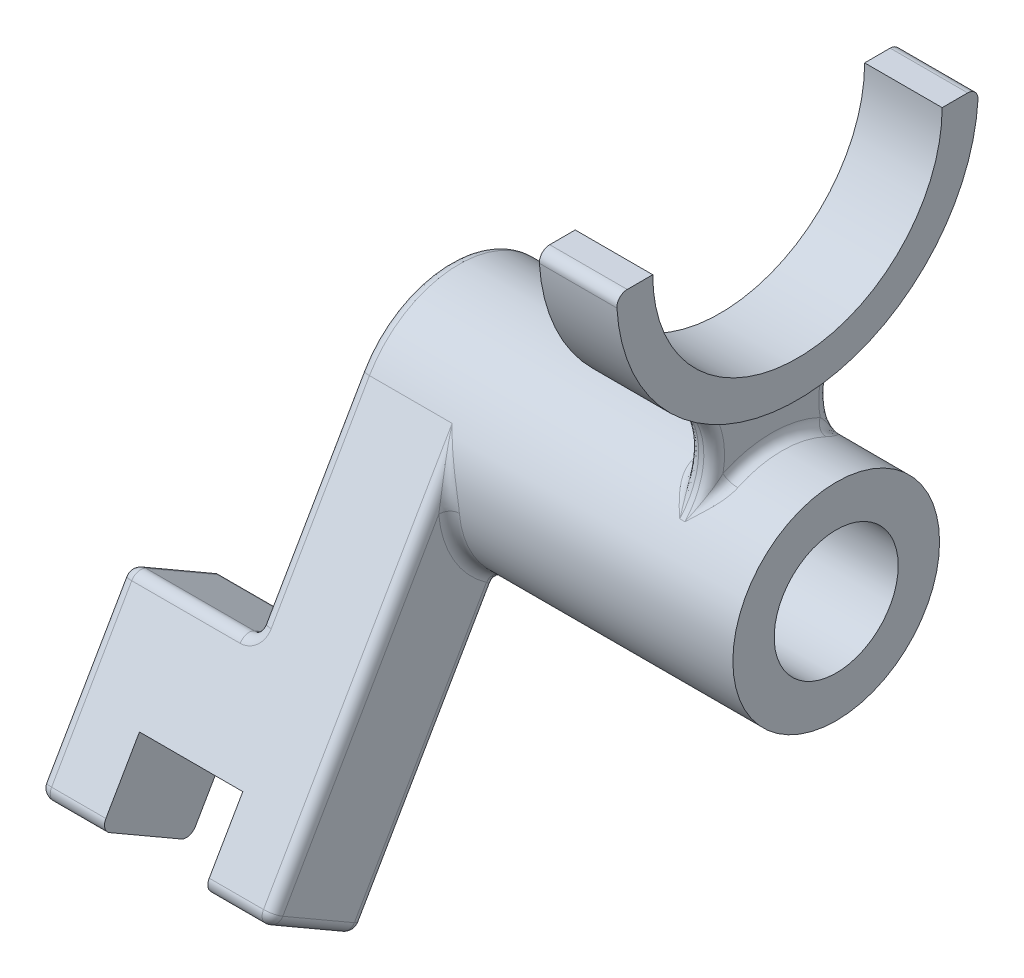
ISO-10303-21;
HEADER;
FILE_DESCRIPTION(('STEP AP214'),'2;1');
FILE_NAME('part.step','',(''),(''),'','','');
FILE_SCHEMA(('AUTOMOTIVE_DESIGN { 1 0 10303 214 1 1 1 1 }'));
ENDSEC;
DATA;
#1=APPLICATION_CONTEXT('core data for automotive mechanical design processes');
#2=APPLICATION_PROTOCOL_DEFINITION('international standard','automotive_design',2000,#1);
#3=PRODUCT_CONTEXT('',#1,'mechanical');
#4=PRODUCT('Part','Part','',(#3));
#5=PRODUCT_RELATED_PRODUCT_CATEGORY('part','',(#4));
#6=PRODUCT_DEFINITION_FORMATION('','',#4);
#7=PRODUCT_DEFINITION_CONTEXT('part definition',#1,'design');
#8=PRODUCT_DEFINITION('design','',#6,#7);
#9=PRODUCT_DEFINITION_SHAPE('','',#8);
#10=(LENGTH_UNIT() NAMED_UNIT(*) SI_UNIT(.MILLI.,.METRE.));
#11=(NAMED_UNIT(*) PLANE_ANGLE_UNIT() SI_UNIT($,.RADIAN.));
#12=(NAMED_UNIT(*) SI_UNIT($,.STERADIAN.) SOLID_ANGLE_UNIT());
#13=UNCERTAINTY_MEASURE_WITH_UNIT(LENGTH_MEASURE(1.E-05),#10,'distance_accuracy_value','');
#14=(GEOMETRIC_REPRESENTATION_CONTEXT(3) GLOBAL_UNCERTAINTY_ASSIGNED_CONTEXT((#13)) GLOBAL_UNIT_ASSIGNED_CONTEXT((#10,
#11,#12)) REPRESENTATION_CONTEXT('',''));
#15=CARTESIAN_POINT('',(0.,0.,0.));
#16=DIRECTION('',(0.,0.,1.));
#17=DIRECTION('',(1.,0.,0.));
#18=AXIS2_PLACEMENT_3D('',#15,#16,#17);
#19=CARTESIAN_POINT('',(-45.,-64.9519052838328,37.5));
#20=DIRECTION('',(0.,0.866025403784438,-0.5));
#21=DIRECTION('',(0.,0.5,0.866025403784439));
#22=AXIS2_PLACEMENT_3D('',#19,#20,#21);
#23=PLANE('',#22);
#24=DIRECTION('',(0.,0.5,0.866025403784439));
#25=VECTOR('',#24,1.);
#26=CARTESIAN_POINT('',(-43.,-64.9519052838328,37.5));
#27=LINE('',#26,#25);
#28=CARTESIAN_POINT('',(-43.,-55.9519052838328,53.0884572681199));
#29=VERTEX_POINT('',#28);
#30=CARTESIAN_POINT('',(-43.,-63.9519052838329,39.2320508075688));
#31=VERTEX_POINT('',#30);
#32=EDGE_CURVE('E987',#29,#31,#27,.F.);
#33=ORIENTED_EDGE('',*,*,#32,.T.);
#34=DIRECTION('',(1.,0.,0.));
#35=VECTOR('',#34,1.);
#36=CARTESIAN_POINT('',(-45.,-63.9519052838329,39.2320508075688));
#37=LINE('',#36,#35);
#38=CARTESIAN_POINT('',(-32.5,-63.9519052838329,39.2320508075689));
#39=VERTEX_POINT('',#38);
#40=EDGE_CURVE('E989',#31,#39,#37,.T.);
#41=ORIENTED_EDGE('',*,*,#40,.T.);
#42=DIRECTION('',(0.,0.500000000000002,0.866025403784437));
#43=VECTOR('',#42,1.);
#44=CARTESIAN_POINT('',(-32.5,-81.1905646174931,9.37381698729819));
#45=LINE('',#44,#43);
#46=CARTESIAN_POINT('',(-32.5,-55.9519052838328,53.0884572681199));
#47=VERTEX_POINT('',#46);
#48=EDGE_CURVE('E563',#39,#47,#45,.T.);
#49=ORIENTED_EDGE('',*,*,#48,.T.);
#50=DIRECTION('',(1.,0.,0.));
#51=VECTOR('',#50,1.);
#52=CARTESIAN_POINT('',(-45.,-55.9519052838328,53.0884572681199));
#53=LINE('',#52,#51);
#54=EDGE_CURVE('E985',#47,#29,#53,.F.);
#55=ORIENTED_EDGE('',*,*,#54,.T.);
#56=EDGE_LOOP('',(#33,#41,#49,#55));
#57=FACE_BOUND('',#56,.T.);
#58=ADVANCED_FACE('F223',(#57),#23,.F.);
#59=CARTESIAN_POINT('',(-45.,0.,0.));
#60=DIRECTION('',(0.,0.5,0.866025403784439));
#61=DIRECTION('',(0.,-0.866025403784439,0.5));
#62=AXIS2_PLACEMENT_3D('',#59,#60,#61);
#63=PLANE('',#62);
#64=DIRECTION('',(0.,0.866025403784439,-0.5));
#65=VECTOR('',#64,1.);
#66=CARTESIAN_POINT('',(-32.5,-64.951905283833,37.5));
#67=LINE('',#66,#65);
#68=CARTESIAN_POINT('',(-32.5,-63.219854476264,36.5));
#69=VERTEX_POINT('',#68);
#70=CARTESIAN_POINT('',(-32.5,-51.9615242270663,30.));
#71=VERTEX_POINT('',#70);
#72=EDGE_CURVE('E552',#69,#71,#67,.T.);
#73=ORIENTED_EDGE('',*,*,#72,.F.);
#74=DIRECTION('',(1.,0.,0.));
#75=VECTOR('',#74,1.);
#76=CARTESIAN_POINT('',(-45.,-63.219854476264,36.5));
#77=LINE('',#76,#75);
#78=CARTESIAN_POINT('',(-45.,-63.219854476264,36.5));
#79=VERTEX_POINT('',#78);
#80=EDGE_CURVE('E1203',#69,#79,#77,.F.);
#81=ORIENTED_EDGE('',*,*,#80,.T.);
#82=DIRECTION('',(0.,-0.866025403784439,0.5));
#83=VECTOR('',#82,1.);
#84=CARTESIAN_POINT('',(-45.,0.,0.));
#85=LINE('',#84,#83);
#86=CARTESIAN_POINT('',(-45.,-36.3730669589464,21.));
#87=VERTEX_POINT('',#86);
#88=EDGE_CURVE('E576',#87,#79,#85,.T.);
#89=ORIENTED_EDGE('',*,*,#88,.F.);
#90=DIRECTION('',(-1.,0.,0.));
#91=VECTOR('',#90,1.);
#92=CARTESIAN_POINT('',(-45.,-36.3730669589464,21.));
#93=LINE('',#92,#91);
#94=CARTESIAN_POINT('',(-22.,-36.3730669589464,21.));
#95=VERTEX_POINT('',#94);
#96=EDGE_CURVE('E1201',#87,#95,#93,.F.);
#97=ORIENTED_EDGE('',*,*,#96,.T.);
#98=CARTESIAN_POINT('',(-22.,-32.9089653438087,19.));
#99=DIRECTION('',(0.,0.5,0.866025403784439));
#100=DIRECTION('',(0.,-0.866025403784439,0.5));
#101=AXIS2_PLACEMENT_3D('',#98,#99,#100);
#102=CIRCLE('',#101,4.);
#103=CARTESIAN_POINT('',(-18.,-32.9089653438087,19.));
#104=VERTEX_POINT('',#103);
#105=EDGE_CURVE('E1209',#104,#95,#102,.F.);
#106=ORIENTED_EDGE('',*,*,#105,.F.);
#107=DIRECTION('',(0.,-0.866025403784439,0.5));
#108=VECTOR('',#107,1.);
#109=CARTESIAN_POINT('',(-18.,0.,0.));
#110=LINE('',#109,#108);
#111=CARTESIAN_POINT('',(-18.,-18.9736659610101,10.9544511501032));
#112=VERTEX_POINT('',#111);
#113=EDGE_CURVE('E1683',#104,#112,#110,.F.);
#114=ORIENTED_EDGE('',*,*,#113,.T.);
#115=DIRECTION('',(-1.,0.,0.));
#116=VECTOR('',#115,1.);
#117=CARTESIAN_POINT('',(-45.,-18.9736659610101,10.9544511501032));
#118=LINE('',#117,#116);
#119=CARTESIAN_POINT('',(-2.,-18.9736659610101,10.9544511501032));
#120=VERTEX_POINT('',#119);
#121=EDGE_CURVE('E1681',#112,#120,#118,.F.);
#122=ORIENTED_EDGE('',*,*,#121,.T.);
#123=DIRECTION('',(0.,-0.866025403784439,0.5));
#124=VECTOR('',#123,1.);
#125=CARTESIAN_POINT('',(-2.,-64.9519052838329,37.5));
#126=LINE('',#125,#124);
#127=CARTESIAN_POINT('',(-2.,-63.219854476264,36.5));
#128=VERTEX_POINT('',#127);
#129=EDGE_CURVE('E1676',#120,#128,#126,.T.);
#130=ORIENTED_EDGE('',*,*,#129,.T.);
#131=DIRECTION('',(1.,0.,0.));
#132=VECTOR('',#131,1.);
#133=CARTESIAN_POINT('',(-45.,-63.219854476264,36.5));
#134=LINE('',#133,#132);
#135=CARTESIAN_POINT('',(-12.5,-63.219854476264,36.5));
#136=VERTEX_POINT('',#135);
#137=EDGE_CURVE('E1649',#128,#136,#134,.F.);
#138=ORIENTED_EDGE('',*,*,#137,.T.);
#139=DIRECTION('',(0.,-0.866025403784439,0.5));
#140=VECTOR('',#139,1.);
#141=CARTESIAN_POINT('',(-12.5,-64.951905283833,37.5));
#142=LINE('',#141,#140);
#143=CARTESIAN_POINT('',(-12.5,-51.9615242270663,30.));
#144=VERTEX_POINT('',#143);
#145=EDGE_CURVE('E566',#144,#136,#142,.T.);
#146=ORIENTED_EDGE('',*,*,#145,.F.);
#147=DIRECTION('',(1.,0.,0.));
#148=VECTOR('',#147,1.);
#149=CARTESIAN_POINT('',(-12.5,-51.9615242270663,30.));
#150=LINE('',#149,#148);
#151=EDGE_CURVE('E549',#71,#144,#150,.T.);
#152=ORIENTED_EDGE('',*,*,#151,.F.);
#153=EDGE_LOOP('',(#73,#81,#89,#97,#106,#114,#122,#130,#138,#146,#152));
#154=FACE_BOUND('',#153,.T.);
#155=ADVANCED_FACE('F616',(#154),#63,.F.);
#156=DIRECTION('',(0.,0.500000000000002,0.866025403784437));
#157=VECTOR('',#156,1.);
#158=CARTESIAN_POINT('',(-12.5,-81.1905646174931,9.37381698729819));
#159=LINE('',#158,#157);
#160=CARTESIAN_POINT('',(-12.5,-63.9519052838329,39.2320508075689));
#161=VERTEX_POINT('',#160);
#162=CARTESIAN_POINT('',(-12.5,-55.9519052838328,53.0884572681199));
#163=VERTEX_POINT('',#162);
#164=EDGE_CURVE('E562',#161,#163,#159,.T.);
#165=ORIENTED_EDGE('',*,*,#164,.F.);
#166=DIRECTION('',(1.,0.,0.));
#167=VECTOR('',#166,1.);
#168=CARTESIAN_POINT('',(-45.,-63.9519052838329,39.2320508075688));
#169=LINE('',#168,#167);
#170=CARTESIAN_POINT('',(-2.,-63.9519052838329,39.2320508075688));
#171=VERTEX_POINT('',#170);
#172=EDGE_CURVE('E964',#161,#171,#169,.T.);
#173=ORIENTED_EDGE('',*,*,#172,.T.);
#174=DIRECTION('',(0.,0.5,0.866025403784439));
#175=VECTOR('',#174,1.);
#176=CARTESIAN_POINT('',(-2.,-54.9519052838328,54.8205080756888));
#177=LINE('',#176,#175);
#178=CARTESIAN_POINT('',(-2.,-55.9519052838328,53.0884572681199));
#179=VERTEX_POINT('',#178);
#180=EDGE_CURVE('E980',#171,#179,#177,.T.);
#181=ORIENTED_EDGE('',*,*,#180,.T.);
#182=DIRECTION('',(1.,0.,0.));
#183=VECTOR('',#182,1.);
#184=CARTESIAN_POINT('',(-45.,-55.9519052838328,53.0884572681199));
#185=LINE('',#184,#183);
#186=EDGE_CURVE('E967',#179,#163,#185,.F.);
#187=ORIENTED_EDGE('',*,*,#186,.T.);
#188=EDGE_LOOP('',(#165,#173,#181,#187));
#189=FACE_BOUND('',#188,.T.);
#190=ADVANCED_FACE('F948',(#189),#23,.F.);
#191=CARTESIAN_POINT('',(-45.,-54.9519052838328,54.8205080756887));
#192=DIRECTION('',(0.,-0.500000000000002,-0.866025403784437));
#193=DIRECTION('',(0.,0.866025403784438,-0.500000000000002));
#194=AXIS2_PLACEMENT_3D('',#191,#192,#193);
#195=PLANE('',#194);
#196=DIRECTION('',(0.,0.866025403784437,-0.500000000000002));
#197=VECTOR('',#196,1.);
#198=CARTESIAN_POINT('',(-12.5,-54.9519052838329,54.8205080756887));
#199=LINE('',#198,#197);
#200=CARTESIAN_POINT('',(-12.5,-53.219854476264,53.8205080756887));
#201=VERTEX_POINT('',#200);
#202=CARTESIAN_POINT('',(-12.5,-41.9615242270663,47.3205080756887));
#203=VERTEX_POINT('',#202);
#204=EDGE_CURVE('E554',#201,#203,#199,.T.);
#205=ORIENTED_EDGE('',*,*,#204,.F.);
#206=DIRECTION('',(1.,0.,0.));
#207=VECTOR('',#206,1.);
#208=CARTESIAN_POINT('',(-45.,-53.219854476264,53.8205080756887));
#209=LINE('',#208,#207);
#210=CARTESIAN_POINT('',(-2.,-53.219854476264,53.8205080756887));
#211=VERTEX_POINT('',#210);
#212=EDGE_CURVE('E1223',#201,#211,#209,.T.);
#213=ORIENTED_EDGE('',*,*,#212,.T.);
#214=DIRECTION('',(0.,0.866025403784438,-0.500000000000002));
#215=VECTOR('',#214,1.);
#216=CARTESIAN_POINT('',(-2.,9.99999999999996,17.3205080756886));
#217=LINE('',#216,#215);
#218=CARTESIAN_POINT('',(-2.00000000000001,9.99999999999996,17.3205080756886));
#219=VERTEX_POINT('',#218);
#220=EDGE_CURVE('E1221',#211,#219,#217,.T.);
#221=ORIENTED_EDGE('',*,*,#220,.T.);
#222=DIRECTION('',(1.,0.,0.));
#223=VECTOR('',#222,1.);
#224=CARTESIAN_POINT('',(-45.,9.99999999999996,17.3205080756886));
#225=LINE('',#224,#223);
#226=CARTESIAN_POINT('',(-18.,9.99999999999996,17.3205080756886));
#227=VERTEX_POINT('',#226);
#228=EDGE_CURVE('E579',#227,#219,#225,.T.);
#229=ORIENTED_EDGE('',*,*,#228,.F.);
#230=DIRECTION('',(0.,0.866025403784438,-0.500000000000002));
#231=VECTOR('',#230,1.);
#232=CARTESIAN_POINT('',(-18.,-54.9519052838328,54.8205080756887));
#233=LINE('',#232,#231);
#234=CARTESIAN_POINT('',(-18.,-22.9089653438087,36.3205080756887));
#235=VERTEX_POINT('',#234);
#236=EDGE_CURVE('E1219',#227,#235,#233,.F.);
#237=ORIENTED_EDGE('',*,*,#236,.T.);
#238=CARTESIAN_POINT('',(-22.,-22.9089653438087,36.3205080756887));
#239=DIRECTION('',(0.,-0.500000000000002,-0.866025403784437));
#240=DIRECTION('',(0.,0.866025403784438,-0.500000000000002));
#241=AXIS2_PLACEMENT_3D('',#238,#239,#240);
#242=CIRCLE('',#241,4.);
#243=CARTESIAN_POINT('',(-22.,-26.3730669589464,38.3205080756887));
#244=VERTEX_POINT('',#243);
#245=EDGE_CURVE('E1216',#244,#235,#242,.F.);
#246=ORIENTED_EDGE('',*,*,#245,.F.);
#247=DIRECTION('',(1.,0.,0.));
#248=VECTOR('',#247,1.);
#249=CARTESIAN_POINT('',(-45.,-26.3730669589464,38.3205080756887));
#250=LINE('',#249,#248);
#251=CARTESIAN_POINT('',(-43.,-26.3730669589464,38.3205080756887));
#252=VERTEX_POINT('',#251);
#253=EDGE_CURVE('E1185',#244,#252,#250,.F.);
#254=ORIENTED_EDGE('',*,*,#253,.T.);
#255=DIRECTION('',(0.,0.866025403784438,-0.500000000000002));
#256=VECTOR('',#255,1.);
#257=CARTESIAN_POINT('',(-43.,-54.9519052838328,54.8205080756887));
#258=LINE('',#257,#256);
#259=CARTESIAN_POINT('',(-43.,-53.219854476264,53.8205080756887));
#260=VERTEX_POINT('',#259);
#261=EDGE_CURVE('E1207',#252,#260,#258,.F.);
#262=ORIENTED_EDGE('',*,*,#261,.T.);
#263=DIRECTION('',(1.,0.,0.));
#264=VECTOR('',#263,1.);
#265=CARTESIAN_POINT('',(-45.,-53.219854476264,53.8205080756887));
#266=LINE('',#265,#264);
#267=CARTESIAN_POINT('',(-32.5,-53.219854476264,53.8205080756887));
#268=VERTEX_POINT('',#267);
#269=EDGE_CURVE('E1214',#260,#268,#266,.T.);
#270=ORIENTED_EDGE('',*,*,#269,.T.);
#271=DIRECTION('',(0.,-0.866025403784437,0.500000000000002));
#272=VECTOR('',#271,1.);
#273=CARTESIAN_POINT('',(-32.5,-54.9519052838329,54.8205080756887));
#274=LINE('',#273,#272);
#275=CARTESIAN_POINT('',(-32.5,-41.9615242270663,47.3205080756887));
#276=VERTEX_POINT('',#275);
#277=EDGE_CURVE('E559',#276,#268,#274,.T.);
#278=ORIENTED_EDGE('',*,*,#277,.F.);
#279=DIRECTION('',(-1.,0.,0.));
#280=VECTOR('',#279,1.);
#281=CARTESIAN_POINT('',(-12.5,-41.9615242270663,47.3205080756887));
#282=LINE('',#281,#280);
#283=EDGE_CURVE('E556',#203,#276,#282,.T.);
#284=ORIENTED_EDGE('',*,*,#283,.F.);
#285=EDGE_LOOP('',(#205,#213,#221,#229,#237,#246,#254,#262,#270,#278,#284));
#286=FACE_BOUND('',#285,.T.);
#287=ADVANCED_FACE('F955',(#286),#195,.F.);
#288=CARTESIAN_POINT('',(-45.,9.99999999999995,17.3205080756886));
#289=DIRECTION('',(1.,0.,0.));
#290=DIRECTION('',(0.,0.,-1.));
#291=AXIS2_PLACEMENT_3D('',#288,#289,#290);
#292=PLANE('',#291);
#293=DIRECTION('',(0.,0.866025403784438,-0.500000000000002));
#294=VECTOR('',#293,1.);
#295=CARTESIAN_POINT('',(-45.,8.99999999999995,15.5884572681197));
#296=LINE('',#295,#294);
#297=CARTESIAN_POINT('',(-45.,-54.219854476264,52.0884572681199));
#298=VERTEX_POINT('',#297);
#299=CARTESIAN_POINT('',(-45.,-27.3730669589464,36.5884572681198));
#300=VERTEX_POINT('',#299);
#301=EDGE_CURVE('E1004',#298,#300,#296,.T.);
#302=ORIENTED_EDGE('',*,*,#301,.T.);
#303=DIRECTION('',(0.,0.500000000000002,0.866025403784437));
#304=VECTOR('',#303,1.);
#305=CARTESIAN_POINT('',(-45.,-26.3730669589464,38.3205080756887));
#306=LINE('',#305,#304);
#307=EDGE_CURVE('E1008',#300,#87,#306,.F.);
#308=ORIENTED_EDGE('',*,*,#307,.T.);
#309=ORIENTED_EDGE('',*,*,#88,.T.);
#310=DIRECTION('',(0.,0.5,0.866025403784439));
#311=VECTOR('',#310,1.);
#312=CARTESIAN_POINT('',(-45.,-53.219854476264,53.8205080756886));
#313=LINE('',#312,#311);
#314=EDGE_CURVE('E1006',#79,#298,#313,.T.);
#315=ORIENTED_EDGE('',*,*,#314,.T.);
#316=EDGE_LOOP('',(#302,#308,#309,#315));
#317=FACE_BOUND('',#316,.T.);
#318=ADVANCED_FACE('F960',(#317),#292,.F.);
#319=CARTESIAN_POINT('',(0.,9.99999999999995,17.3205080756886));
#320=DIRECTION('',(1.,0.,0.));
#321=DIRECTION('',(0.,0.,-1.));
#322=AXIS2_PLACEMENT_3D('',#319,#320,#321);
#323=PLANE('',#322);
#324=DIRECTION('',(0.,0.866025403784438,-0.500000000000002));
#325=VECTOR('',#324,1.);
#326=CARTESIAN_POINT('',(0.,-55.9519052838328,53.0884572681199));
#327=LINE('',#326,#325);
#328=CARTESIAN_POINT('',(0.,-1.95445115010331,21.9130125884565));
#329=VERTEX_POINT('',#328);
#330=CARTESIAN_POINT('',(0.,-54.219854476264,52.0884572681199));
#331=VERTEX_POINT('',#330);
#332=EDGE_CURVE('E1010',#329,#331,#327,.F.);
#333=ORIENTED_EDGE('',*,*,#332,.T.);
#334=DIRECTION('',(0.,0.5,0.866025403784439));
#335=VECTOR('',#334,1.);
#336=CARTESIAN_POINT('',(0.,-63.219854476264,36.5));
#337=LINE('',#336,#335);
#338=CARTESIAN_POINT('',(0.,-62.219854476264,38.2320508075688));
#339=VERTEX_POINT('',#338);
#340=EDGE_CURVE('E1016',#331,#339,#337,.F.);
#341=ORIENTED_EDGE('',*,*,#340,.T.);
#342=DIRECTION('',(0.,-0.866025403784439,0.5));
#343=VECTOR('',#342,1.);
#344=CARTESIAN_POINT('',(0.,-16.3205080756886,11.7320508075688));
#345=LINE('',#344,#343);
#346=CARTESIAN_POINT('',(0.,-17.9736659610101,12.6865019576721));
#347=VERTEX_POINT('',#346);
#348=EDGE_CURVE('E1014',#339,#347,#345,.F.);
#349=ORIENTED_EDGE('',*,*,#348,.T.);
#350=CARTESIAN_POINT('',(0.,0.,0.));
#351=DIRECTION('',(1.,0.,0.));
#352=DIRECTION('',(0.,0.,-1.));
#353=AXIS2_PLACEMENT_3D('',#350,#351,#352);
#354=CIRCLE('',#353,21.9999999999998);
#355=EDGE_CURVE('E1012',#347,#329,#354,.F.);
#356=ORIENTED_EDGE('',*,*,#355,.T.);
#357=EDGE_LOOP('',(#333,#341,#349,#356));
#358=FACE_BOUND('',#357,.T.);
#359=ADVANCED_FACE('F1581',(#358),#323,.T.);
#360=CARTESIAN_POINT('',(-20.,-16.2386593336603,-28.126183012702));
#361=DIRECTION('',(1.,0.,0.));
#362=DIRECTION('',(0.,1.,0.));
#363=AXIS2_PLACEMENT_3D('',#360,#361,#362);
#364=PLANE('',#363);
#365=DIRECTION('',(0.,0.866025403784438,-0.500000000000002));
#366=VECTOR('',#365,1.);
#367=CARTESIAN_POINT('',(-20.,8.99999999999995,15.5884572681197));
#368=LINE('',#367,#366);
#369=CARTESIAN_POINT('',(-20.,-23.9089653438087,34.5884572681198));
#370=VERTEX_POINT('',#369);
#371=CARTESIAN_POINT('',(-20.,8.99999999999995,15.5884572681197));
#372=VERTEX_POINT('',#371);
#373=EDGE_CURVE('E584',#370,#372,#368,.T.);
#374=ORIENTED_EDGE('',*,*,#373,.T.);
#375=CARTESIAN_POINT('',(-20.,0.,0.));
#376=DIRECTION('',(1.,0.,0.));
#377=DIRECTION('',(0.,1.,0.));
#378=AXIS2_PLACEMENT_3D('',#375,#376,#377);
#379=CIRCLE('',#378,17.9999999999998);
#380=CARTESIAN_POINT('',(-20.,-16.3420903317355,7.54560028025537));
#381=VERTEX_POINT('',#380);
#382=EDGE_CURVE('E591',#372,#381,#379,.F.);
#383=ORIENTED_EDGE('',*,*,#382,.T.);
#384=CARTESIAN_POINT('',(-20.,-19.9736659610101,9.22240034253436));
#385=DIRECTION('',(1.,0.,0.));
#386=DIRECTION('',(0.,1.,0.));
#387=AXIS2_PLACEMENT_3D('',#384,#385,#386);
#388=CIRCLE('',#387,4.);
#389=CARTESIAN_POINT('',(-20.,-17.9736659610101,12.6865019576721));
#390=VERTEX_POINT('',#389);
#391=EDGE_CURVE('E588',#390,#381,#388,.F.);
#392=ORIENTED_EDGE('',*,*,#391,.F.);
#393=DIRECTION('',(0.,-0.866025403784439,0.5));
#394=VECTOR('',#393,1.);
#395=CARTESIAN_POINT('',(-20.,0.999999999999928,1.73205080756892));
#396=LINE('',#395,#394);
#397=CARTESIAN_POINT('',(-20.,-31.9089653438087,20.7320508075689));
#398=VERTEX_POINT('',#397);
#399=EDGE_CURVE('E586',#390,#398,#396,.T.);
#400=ORIENTED_EDGE('',*,*,#399,.T.);
#401=DIRECTION('',(0.,0.500000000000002,0.866025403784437));
#402=VECTOR('',#401,1.);
#403=CARTESIAN_POINT('',(-20.,-22.9089653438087,36.3205080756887));
#404=LINE('',#403,#402);
#405=EDGE_CURVE('E582',#398,#370,#404,.T.);
#406=ORIENTED_EDGE('',*,*,#405,.T.);
#407=EDGE_LOOP('',(#374,#383,#392,#400,#406));
#408=FACE_BOUND('',#407,.T.);
#409=CARTESIAN_POINT('',(-20.,0.,0.));
#410=DIRECTION('',(1.,0.,0.));
#411=DIRECTION('',(0.,1.,0.));
#412=AXIS2_PLACEMENT_3D('',#409,#410,#411);
#413=CIRCLE('',#412,11.9999999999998);
#414=CARTESIAN_POINT('',(-20.,11.9999999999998,0.));
#415=VERTEX_POINT('',#414);
#416=EDGE_CURVE('E1255',#415,#415,#413,.F.);
#417=ORIENTED_EDGE('',*,*,#416,.F.);
#418=EDGE_LOOP('',(#417));
#419=FACE_BOUND('',#418,.T.);
#420=ADVANCED_FACE('F1572',(#408,#419),#364,.F.);
#421=CARTESIAN_POINT('',(-20.,-50.8796754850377,-8.12618301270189));
#422=DIRECTION('',(0.,-0.866025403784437,0.500000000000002));
#423=DIRECTION('',(0.,-0.500000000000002,-0.866025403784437));
#424=AXIS2_PLACEMENT_3D('',#421,#422,#423);
#425=PLANE('',#424);
#426=DIRECTION('',(1.,0.,0.));
#427=VECTOR('',#426,1.);
#428=CARTESIAN_POINT('',(-20.,-25.6410161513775,35.5884572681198));
#429=LINE('',#428,#427);
#430=CARTESIAN_POINT('',(-43.,-25.6410161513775,35.5884572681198));
#431=VERTEX_POINT('',#430);
#432=CARTESIAN_POINT('',(-22.,-25.6410161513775,35.5884572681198));
#433=VERTEX_POINT('',#432);
#434=EDGE_CURVE('E995',#431,#433,#429,.T.);
#435=ORIENTED_EDGE('',*,*,#434,.T.);
#436=DIRECTION('',(0.,0.500000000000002,0.866025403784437));
#437=VECTOR('',#436,1.);
#438=CARTESIAN_POINT('',(-22.,-34.6410161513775,20.));
#439=LINE('',#438,#437);
#440=CARTESIAN_POINT('',(-22.,-33.6410161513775,21.7320508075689));
#441=VERTEX_POINT('',#440);
#442=EDGE_CURVE('E1001',#433,#441,#439,.F.);
#443=ORIENTED_EDGE('',*,*,#442,.T.);
#444=DIRECTION('',(-1.,0.,0.));
#445=VECTOR('',#444,1.);
#446=CARTESIAN_POINT('',(-20.,-33.6410161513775,21.7320508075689));
#447=LINE('',#446,#445);
#448=CARTESIAN_POINT('',(-43.,-33.6410161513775,21.7320508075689));
#449=VERTEX_POINT('',#448);
#450=EDGE_CURVE('E999',#441,#449,#447,.T.);
#451=ORIENTED_EDGE('',*,*,#450,.T.);
#452=DIRECTION('',(0.,0.500000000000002,0.866025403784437));
#453=VECTOR('',#452,1.);
#454=CARTESIAN_POINT('',(-43.,-50.8796754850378,-8.12618301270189));
#455=LINE('',#454,#453);
#456=EDGE_CURVE('E997',#449,#431,#455,.T.);
#457=ORIENTED_EDGE('',*,*,#456,.T.);
#458=EDGE_LOOP('',(#435,#443,#451,#457));
#459=FACE_BOUND('',#458,.T.);
#460=ADVANCED_FACE('F1188',(#459),#425,.F.);
#461=CARTESIAN_POINT('',(-32.5,-81.1905646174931,9.37381698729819));
#462=DIRECTION('',(-1.,0.,0.));
#463=DIRECTION('',(0.,0.,1.));
#464=AXIS2_PLACEMENT_3D('',#461,#462,#463);
#465=PLANE('',#464);
#466=ORIENTED_EDGE('',*,*,#48,.F.);
#467=CARTESIAN_POINT('',(-32.5,-62.219854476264,38.2320508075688));
#468=DIRECTION('',(-1.,0.,0.));
#469=DIRECTION('',(0.,0.,1.));
#470=AXIS2_PLACEMENT_3D('',#467,#468,#469);
#471=CIRCLE('',#470,2.);
#472=EDGE_CURVE('E993',#39,#69,#471,.F.);
#473=ORIENTED_EDGE('',*,*,#472,.T.);
#474=ORIENTED_EDGE('',*,*,#72,.T.);
#475=DIRECTION('',(0.,0.500000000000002,0.866025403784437));
#476=VECTOR('',#475,1.);
#477=CARTESIAN_POINT('',(-32.5,-68.2001835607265,1.87381698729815));
#478=LINE('',#477,#476);
#479=EDGE_CURVE('E567',#71,#276,#478,.T.);
#480=ORIENTED_EDGE('',*,*,#479,.T.);
#481=ORIENTED_EDGE('',*,*,#277,.T.);
#482=CARTESIAN_POINT('',(-32.5,-54.219854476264,52.0884572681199));
#483=DIRECTION('',(-1.,0.,0.));
#484=DIRECTION('',(0.,0.,1.));
#485=AXIS2_PLACEMENT_3D('',#482,#483,#484);
#486=CIRCLE('',#485,2.);
#487=EDGE_CURVE('E991',#268,#47,#486,.F.);
#488=ORIENTED_EDGE('',*,*,#487,.T.);
#489=EDGE_LOOP('',(#466,#473,#474,#480,#481,#488));
#490=FACE_BOUND('',#489,.T.);
#491=ADVANCED_FACE('F1558',(#490),#465,.F.);
#492=CARTESIAN_POINT('',(-12.5,-68.2001835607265,1.87381698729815));
#493=DIRECTION('',(0.,0.866025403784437,-0.500000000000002));
#494=DIRECTION('',(0.,0.500000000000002,0.866025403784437));
#495=AXIS2_PLACEMENT_3D('',#492,#493,#494);
#496=PLANE('',#495);
#497=ORIENTED_EDGE('',*,*,#151,.T.);
#498=DIRECTION('',(0.,0.500000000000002,0.866025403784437));
#499=VECTOR('',#498,1.);
#500=CARTESIAN_POINT('',(-12.5,-68.2001835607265,1.87381698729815));
#501=LINE('',#500,#499);
#502=EDGE_CURVE('E569',#144,#203,#501,.T.);
#503=ORIENTED_EDGE('',*,*,#502,.T.);
#504=ORIENTED_EDGE('',*,*,#283,.T.);
#505=ORIENTED_EDGE('',*,*,#479,.F.);
#506=EDGE_LOOP('',(#497,#503,#504,#505));
#507=FACE_BOUND('',#506,.T.);
#508=ADVANCED_FACE('F1551',(#507),#496,.F.);
#509=CARTESIAN_POINT('',(-12.5,-81.1905646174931,9.37381698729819));
#510=DIRECTION('',(1.,0.,0.));
#511=DIRECTION('',(0.,0.,-1.));
#512=AXIS2_PLACEMENT_3D('',#509,#510,#511);
#513=PLANE('',#512);
#514=ORIENTED_EDGE('',*,*,#145,.T.);
#515=CARTESIAN_POINT('',(-12.5,-62.219854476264,38.2320508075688));
#516=DIRECTION('',(1.,0.,0.));
#517=DIRECTION('',(0.,0.,-1.));
#518=AXIS2_PLACEMENT_3D('',#515,#516,#517);
#519=CIRCLE('',#518,2.);
#520=EDGE_CURVE('E973',#136,#161,#519,.F.);
#521=ORIENTED_EDGE('',*,*,#520,.T.);
#522=ORIENTED_EDGE('',*,*,#164,.T.);
#523=CARTESIAN_POINT('',(-12.5,-54.219854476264,52.0884572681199));
#524=DIRECTION('',(1.,0.,0.));
#525=DIRECTION('',(0.,0.,-1.));
#526=AXIS2_PLACEMENT_3D('',#523,#524,#525);
#527=CIRCLE('',#526,2.);
#528=EDGE_CURVE('E977',#163,#201,#527,.F.);
#529=ORIENTED_EDGE('',*,*,#528,.T.);
#530=ORIENTED_EDGE('',*,*,#204,.T.);
#531=ORIENTED_EDGE('',*,*,#502,.F.);
#532=EDGE_LOOP('',(#514,#521,#522,#529,#530,#531));
#533=FACE_BOUND('',#532,.T.);
#534=ADVANCED_FACE('F1541',(#533),#513,.F.);
#535=CARTESIAN_POINT('',(-20.,0.,0.));
#536=DIRECTION('',(-1.,0.,0.));
#537=DIRECTION('',(0.,0.,1.));
#538=AXIS2_PLACEMENT_3D('',#535,#536,#537);
#539=CYLINDRICAL_SURFACE('',#538,19.9999999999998);
#540=CARTESIAN_POINT('',(1.77849556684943,-15.6172970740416,12.4939998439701));
#541=CARTESIAN_POINT('',(-0.0217970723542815,-16.0035348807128,12.0112088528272));
#542=CARTESIAN_POINT('',(-0.110752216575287,-17.5071817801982,13.1750186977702));
#543=CARTESIAN_POINT('',(1.81497099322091,-15.6776200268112,12.4186020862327));
#544=CARTESIAN_POINT('',(-0.0121474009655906,-16.0330333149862,11.9695443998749));
#545=CARTESIAN_POINT('',(-0.0925145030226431,-17.5472861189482,13.1375490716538));
#546=CARTESIAN_POINT('',(1.84707948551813,-15.7382130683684,12.3417357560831));
#547=CARTESIAN_POINT('',(-0.00473091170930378,-16.0620724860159,11.928346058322));
#548=CARTESIAN_POINT('',(-0.0764602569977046,-17.5873006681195,13.0991341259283));
#549=CARTESIAN_POINT('',(1.90234757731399,-15.8595131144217,12.1854675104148));
#550=CARTESIAN_POINT('',(0.00610173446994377,-16.1194621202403,11.8467346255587));
#551=CARTESIAN_POINT('',(-0.0488262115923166,-17.6668355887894,13.0205881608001));
#552=CARTESIAN_POINT('',(1.92550654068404,-15.9202201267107,12.106065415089));
#553=CARTESIAN_POINT('',(0.0094952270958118,-16.1477912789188,11.8063508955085));
#554=CARTESIAN_POINT('',(-0.0372467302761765,-17.7063559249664,12.9804570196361));
#555=CARTESIAN_POINT('',(1.98118224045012,-16.1017050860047,11.8648798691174));
#556=CARTESIAN_POINT('',(0.014261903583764,-16.2318767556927,11.686461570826));
#557=CARTESIAN_POINT('',(-0.00940888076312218,-17.8235951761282,12.8578638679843));
#558=CARTESIAN_POINT('',(1.99999204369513,-16.2220032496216,11.6999224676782));
#559=CARTESIAN_POINT('',(0.0101325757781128,-16.2863263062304,11.6087946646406));
#560=CARTESIAN_POINT('',(-3.97840786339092E-06,-17.9000963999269,12.7731055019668));
#561=CARTESIAN_POINT('',(2.00000787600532,-16.4562015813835,11.3681275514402));
#562=CARTESIAN_POINT('',(-0.0100811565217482,-16.3927955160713,11.4579562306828));
#563=CARTESIAN_POINT('',(3.93825550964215E-06,-18.046493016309,12.6007724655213));
#564=CARTESIAN_POINT('',(1.98159150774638,-16.5701540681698,11.2013258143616));
#565=CARTESIAN_POINT('',(-0.0260713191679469,-16.4446495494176,11.3850140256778));
#566=CARTESIAN_POINT('',(-0.00920424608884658,-18.1164472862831,12.5132348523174));
#567=CARTESIAN_POINT('',(1.90822682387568,-16.7899537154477,10.8690889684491));
#568=CARTESIAN_POINT('',(-0.0691540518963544,-16.5474830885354,11.2416166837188));
#569=CARTESIAN_POINT('',(-0.0458865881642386,-18.2488799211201,12.3371688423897));
#570=CARTESIAN_POINT('',(1.85329337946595,-16.8958041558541,10.7036533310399));
#571=CARTESIAN_POINT('',(-0.0961884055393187,-16.5982882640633,11.1714062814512));
#572=CARTESIAN_POINT('',(-0.073353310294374,-18.3113613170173,12.2486408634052));
#573=CARTESIAN_POINT('',(1.70831942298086,-17.0970138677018,10.3792383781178));
#574=CARTESIAN_POINT('',(-0.162303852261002,-16.6993084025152,11.0324019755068));
#575=CARTESIAN_POINT('',(-0.145840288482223,-18.4277639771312,12.0735250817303));
#576=CARTESIAN_POINT('',(1.6182777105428,-17.1923727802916,10.2202592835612));
#577=CARTESIAN_POINT('',(-0.201269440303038,-16.7493741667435,10.9638125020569));
#578=CARTESIAN_POINT('',(-0.190861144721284,-18.4816849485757,11.9869373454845));
#579=CARTESIAN_POINT('',(1.40562010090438,-17.3708707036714,9.91384610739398));
#580=CARTESIAN_POINT('',(-0.293122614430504,-16.8480972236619,10.8281184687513));
#581=CARTESIAN_POINT('',(-0.297189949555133,-18.5805147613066,11.8187888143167));
#582=CARTESIAN_POINT('',(1.28299613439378,-17.4540066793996,9.76641489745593));
#583=CARTESIAN_POINT('',(-0.345855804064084,-16.8966507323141,10.7611582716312));
#584=CARTESIAN_POINT('',(-0.358501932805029,-18.6254213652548,11.7372292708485));
#585=CARTESIAN_POINT('',(1.0082107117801,-17.6071342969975,9.48758192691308));
#586=CARTESIAN_POINT('',(-0.467145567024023,-16.9906559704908,10.6302509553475));
#587=CARTESIAN_POINT('',(-0.495894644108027,-18.7064006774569,11.5820000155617));
#588=CARTESIAN_POINT('',(0.855981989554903,-17.6770952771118,9.35621780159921));
#589=CARTESIAN_POINT('',(-0.535572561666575,-17.0360604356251,10.5663741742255));
#590=CARTESIAN_POINT('',(-0.572009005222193,-18.7424528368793,11.5083488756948));
#591=CARTESIAN_POINT('',(0.609098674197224,-17.7714593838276,9.17496030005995));
#592=CARTESIAN_POINT('',(-0.650415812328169,-17.1000141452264,10.4752666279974));
#593=CARTESIAN_POINT('',(-0.695450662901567,-18.7901105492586,11.4062078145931));
#594=CARTESIAN_POINT('',(0.523694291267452,-17.8011563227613,9.11716209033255));
#595=CARTESIAN_POINT('',(-0.690625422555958,-17.120597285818,10.4457445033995));
#596=CARTESIAN_POINT('',(-0.738152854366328,-18.8049288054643,11.3735440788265));
#597=CARTESIAN_POINT('',(0.34716088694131,-17.8570484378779,9.00719812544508));
#598=CARTESIAN_POINT('',(-0.774972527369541,-17.1600874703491,10.3887410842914));
#599=CARTESIAN_POINT('',(-0.826419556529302,-18.8325362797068,11.3112549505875));
#600=CARTESIAN_POINT('',(0.256026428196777,-17.8832402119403,8.95503785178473));
#601=CARTESIAN_POINT('',(-0.819104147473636,-17.1789996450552,10.3612532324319));
#602=CARTESIAN_POINT('',(-0.871986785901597,-18.8453235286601,11.2816325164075));
#603=CARTESIAN_POINT('',(-0.0265385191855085,-17.9568786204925,8.8069730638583));
#604=CARTESIAN_POINT('',(-0.957668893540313,-17.2329818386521,10.2822935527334));
#605=CARTESIAN_POINT('',(-1.01326925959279,-18.8809378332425,11.1973754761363));
#606=CARTESIAN_POINT('',(-0.225814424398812,-17.9988906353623,8.72045341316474));
#607=CARTESIAN_POINT('',(-1.05807866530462,-17.2651767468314,10.2344976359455));
#608=CARTESIAN_POINT('',(-1.11290721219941,-18.9007691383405,11.1478986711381));
#609=CARTESIAN_POINT('',(-0.639304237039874,-18.0683258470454,8.57567029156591));
#610=CARTESIAN_POINT('',(-1.27104756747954,-17.3194244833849,10.1532104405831));
#611=CARTESIAN_POINT('',(-1.31965211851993,-18.933119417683,11.0648967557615));
#612=CARTESIAN_POINT('',(-0.853517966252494,-18.0957492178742,8.51740648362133));
#613=CARTESIAN_POINT('',(-1.38371013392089,-17.3415698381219,10.1195849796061));
#614=CARTESIAN_POINT('',(-1.42675898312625,-18.9456384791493,11.0313714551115));
#615=CARTESIAN_POINT('',(-1.18140897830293,-18.1259885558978,8.45275460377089));
#616=CARTESIAN_POINT('',(-1.55839769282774,-17.3662086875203,10.0819913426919));
#617=CARTESIAN_POINT('',(-1.59070448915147,-18.9593465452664,10.9941249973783));
#618=CARTESIAN_POINT('',(-1.29191722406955,-18.1342552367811,8.43498813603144));
#619=CARTESIAN_POINT('',(-1.61761146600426,-17.3729984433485,10.0715907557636));
#620=CARTESIAN_POINT('',(-1.64595861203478,-18.9630720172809,10.9838793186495));
#621=CARTESIAN_POINT('',(-1.51425338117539,-18.1471489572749,8.40721212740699));
#622=CARTESIAN_POINT('',(-1.73719352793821,-17.3836233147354,10.0552866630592));
#623=CARTESIAN_POINT('',(-1.7571266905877,-18.9688671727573,10.9678540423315));
#624=CARTESIAN_POINT('',(-1.62607994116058,-18.1517794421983,8.39719524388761));
#625=CARTESIAN_POINT('',(-1.79759291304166,-17.3874672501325,10.0493696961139));
#626=CARTESIAN_POINT('',(-1.81303997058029,-18.9709384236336,10.9620702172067));
#627=CARTESIAN_POINT('',(-1.96260599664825,-18.1602295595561,8.37892372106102));
#628=CARTESIAN_POINT('',(-1.97958838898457,-17.3944679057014,10.0385976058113));
#629=CARTESIAN_POINT('',(-1.98130299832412,-18.9747201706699,10.951520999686));
#630=CARTESIAN_POINT('',(-2.18839819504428,-18.1586120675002,8.38243909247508));
#631=CARTESIAN_POINT('',(-2.10230410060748,-17.3931140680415,10.0406895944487));
#632=CARTESIAN_POINT('',(-2.09419909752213,-18.9740005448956,10.953552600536));
#633=CARTESIAN_POINT('',(-2.63507163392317,-18.140866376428,8.42077086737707));
#634=CARTESIAN_POINT('',(-2.34341531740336,-17.3784292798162,10.0632668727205));
#635=CARTESIAN_POINT('',(-2.31753581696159,-18.9660492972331,10.9756794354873));
#636=CARTESIAN_POINT('',(-2.85596957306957,-18.1247994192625,8.45545516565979));
#637=CARTESIAN_POINT('',(-2.46210321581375,-17.3651145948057,10.0837272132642));
#638=CARTESIAN_POINT('',(-2.4279847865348,-18.9588451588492,10.995698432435));
#639=CARTESIAN_POINT('',(-3.17958650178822,-18.0898901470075,8.52974691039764));
#640=CARTESIAN_POINT('',(-2.63324050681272,-17.3369333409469,10.1265815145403));
#641=CARTESIAN_POINT('',(-2.5897932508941,-18.9429380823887,11.0384601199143));
#642=CARTESIAN_POINT('',(-3.28624936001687,-18.0764377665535,8.55825215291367));
#643=CARTESIAN_POINT('',(-2.68929110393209,-17.3261333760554,10.1429509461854));
#644=CARTESIAN_POINT('',(-2.64312468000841,-18.9367788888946,11.0548536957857));
#645=CARTESIAN_POINT('',(-3.49629887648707,-18.0459123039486,8.62242959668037));
#646=CARTESIAN_POINT('',(-2.7986779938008,-17.3019537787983,10.1793993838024));
#647=CARTESIAN_POINT('',(-2.7481494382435,-18.9226824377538,11.0917058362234));
#648=CARTESIAN_POINT('',(-3.59968526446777,-18.0288389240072,8.65810238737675));
#649=CARTESIAN_POINT('',(-2.85203107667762,-17.2885629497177,10.1994948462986));
#650=CARTESIAN_POINT('',(-2.79984263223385,-18.9147450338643,11.1121647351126));
#651=CARTESIAN_POINT('',(-3.70110648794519,-18.0099498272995,8.69722410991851));
#652=CARTESIAN_POINT('',(-2.90370485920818,-17.2739897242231,10.2212281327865));
#653=CARTESIAN_POINT('',(-2.85055324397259,-18.9058813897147,11.1345623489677));
#654=(BOUNDED_SURFACE() B_SPLINE_SURFACE(3,2,((#540,#541,#542),(#543,#544,#545),(#546,#547,
#548),(#549,#550,#551),(#552,#553,#554),(#555,#556,#557),(#558,#559,#560),(#561,#562,#563),
(#564,#565,#566),(#567,#568,#569),(#570,#571,#572),(#573,#574,#575),(#576,#577,#578),(#579,#580,
#581),(#582,#583,#584),(#585,#586,#587),(#588,#589,#590),(#591,#592,#593),(#594,#595,#596),
(#597,#598,#599),(#600,#601,#602),(#603,#604,#605),(#606,#607,#608),(#609,#610,#611),(#612,#613,
#614),(#615,#616,#617),(#618,#619,#620),(#621,#622,#623),(#624,#625,#626),(#627,#628,#629),
(#630,#631,#632),(#633,#634,#635),(#636,#637,#638),(#639,#640,#641),(#642,#643,#644),(#645,#646,
#647),(#648,#649,#650),(#651,#652,#653)),.UNSPECIFIED.,.F.,.F.,
.F.) B_SPLINE_SURFACE_WITH_KNOTS((4,2,2,2,2,2,2,2,2,2,2,2,2,2,2,2,2,2,4),(3,3),(0.,
0.336712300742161,0.673448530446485,1.34606085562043,2.01188479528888,2.67743775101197,
3.34301346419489,4.00875416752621,4.6760255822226,5.00980166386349,5.34389939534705,
6.01736664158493,6.69082585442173,7.02824503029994,7.36534411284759,8.03940124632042,
8.71061488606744,9.04673798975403,9.3828887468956),(0.,1.),
.UNSPECIFIED.) GEOMETRIC_REPRESENTATION_ITEM() RATIONAL_B_SPLINE_SURFACE(((1.,0.724365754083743,
1.),(1.,0.722460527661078,1.),(1.,0.72065059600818,1.),(1.,0.717254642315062,1.),(1.,
0.715668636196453,1.),(1.,0.711300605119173,1.),(1.,0.708903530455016,1.),(1.,0.705328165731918,
1.),(1.,0.704137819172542,1.),(1.,0.702942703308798,1.),(1.,0.70293745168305,1.),(1.,
0.703974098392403,1.),(1.,0.705016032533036,1.),(1.,0.707885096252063,1.),(1.,0.709712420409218,
1.),(1.,0.713819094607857,1.),(1.,0.716099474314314,1.),(1.,0.719578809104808,1.),(1.,
0.72074863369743,1.),(1.,0.723066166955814,1.),(1.,0.724213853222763,1.),(1.,0.727577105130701,
1.),(1.,0.729693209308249,1.),(1.,0.733358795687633,1.),(1.,0.734908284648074,1.),(1.,
0.736654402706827,1.),(1.,0.737140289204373,1.),(1.,0.737904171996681,1.),(1.,0.738182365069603,
1.),(1.,0.738689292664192,1.),(1.,0.738590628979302,1.),(1.,0.737529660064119,1.),(1.,
0.736570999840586,1.),(1.,0.734587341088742,1.),(1.,0.733834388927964,1.),(1.,0.732173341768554,
1.),(1.,0.731265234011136,1.),(1.,0.730293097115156,1.))) REPRESENTATION_ITEM('') SURFACE());
#655=CARTESIAN_POINT('',(-3.70110648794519,-18.0099498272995,8.69722410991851));
#656=CARTESIAN_POINT('',(-3.59968526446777,-18.0288389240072,8.65810238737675));
#657=CARTESIAN_POINT('',(-3.49629887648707,-18.0459123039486,8.62242959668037));
#658=CARTESIAN_POINT('',(-3.28624936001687,-18.0764377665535,8.55825215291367));
#659=CARTESIAN_POINT('',(-3.17958650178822,-18.0898901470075,8.52974691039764));
#660=CARTESIAN_POINT('',(-2.85596957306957,-18.1247994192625,8.45545516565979));
#661=CARTESIAN_POINT('',(-2.63507163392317,-18.140866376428,8.42077086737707));
#662=CARTESIAN_POINT('',(-2.18839819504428,-18.1586120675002,8.38243909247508));
#663=CARTESIAN_POINT('',(-1.96260599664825,-18.1602295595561,8.37892372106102));
#664=CARTESIAN_POINT('',(-1.62607994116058,-18.1517794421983,8.3971952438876));
#665=CARTESIAN_POINT('',(-1.51425338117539,-18.1471489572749,8.40721212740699));
#666=CARTESIAN_POINT('',(-1.29191722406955,-18.1342552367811,8.43498813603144));
#667=CARTESIAN_POINT('',(-1.18140897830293,-18.1259885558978,8.45275460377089));
#668=CARTESIAN_POINT('',(-0.853517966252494,-18.0957492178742,8.51740648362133));
#669=CARTESIAN_POINT('',(-0.639304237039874,-18.0683258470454,8.57567029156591));
#670=CARTESIAN_POINT('',(-0.225814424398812,-17.9988906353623,8.72045341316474));
#671=CARTESIAN_POINT('',(-0.0265385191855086,-17.9568786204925,8.8069730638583));
#672=CARTESIAN_POINT('',(0.256026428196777,-17.8832402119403,8.95503785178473));
#673=CARTESIAN_POINT('',(0.34716088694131,-17.8570484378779,9.00719812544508));
#674=CARTESIAN_POINT('',(0.523694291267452,-17.8011563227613,9.11716209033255));
#675=CARTESIAN_POINT('',(0.609098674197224,-17.7714593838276,9.17496030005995));
#676=CARTESIAN_POINT('',(0.855981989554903,-17.6770952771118,9.35621780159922));
#677=CARTESIAN_POINT('',(1.0082107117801,-17.6071342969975,9.48758192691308));
#678=CARTESIAN_POINT('',(1.28299613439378,-17.4540066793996,9.76641489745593));
#679=CARTESIAN_POINT('',(1.40562010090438,-17.3708707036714,9.91384610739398));
#680=CARTESIAN_POINT('',(1.6182777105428,-17.1923727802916,10.2202592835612));
#681=CARTESIAN_POINT('',(1.70831942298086,-17.0970138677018,10.3792383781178));
#682=CARTESIAN_POINT('',(1.85329337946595,-16.8958041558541,10.7036533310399));
#683=CARTESIAN_POINT('',(1.90822682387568,-16.7899537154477,10.8690889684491));
#684=CARTESIAN_POINT('',(1.98159150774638,-16.5701540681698,11.2013258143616));
#685=CARTESIAN_POINT('',(2.00000787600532,-16.4562015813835,11.3681275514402));
#686=CARTESIAN_POINT('',(1.99999204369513,-16.2220032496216,11.6999224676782));
#687=CARTESIAN_POINT('',(1.98118224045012,-16.1017050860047,11.8648798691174));
#688=CARTESIAN_POINT('',(1.92550654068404,-15.9202201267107,12.106065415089));
#689=CARTESIAN_POINT('',(1.90234757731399,-15.8595131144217,12.1854675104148));
#690=CARTESIAN_POINT('',(1.84707948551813,-15.7382130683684,12.3417357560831));
#691=CARTESIAN_POINT('',(1.81497099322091,-15.6776200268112,12.4186020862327));
#692=CARTESIAN_POINT('',(1.77849556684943,-15.6172970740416,12.4939998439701));
#693=B_SPLINE_CURVE_WITH_KNOTS('',3,(#655,#656,#657,#658,#659,#660,#661,#662,#663,#664,#665,
#666,#667,#668,#669,#670,#671,#672,#673,#674,#675,#676,#677,#678,#679,#680,#681,#682,#683,#684,
#685,#686,#687,#688,#689,#690,#691,#692),.UNSPECIFIED.,.F.,.F.,(4,2,2,2,2,2,2,2,2,2,2,2,2,2,2,2,
2,2,4),(0.,0.336150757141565,0.67227386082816,1.34348750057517,2.01754463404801,
2.35464371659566,2.69206289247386,3.36552210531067,4.03898935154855,4.37308708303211,
4.706863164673,5.37413457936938,6.0398752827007,6.70545099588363,7.37100395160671,
8.03682789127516,8.70944021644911,9.04617644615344,9.3828887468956),.UNSPECIFIED.);
#694=CARTESIAN_POINT('',(-2.,-18.1578781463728,8.38400031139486));
#695=VERTEX_POINT('',#694);
#696=CARTESIAN_POINT('',(2.,-16.339696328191,11.5331835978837));
#697=VERTEX_POINT('',#696);
#698=EDGE_CURVE('E598',#695,#697,#693,.T.);
#699=ORIENTED_EDGE('',*,*,#698,.F.);
#700=DIRECTION('',(-1.,0.,0.));
#701=VECTOR('',#700,1.);
#702=CARTESIAN_POINT('',(-20.,-18.1578781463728,8.38400031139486));
#703=LINE('',#702,#701);
#704=CARTESIAN_POINT('',(-18.,-18.1578781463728,8.38400031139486));
#705=VERTEX_POINT('',#704);
#706=EDGE_CURVE('E1674',#695,#705,#703,.T.);
#707=ORIENTED_EDGE('',*,*,#706,.T.);
#708=CARTESIAN_POINT('',(-18.,0.,0.));
#709=DIRECTION('',(1.,0.,0.));
#710=DIRECTION('',(0.,1.,0.));
#711=AXIS2_PLACEMENT_3D('',#708,#709,#710);
#712=CIRCLE('',#711,19.9999999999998);
#713=EDGE_CURVE('E1672',#705,#227,#712,.T.);
#714=ORIENTED_EDGE('',*,*,#713,.T.);
#715=ORIENTED_EDGE('',*,*,#228,.T.);
#716=CARTESIAN_POINT('',(-0.23396323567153,-4.43256350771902,22.2598608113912));
#717=CARTESIAN_POINT('',(-1.15986489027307,-3.50723574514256,19.7141325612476));
#718=CARTESIAN_POINT('',(1.53207352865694,-4.45627446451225,19.4972207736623));
#719=CARTESIAN_POINT('',(-0.197841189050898,-4.2716909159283,22.2455316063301));
#720=CARTESIAN_POINT('',(-1.05390567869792,-3.43937044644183,19.7207361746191));
#721=CARTESIAN_POINT('',(1.6043176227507,-4.2791053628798,19.5377514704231));
#722=CARTESIAN_POINT('',(-0.166630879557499,-4.10701802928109,22.2291222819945));
#723=CARTESIAN_POINT('',(-0.949580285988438,-3.35593400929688,19.7311666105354));
#724=CARTESIAN_POINT('',(1.66673824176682,-4.09843657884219,19.5764688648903));
#725=CARTESIAN_POINT('',(-0.113088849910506,-3.77194164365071,22.1921509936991));
#726=CARTESIAN_POINT('',(-0.751857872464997,-3.16427801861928,19.7566630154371));
#727=CARTESIAN_POINT('',(1.773822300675,-3.73222162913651,19.6495530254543));
#728=CARTESIAN_POINT('',(-0.0907435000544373,-3.60154738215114,22.1715954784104));
#729=CARTESIAN_POINT('',(-0.658105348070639,-3.05686328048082,19.7715784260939));
#730=CARTESIAN_POINT('',(1.81851299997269,-3.54668342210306,19.6839264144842));
#731=CARTESIAN_POINT('',(-0.0540063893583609,-3.25756479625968,22.1264492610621));
#732=CARTESIAN_POINT('',(-0.484545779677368,-2.82261970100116,19.8032736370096));
#733=CARTESIAN_POINT('',(1.89198722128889,-3.17356583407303,19.7475109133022));
#734=CARTESIAN_POINT('',(-0.0395615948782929,-3.08400605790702,22.1018869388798));
#735=CARTESIAN_POINT('',(-0.404238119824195,-2.69647829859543,19.8199876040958));
#736=CARTESIAN_POINT('',(1.92087681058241,-2.98600890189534,19.7767555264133));
#737=CARTESIAN_POINT('',(-0.0175144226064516,-2.73365893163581,22.0486879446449));
#738=CARTESIAN_POINT('',(-0.257511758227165,-2.42851705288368,19.8532366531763));
#739=CARTESIAN_POINT('',(1.96497115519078,-2.60882884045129,19.8300341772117));
#740=CARTESIAN_POINT('',(-0.00991298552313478,-2.55687010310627,22.0200507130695));
#741=CARTESIAN_POINT('',(-0.190662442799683,-2.28702999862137,19.8697883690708));
#742=CARTESIAN_POINT('',(1.98017402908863,-2.41920543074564,19.8540674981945));
#743=CARTESIAN_POINT('',(-0.00172220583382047,-2.23811112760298,21.965192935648));
#744=CARTESIAN_POINT('',(-0.0829605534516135,-2.02199378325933,19.8979245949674));
#745=CARTESIAN_POINT('',(1.99655558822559,-2.07857397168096,19.8922725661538));
#746=CARTESIAN_POINT('',(-1.3014285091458E-06,-2.09656660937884,21.9397134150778));
#747=CARTESIAN_POINT('',(-0.0395989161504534,-1.90153379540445,19.9097974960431));
#748=CARTESIAN_POINT('',(1.99999739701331,-1.92775788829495,19.90745566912));
#749=CARTESIAN_POINT('',(2.63797374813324E-06,-1.66638549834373,21.8588904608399));
#750=CARTESIAN_POINT('',(0.0779305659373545,-1.53124636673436,19.9428106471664));
#751=CARTESIAN_POINT('',(2.00000527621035,-1.47073150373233,19.9482135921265));
#752=CARTESIAN_POINT('',(-0.00705998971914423,-1.37597404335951,21.7997504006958));
#753=CARTESIAN_POINT('',(0.141502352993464,-1.26834536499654,19.961857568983));
#754=CARTESIAN_POINT('',(1.98588002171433,-1.16399884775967,19.9684469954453));
#755=CARTESIAN_POINT('',(-0.0328008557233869,-0.792626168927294,21.6719444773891));
#756=CARTESIAN_POINT('',(0.237534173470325,-0.726544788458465,19.9892728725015));
#757=CARTESIAN_POINT('',(1.93439828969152,-0.551414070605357,19.9947530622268));
#758=CARTESIAN_POINT('',(-0.0514900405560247,-0.499687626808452,21.6032696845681));
#759=CARTESIAN_POINT('',(0.271148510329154,-0.447473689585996,19.9980302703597));
#760=CARTESIAN_POINT('',(1.89701991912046,-0.245563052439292,20.0008123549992));
#761=CARTESIAN_POINT('',(-0.0985480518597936,0.0882072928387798,21.4566704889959));
#762=CARTESIAN_POINT('',(0.311701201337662,0.12092185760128,20.0030172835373));
#763=CARTESIAN_POINT('',(1.80290389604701,0.364790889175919,19.9990099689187));
#764=CARTESIAN_POINT('',(-0.126953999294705,0.383167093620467,21.3787113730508));
#765=CARTESIAN_POINT('',(0.319400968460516,0.410765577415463,19.999584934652));
#766=CARTESIAN_POINT('',(1.74609200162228,0.669284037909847,19.9910944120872));
#767=CARTESIAN_POINT('',(-0.19176745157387,0.973002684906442,21.2142468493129));
#768=CARTESIAN_POINT('',(0.31206585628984,0.995142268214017,19.9792217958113));
#769=CARTESIAN_POINT('',(1.61646509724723,1.27481063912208,19.9616338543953));
#770=CARTESIAN_POINT('',(-0.228177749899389,1.26787841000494,21.127738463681));
#771=CARTESIAN_POINT('',(0.29761571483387,1.2902965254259,19.9626178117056));
#772=CARTESIAN_POINT('',(1.54364450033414,1.57584284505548,19.9400840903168));
#773=CARTESIAN_POINT('',(-0.338749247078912,2.08766173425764,20.8756320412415));
#774=CARTESIAN_POINT('',(0.231454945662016,2.10652364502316,19.8976272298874));
#775=CARTESIAN_POINT('',(1.32250150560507,2.40817363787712,19.8617116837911));
#776=CARTESIAN_POINT('',(-0.420129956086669,2.61169857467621,20.701192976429));
#777=CARTESIAN_POINT('',(0.159948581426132,2.63981655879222,19.8345774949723));
#778=CARTESIAN_POINT('',(1.15974008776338,2.93500247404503,19.7904809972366));
#779=CARTESIAN_POINT('',(-0.59790385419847,3.65450898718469,20.3287310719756));
#780=CARTESIAN_POINT('',(-0.0268014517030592,3.69765805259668,19.664195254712));
#781=CARTESIAN_POINT('',(0.8041922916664,3.97339545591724,19.6084281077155));
#782=CARTESIAN_POINT('',(-0.694310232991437,4.17327750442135,20.1306875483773));
#783=CARTESIAN_POINT('',(-0.141388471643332,4.2263437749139,19.5575959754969));
#784=CARTESIAN_POINT('',(0.61137953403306,4.48494571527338,19.4975710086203));
#785=CARTESIAN_POINT('',(-0.897589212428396,5.20336741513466,19.7129312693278));
#786=CARTESIAN_POINT('',(-0.400409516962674,5.26825341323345,19.3022499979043));
#787=CARTESIAN_POINT('',(0.204821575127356,5.49105354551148,19.2384514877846));
#788=CARTESIAN_POINT('',(-1.00445708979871,5.71469205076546,19.4932282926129));
#789=CARTESIAN_POINT('',(-0.545012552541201,5.78539787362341,19.1536409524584));
#790=CARTESIAN_POINT('',(-0.0089141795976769,5.98561865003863,19.0902058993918));
#791=CARTESIAN_POINT('',(-1.22510142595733,6.72870702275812,19.0335359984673));
#792=CARTESIAN_POINT('',(-0.853336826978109,6.80052256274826,18.8164841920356));
#793=CARTESIAN_POINT('',(-0.450202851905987,6.95695147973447,18.7580421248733));
#794=CARTESIAN_POINT('',(-1.33887392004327,7.2314021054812,18.7935582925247));
#795=CARTESIAN_POINT('',(-1.01773902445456,7.30213073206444,18.627513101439));
#796=CARTESIAN_POINT('',(-0.67774784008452,7.43372916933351,18.5741442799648));
#797=CARTESIAN_POINT('',(-1.54306266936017,8.10978687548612,18.3532448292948));
#798=CARTESIAN_POINT('',(-1.3172228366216,8.1689933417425,18.2603829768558));
#799=CARTESIAN_POINT('',(-1.08612533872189,8.25856520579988,18.2194199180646));
#800=CARTESIAN_POINT('',(-1.63264742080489,8.48742664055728,18.1569361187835));
#801=CARTESIAN_POINT('',(-1.45029216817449,8.5394165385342,18.0900569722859));
#802=CARTESIAN_POINT('',(-1.26529484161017,8.61042478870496,18.0557677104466));
#803=CARTESIAN_POINT('',(-1.81288558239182,9.2365453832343,17.7535559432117));
#804=CARTESIAN_POINT('',(-1.71909339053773,9.26707124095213,17.7281357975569));
#805=CARTESIAN_POINT('',(-1.62577116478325,9.30290632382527,17.708915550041));
#806=CARTESIAN_POINT('',(-1.90353762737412,9.60803101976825,17.5464972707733));
#807=CARTESIAN_POINT('',(-1.85530152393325,9.62569152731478,17.5359857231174));
#808=CARTESIAN_POINT('',(-1.80707525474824,9.64354087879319,17.5257385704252));
#809=CARTESIAN_POINT('',(-1.99612151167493,9.98424409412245,17.3296014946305));
#810=CARTESIAN_POINT('',(-1.99418226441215,9.98495880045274,17.3291856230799));
#811=CARTESIAN_POINT('',(-1.99224302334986,9.9856751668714,17.3287725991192));
#812=CARTESIAN_POINT('',(-1.99806076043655,9.99212277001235,17.3250559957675));
#813=CARTESIAN_POINT('',(-1.99709113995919,9.99248083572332,17.3248492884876));
#814=CARTESIAN_POINT('',(-1.99612152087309,9.99283888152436,17.3246425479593));
#815=CARTESIAN_POINT('',(-2.,9.99999999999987,17.3205080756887));
#816=CARTESIAN_POINT('',(-2.,9.99999999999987,17.3205080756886));
#817=CARTESIAN_POINT('',(-2.,9.99999999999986,17.3205080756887));
#818=(BOUNDED_SURFACE() B_SPLINE_SURFACE(3,2,((#716,#717,#718),(#719,#720,#721),(#722,#723,
#724),(#725,#726,#727),(#728,#729,#730),(#731,#732,#733),(#734,#735,#736),(#737,#738,#739),
(#740,#741,#742),(#743,#744,#745),(#746,#747,#748),(#749,#750,#751),(#752,#753,#754),(#755,#756,
#757),(#758,#759,#760),(#761,#762,#763),(#764,#765,#766),(#767,#768,#769),(#770,#771,#772),
(#773,#774,#775),(#776,#777,#778),(#779,#780,#781),(#782,#783,#784),(#785,#786,#787),(#788,#789,
#790),(#791,#792,#793),(#794,#795,#796),(#797,#798,#799),(#800,#801,#802),(#803,#804,#805),
(#806,#807,#808),(#809,#810,#811),(#812,#813,#814),(#815,#816,#817)),.UNSPECIFIED.,.F.,.F.,
.F.) B_SPLINE_SURFACE_WITH_KNOTS((4,2,2,2,2,2,2,2,2,2,2,2,2,2,2,2,4),(3,3),(0.,
0.637123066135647,1.27326273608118,1.90507811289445,2.53698032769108,3.03713229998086,
4.05093195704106,5.06568756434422,6.08436396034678,7.10339643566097,8.9212126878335,
10.7406337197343,12.5592370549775,14.3768058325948,15.765015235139,17.1516089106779,
17.1812737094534),(0.,1.),
.UNSPECIFIED.) GEOMETRIC_REPRESENTATION_ITEM() RATIONAL_B_SPLINE_SURFACE(((1.,0.572733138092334,
1.),(1.,0.582346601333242,1.),(1.,0.592007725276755,1.),(1.,0.611283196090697,1.),(1.,
0.620897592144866,1.),(1.,0.639903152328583,1.),(1.,0.649295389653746,1.),(1.,0.667844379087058,
1.),(1.,0.67700109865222,1.),(1.,0.693137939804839,1.),(1.,0.700173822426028,1.),(1.,
0.721159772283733,1.),(1.,0.734789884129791,1.),(1.,0.761087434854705,1.),(1.,0.773753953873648,
1.),(1.,0.798104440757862,1.),(1.,0.809784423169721,1.),(1.,0.832084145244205,1.),(1.,
0.842703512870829,1.),(1.,0.870781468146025,1.),(1.,0.887076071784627,1.),(1.,0.916310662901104,
1.),(1.,0.929247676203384,1.),(1.,0.951826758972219,1.),(1.,0.961470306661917,1.),(1.,
0.977536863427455,1.),(1.,0.983961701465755,1.),(1.,0.992506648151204,1.),(1.,0.995285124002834,
1.),(1.,0.999010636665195,1.),(1.,0.999959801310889,1.),(1.,0.999999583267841,1.),(1.,
0.99999999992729,1.),(1.,1.,1.))) REPRESENTATION_ITEM('') SURFACE());
#819=CARTESIAN_POINT('',(1.53207352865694,-4.45627446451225,19.4972207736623));
#820=CARTESIAN_POINT('',(1.6043176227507,-4.2791053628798,19.5377514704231));
#821=CARTESIAN_POINT('',(1.66673824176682,-4.09843657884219,19.5764688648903));
#822=CARTESIAN_POINT('',(1.773822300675,-3.73222162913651,19.6495530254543));
#823=CARTESIAN_POINT('',(1.81851299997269,-3.54668342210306,19.6839264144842));
#824=CARTESIAN_POINT('',(1.89198722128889,-3.17356583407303,19.7475109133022));
#825=CARTESIAN_POINT('',(1.92087681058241,-2.98600890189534,19.7767555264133));
#826=CARTESIAN_POINT('',(1.96497115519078,-2.60882884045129,19.8300341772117));
#827=CARTESIAN_POINT('',(1.98017402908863,-2.41920543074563,19.8540674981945));
#828=CARTESIAN_POINT('',(1.99655558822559,-2.07857397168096,19.8922725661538));
#829=CARTESIAN_POINT('',(1.99999739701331,-1.92775788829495,19.90745566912));
#830=CARTESIAN_POINT('',(2.00000527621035,-1.47073150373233,19.9482135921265));
#831=CARTESIAN_POINT('',(1.98588002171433,-1.16399884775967,19.9684469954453));
#832=CARTESIAN_POINT('',(1.93439828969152,-0.551414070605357,19.9947530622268));
#833=CARTESIAN_POINT('',(1.89701991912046,-0.245563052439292,20.0008123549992));
#834=CARTESIAN_POINT('',(1.80290389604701,0.364790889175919,19.9990099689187));
#835=CARTESIAN_POINT('',(1.74609200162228,0.669284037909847,19.9910944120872));
#836=CARTESIAN_POINT('',(1.61646509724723,1.27481063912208,19.9616338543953));
#837=CARTESIAN_POINT('',(1.54364450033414,1.57584284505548,19.9400840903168));
#838=CARTESIAN_POINT('',(1.32250150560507,2.40817363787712,19.8617116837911));
#839=CARTESIAN_POINT('',(1.15974008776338,2.93500247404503,19.7904809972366));
#840=CARTESIAN_POINT('',(0.8041922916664,3.97339545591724,19.6084281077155));
#841=CARTESIAN_POINT('',(0.61137953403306,4.48494571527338,19.4975710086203));
#842=CARTESIAN_POINT('',(0.204821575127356,5.49105354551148,19.2384514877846));
#843=CARTESIAN_POINT('',(-0.00891417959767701,5.98561865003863,19.0902058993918));
#844=CARTESIAN_POINT('',(-0.450202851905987,6.95695147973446,18.7580421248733));
#845=CARTESIAN_POINT('',(-0.67774784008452,7.43372916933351,18.5741442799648));
#846=CARTESIAN_POINT('',(-1.08612533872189,8.25856520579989,18.2194199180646));
#847=CARTESIAN_POINT('',(-1.26529484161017,8.61042478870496,18.0557677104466));
#848=CARTESIAN_POINT('',(-1.62577116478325,9.30290632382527,17.708915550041));
#849=CARTESIAN_POINT('',(-1.80707525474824,9.64354087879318,17.5257385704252));
#850=CARTESIAN_POINT('',(-1.99224302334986,9.9856751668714,17.3287725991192));
#851=CARTESIAN_POINT('',(-1.99612152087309,9.99283888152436,17.3246425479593));
#852=CARTESIAN_POINT('',(-2.,9.99999999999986,17.3205080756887));
#853=B_SPLINE_CURVE_WITH_KNOTS('',3,(#819,#820,#821,#822,#823,#824,#825,#826,#827,#828,#829,
#830,#831,#832,#833,#834,#835,#836,#837,#838,#839,#840,#841,#842,#843,#844,#845,#846,#847,#848,
#849,#850,#851,#852),.UNSPECIFIED.,.F.,.F.,(4,2,2,2,2,2,2,2,2,2,2,2,2,2,2,2,4),(0.,
0.637123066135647,1.27326273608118,1.90507811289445,2.53698032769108,3.03713229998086,
4.05093195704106,5.06568756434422,6.08436396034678,7.10339643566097,8.9212126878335,
10.7406337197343,12.5592370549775,14.3768058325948,15.765015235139,17.1516089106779,
17.1812737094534),.UNSPECIFIED.);
#854=CARTESIAN_POINT('',(2.,-1.77677377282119,19.9209205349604));
#855=VERTEX_POINT('',#854);
#856=EDGE_CURVE('E1054',#219,#855,#853,.F.);
#857=ORIENTED_EDGE('',*,*,#856,.T.);
#858=CARTESIAN_POINT('',(2.,0.,0.));
#859=DIRECTION('',(1.,0.,0.));
#860=DIRECTION('',(0.,0.,-1.));
#861=AXIS2_PLACEMENT_3D('',#858,#859,#860);
#862=CIRCLE('',#861,19.9999999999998);
#863=EDGE_CURVE('E606',#855,#697,#862,.T.);
#864=ORIENTED_EDGE('',*,*,#863,.T.);
#865=EDGE_LOOP('',(#699,#707,#714,#715,#857,#864));
#866=FACE_BOUND('',#865,.T.);
#867=CARTESIAN_POINT('',(44.5,0.,0.));
#868=DIRECTION('',(1.,0.,0.));
#869=DIRECTION('',(0.,0.,-1.));
#870=AXIS2_PLACEMENT_3D('',#867,#868,#869);
#871=CIRCLE('',#870,19.9999999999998);
#872=CARTESIAN_POINT('',(44.5,18.0822723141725,-8.54584272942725));
#873=VERTEX_POINT('',#872);
#874=CARTESIAN_POINT('',(44.5,18.0822723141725,8.54584272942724));
#875=VERTEX_POINT('',#874);
#876=EDGE_CURVE('E594',#873,#875,#871,.T.);
#877=ORIENTED_EDGE('',*,*,#876,.T.);
#878=CARTESIAN_POINT('',(44.2402831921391,18.6817435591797,7.14090033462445));
#879=CARTESIAN_POINT('',(41.9857697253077,18.4142179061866,7.84079046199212));
#880=CARTESIAN_POINT('',(42.3701415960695,20.6465076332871,8.55730143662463));
#881=CARTESIAN_POINT('',(44.2854529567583,18.6376612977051,7.25626487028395));
#882=CARTESIAN_POINT('',(42.0338690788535,18.39350573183,7.88205076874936));
#883=CARTESIAN_POINT('',(42.3927264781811,20.5925425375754,8.62484110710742));
#884=CARTESIAN_POINT('',(44.3243716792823,18.5918367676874,7.37290856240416));
#885=CARTESIAN_POINT('',(42.0819557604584,18.3712429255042,7.92800243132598));
#886=CARTESIAN_POINT('',(42.4121858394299,20.5360703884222,8.69346420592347));
#887=CARTESIAN_POINT('',(44.3901953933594,18.4970593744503,7.60753813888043));
#888=CARTESIAN_POINT('',(42.1758378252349,18.3232654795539,8.02900921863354));
#889=CARTESIAN_POINT('',(42.4450976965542,20.4184056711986,8.83231504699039));
#890=CARTESIAN_POINT('',(44.4171161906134,18.4481107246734,7.72552204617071));
#891=CARTESIAN_POINT('',(42.2215990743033,18.2976417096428,8.08384386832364));
#892=CARTESIAN_POINT('',(42.4585580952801,20.3572194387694,8.90254054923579));
#893=CARTESIAN_POINT('',(44.4593532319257,18.3477881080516,7.9608360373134));
#894=CARTESIAN_POINT('',(42.3090249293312,18.2427194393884,8.20201963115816));
#895=CARTESIAN_POINT('',(42.4796766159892,20.2308619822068,9.04356150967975));
#896=CARTESIAN_POINT('',(44.4747742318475,18.2964406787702,8.07816211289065));
#897=CARTESIAN_POINT('',(42.3507199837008,18.2135543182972,8.26505911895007));
#898=CARTESIAN_POINT('',(42.4873871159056,20.1657327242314,9.11434573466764));
#899=CARTESIAN_POINT('',(44.4951016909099,18.1912024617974,8.31244184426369));
#900=CARTESIAN_POINT('',(42.4291649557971,18.1511098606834,8.39935093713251));
#901=CARTESIAN_POINT('',(42.4975508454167,20.031241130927,9.25678773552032));
#902=CARTESIAN_POINT('',(44.5000039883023,18.137310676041,8.42939533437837));
#903=CARTESIAN_POINT('',(42.4659550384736,18.1179254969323,8.47040903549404));
#904=CARTESIAN_POINT('',(42.5000019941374,19.9618771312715,9.32844584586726));
#905=CARTESIAN_POINT('',(44.4999904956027,17.9511121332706,8.82334483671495));
#906=CARTESIAN_POINT('',(42.578859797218,17.9996873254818,8.72057301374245));
#907=CARTESIAN_POINT('',(42.4999952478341,19.7204018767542,9.57196302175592));
#908=CARTESIAN_POINT('',(44.4721181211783,17.8134405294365,9.09797282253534));
#909=CARTESIAN_POINT('',(42.6428500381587,17.904018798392,8.91843836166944));
#910=CARTESIAN_POINT('',(42.4860590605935,19.5388690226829,9.74533362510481));
#911=CARTESIAN_POINT('',(44.3709107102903,17.5284723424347,9.63566535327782));
#912=CARTESIAN_POINT('',(42.7273846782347,17.6883213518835,9.34241042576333));
#913=CARTESIAN_POINT('',(42.4354553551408,19.156587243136,10.0941453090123));
#914=CARTESIAN_POINT('',(44.2974059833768,17.3811416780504,9.89868279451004));
#915=CARTESIAN_POINT('',(42.749435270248,17.5692554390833,9.56732240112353));
#916=CARTESIAN_POINT('',(42.398702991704,18.9557689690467,10.269591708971));
#917=CARTESIAN_POINT('',(44.1245591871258,17.0962947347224,10.3820326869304));
#918=CARTESIAN_POINT('',(42.7501936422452,17.3244016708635,10.0054092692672));
#919=CARTESIAN_POINT('',(42.312279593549,18.5618521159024,10.6029907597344));
#920=CARTESIAN_POINT('',(44.0289100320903,16.9594609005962,10.603891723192));
#921=CARTESIAN_POINT('',(42.7345725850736,17.2016867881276,10.216199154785));
#922=CARTESIAN_POINT('',(42.2644550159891,18.3703008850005,10.7607640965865));
#923=CARTESIAN_POINT('',(43.8149230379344,16.6816554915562,11.0357775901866));
#924=CARTESIAN_POINT('',(42.6727537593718,16.9430225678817,10.6402409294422));
#925=CARTESIAN_POINT('',(42.1574615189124,17.9775539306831,11.0786044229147));
#926=CARTESIAN_POINT('',(43.6965675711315,16.5406807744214,11.2457950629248));
#927=CARTESIAN_POINT('',(42.6273969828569,16.8072077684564,10.8538397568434));
#928=CARTESIAN_POINT('',(42.0982837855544,17.7763508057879,11.238673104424));
#929=CARTESIAN_POINT('',(43.4418855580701,16.2552033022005,11.6546413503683));
#930=CARTESIAN_POINT('',(42.5108131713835,16.5247240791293,11.2786401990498));
#931=CARTESIAN_POINT('',(41.9709427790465,17.3663635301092,11.5622859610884));
#932=CARTESIAN_POINT('',(43.3055277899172,16.1106947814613,11.8534498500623));
#933=CARTESIAN_POINT('',(42.4400704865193,16.3779270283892,11.4905047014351));
#934=CARTESIAN_POINT('',(41.9027638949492,17.1575666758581,11.7258357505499));
#935=CARTESIAN_POINT('',(43.0190843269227,15.8187883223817,12.2402860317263));
#936=CARTESIAN_POINT('',(42.2778587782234,16.0757252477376,11.9083881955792));
#937=CARTESIAN_POINT('',(41.759542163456,16.7349565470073,12.0570802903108));
#938=CARTESIAN_POINT('',(42.8690021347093,15.6713911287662,12.4283164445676));
#939=CARTESIAN_POINT('',(42.1866020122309,15.920020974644,12.1152324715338));
#940=CARTESIAN_POINT('',(41.684501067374,16.5211445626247,12.2247739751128));
#941=CARTESIAN_POINT('',(42.4541373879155,15.2737081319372,12.9178116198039));
#942=CARTESIAN_POINT('',(41.923006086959,15.4969269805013,12.6545820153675));
#943=CARTESIAN_POINT('',(41.4770686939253,15.9457947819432,12.6796145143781));
#944=CARTESIAN_POINT('',(42.180036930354,15.020828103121,13.2106151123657));
#945=CARTESIAN_POINT('',(41.7342629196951,15.2185346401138,12.9872356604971));
#946=CARTESIAN_POINT('',(41.3400184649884,15.5815168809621,12.9713231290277));
#947=CARTESIAN_POINT('',(41.6161034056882,14.5062588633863,13.7736605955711));
#948=CARTESIAN_POINT('',(41.3327245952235,14.646600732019,13.626998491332));
#949=CARTESIAN_POINT('',(41.0580517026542,14.8540324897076,13.5702884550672));
#950=CARTESIAN_POINT('',(41.3262939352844,14.2445830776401,14.0439349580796));
#951=CARTESIAN_POINT('',(41.1181178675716,14.3500802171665,13.9383262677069));
#952=CARTESIAN_POINT('',(40.9131469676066,14.4908252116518,13.8775218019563));
#953=CARTESIAN_POINT('',(40.8598357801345,13.8181219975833,14.4605898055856));
#954=CARTESIAN_POINT('',(40.7701548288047,13.8654503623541,14.415842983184));
#955=CARTESIAN_POINT('',(40.6799178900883,13.9182865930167,14.3788002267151));
#956=CARTESIAN_POINT('',(40.6850639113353,13.6571791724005,14.6126818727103));
#957=CARTESIAN_POINT('',(40.6388032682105,13.6816833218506,14.5902551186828));
#958=CARTESIAN_POINT('',(40.592531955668,13.7064079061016,14.5681018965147));
#959=CARTESIAN_POINT('',(40.5068507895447,13.4905704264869,14.7649764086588));
#960=CARTESIAN_POINT('',(40.5051380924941,13.4914780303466,14.7641473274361));
#961=CARTESIAN_POINT('',(40.5034253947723,13.4923878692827,14.7633207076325));
#962=CARTESIAN_POINT('',(40.5034253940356,13.4873671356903,14.7679025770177));
#963=CARTESIAN_POINT('',(40.5025690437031,13.4878210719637,14.7674881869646));
#964=CARTESIAN_POINT('',(40.5017126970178,13.4882750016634,14.7670737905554));
#965=CARTESIAN_POINT('',(40.5,13.4841628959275,14.770827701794));
#966=CARTESIAN_POINT('',(40.5,13.4841628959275,14.770827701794));
#967=CARTESIAN_POINT('',(40.5,13.4841628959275,14.770827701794));
#968=(BOUNDED_SURFACE() B_SPLINE_SURFACE(3,2,((#878,#879,#880),(#881,#882,#883),(#884,#885,
#886),(#887,#888,#889),(#890,#891,#892),(#893,#894,#895),(#896,#897,#898),(#899,#900,#901),
(#902,#903,#904),(#905,#906,#907),(#908,#909,#910),(#911,#912,#913),(#914,#915,#916),(#917,#918,
#919),(#920,#921,#922),(#923,#924,#925),(#926,#927,#928),(#929,#930,#931),(#932,#933,#934),
(#935,#936,#937),(#938,#939,#940),(#941,#942,#943),(#944,#945,#946),(#947,#948,#949),(#950,#951,
#952),(#953,#954,#955),(#956,#957,#958),(#959,#960,#961),(#962,#963,#964),(#965,#966,#967)),
.UNSPECIFIED.,.F.,.F.,.F.) B_SPLINE_SURFACE_WITH_KNOTS((4,2,2,2,2,2,2,2,2,2,2,2,2,2,4),(3,3),
(0.,0.429221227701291,0.85787532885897,1.28257529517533,1.70744326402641,2.71993269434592,
3.7362099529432,4.64163205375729,5.5477599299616,6.45548049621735,7.36297004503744,
8.88014676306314,10.3951044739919,11.2943815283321,11.3120050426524),(0.,1.),
.UNSPECIFIED.) GEOMETRIC_REPRESENTATION_ITEM() RATIONAL_B_SPLINE_SURFACE(((1.,0.64401477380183,
1.),(1.,0.648373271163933,1.),(1.,0.653007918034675,1.),(1.,0.662760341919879,1.),(1.,
0.667877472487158,1.),(1.,0.678488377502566,1.),(1.,0.683978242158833,1.),(1.,0.695302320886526,
1.),(1.,0.701136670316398,1.),(1.,0.72133396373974,1.),(1.,0.736332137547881,1.),(1.,
0.7668434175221,1.),(1.,0.782358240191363,1.),(1.,0.811296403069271,1.),(1.,0.824763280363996,
1.),(1.,0.850874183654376,1.),(1.,0.863517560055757,1.),(1.,0.887595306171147,1.),(1.,
0.899027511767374,1.),(1.,0.920347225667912,1.),(1.,0.930235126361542,1.),(1.,0.954270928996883,
1.),(1.,0.966817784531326,1.),(1.,0.986131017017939,1.),(1.,0.992905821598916,1.),(1.,
0.998827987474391,1.),(1.,0.99995621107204,1.),(1.,0.99999958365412,1.),(1.,1.00000000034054,
1.),(1.,1.,1.))) REPRESENTATION_ITEM('') SURFACE());
#969=CARTESIAN_POINT('',(44.2402831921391,18.6817435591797,7.14090033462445));
#970=CARTESIAN_POINT('',(44.2854529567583,18.6376612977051,7.25626487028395));
#971=CARTESIAN_POINT('',(44.3243716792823,18.5918367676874,7.37290856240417));
#972=CARTESIAN_POINT('',(44.3901953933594,18.4970593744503,7.60753813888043));
#973=CARTESIAN_POINT('',(44.4171161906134,18.4481107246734,7.72552204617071));
#974=CARTESIAN_POINT('',(44.4593532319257,18.3477881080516,7.9608360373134));
#975=CARTESIAN_POINT('',(44.4747742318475,18.2964406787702,8.07816211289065));
#976=CARTESIAN_POINT('',(44.4951016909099,18.1912024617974,8.31244184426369));
#977=CARTESIAN_POINT('',(44.5000039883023,18.137310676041,8.42939533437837));
#978=CARTESIAN_POINT('',(44.4999904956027,17.9511121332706,8.82334483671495));
#979=CARTESIAN_POINT('',(44.4721181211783,17.8134405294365,9.09797282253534));
#980=CARTESIAN_POINT('',(44.3709107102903,17.5284723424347,9.63566535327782));
#981=CARTESIAN_POINT('',(44.2974059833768,17.3811416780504,9.89868279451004));
#982=CARTESIAN_POINT('',(44.1245591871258,17.0962947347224,10.3820326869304));
#983=CARTESIAN_POINT('',(44.0289100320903,16.9594609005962,10.603891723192));
#984=CARTESIAN_POINT('',(43.8149230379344,16.6816554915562,11.0357775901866));
#985=CARTESIAN_POINT('',(43.6965675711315,16.5406807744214,11.2457950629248));
#986=CARTESIAN_POINT('',(43.4418855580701,16.2552033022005,11.6546413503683));
#987=CARTESIAN_POINT('',(43.3055277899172,16.1106947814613,11.8534498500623));
#988=CARTESIAN_POINT('',(43.0190843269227,15.8187883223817,12.2402860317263));
#989=CARTESIAN_POINT('',(42.8690021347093,15.6713911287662,12.4283164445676));
#990=CARTESIAN_POINT('',(42.4541373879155,15.2737081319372,12.9178116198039));
#991=CARTESIAN_POINT('',(42.180036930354,15.020828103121,13.2106151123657));
#992=CARTESIAN_POINT('',(41.6161034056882,14.5062588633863,13.7736605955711));
#993=CARTESIAN_POINT('',(41.3262939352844,14.2445830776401,14.0439349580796));
#994=CARTESIAN_POINT('',(40.8598357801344,13.8181219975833,14.4605898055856));
#995=CARTESIAN_POINT('',(40.6850639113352,13.6571791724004,14.6126818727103));
#996=CARTESIAN_POINT('',(40.5068507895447,13.4905704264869,14.7649764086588));
#997=CARTESIAN_POINT('',(40.5034253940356,13.4873671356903,14.7679025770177));
#998=CARTESIAN_POINT('',(40.5,13.4841628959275,14.770827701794));
#999=B_SPLINE_CURVE_WITH_KNOTS('',3,(#969,#970,#971,#972,#973,#974,#975,#976,#977,#978,#979,
#980,#981,#982,#983,#984,#985,#986,#987,#988,#989,#990,#991,#992,#993,#994,#995,#996,#997,#998),
.UNSPECIFIED.,.F.,.F.,(4,2,2,2,2,2,2,2,2,2,2,2,2,2,4),(0.,0.429221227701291,0.85787532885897,
1.28257529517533,1.70744326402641,2.71993269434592,3.7362099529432,4.64163205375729,
5.5477599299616,6.45548049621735,7.36297004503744,8.88014676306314,10.3951044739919,
11.2943815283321,11.3120050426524),.UNSPECIFIED.);
#1000=CARTESIAN_POINT('',(40.5,13.4841628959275,14.770827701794));
#1001=VERTEX_POINT('',#1000);
#1002=EDGE_CURVE('E237',#875,#1001,#999,.T.);
#1003=ORIENTED_EDGE('',*,*,#1002,.T.);
#1004=DIRECTION('',(-1.,0.,0.));
#1005=VECTOR('',#1004,1.);
#1006=CARTESIAN_POINT('',(42.5,13.4841628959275,14.770827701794));
#1007=LINE('',#1006,#1005);
#1008=CARTESIAN_POINT('',(39.5,13.4841628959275,14.770827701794));
#1009=VERTEX_POINT('',#1008);
#1010=EDGE_CURVE('E537',#1001,#1009,#1007,.T.);
#1011=ORIENTED_EDGE('',*,*,#1010,.T.);
#1012=CARTESIAN_POINT('',(37.6298584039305,20.6465076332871,8.55730143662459));
#1013=CARTESIAN_POINT('',(38.0142302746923,18.4142179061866,7.8407904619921));
#1014=CARTESIAN_POINT('',(35.759716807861,18.6817435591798,7.14090033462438));
#1015=CARTESIAN_POINT('',(37.6072735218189,20.5925425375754,8.6248411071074));
#1016=CARTESIAN_POINT('',(37.9661309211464,18.39350573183,7.88205076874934));
#1017=CARTESIAN_POINT('',(35.7145470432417,18.6376612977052,7.25626487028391));
#1018=CARTESIAN_POINT('',(37.5878141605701,20.5360703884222,8.69346420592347));
#1019=CARTESIAN_POINT('',(37.9180442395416,18.3712429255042,7.92800243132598));
#1020=CARTESIAN_POINT('',(35.6756283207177,18.5918367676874,7.37290856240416));
#1021=CARTESIAN_POINT('',(37.5549023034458,20.4184056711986,8.83231504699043));
#1022=CARTESIAN_POINT('',(37.824162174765,18.3232654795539,8.02900921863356));
#1023=CARTESIAN_POINT('',(35.6098046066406,18.4970593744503,7.60753813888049));
#1024=CARTESIAN_POINT('',(37.5414419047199,20.3572194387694,8.90254054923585));
#1025=CARTESIAN_POINT('',(37.7784009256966,18.2976417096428,8.08384386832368));
#1026=CARTESIAN_POINT('',(35.5828838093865,18.4481107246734,7.7255220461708));
#1027=CARTESIAN_POINT('',(37.5203233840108,20.2308619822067,9.0435615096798));
#1028=CARTESIAN_POINT('',(37.6909750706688,18.2427194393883,8.20201963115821));
#1029=CARTESIAN_POINT('',(35.5406467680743,18.3477881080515,7.96083603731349));
#1030=CARTESIAN_POINT('',(37.5126128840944,20.1657327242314,9.11434573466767));
#1031=CARTESIAN_POINT('',(37.6492800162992,18.2135543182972,8.2650591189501));
#1032=CARTESIAN_POINT('',(35.5252257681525,18.2964406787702,8.0781621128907));
#1033=CARTESIAN_POINT('',(37.5024491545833,20.031241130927,9.25678773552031));
#1034=CARTESIAN_POINT('',(37.5708350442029,18.1511098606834,8.3993509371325));
#1035=CARTESIAN_POINT('',(35.5048983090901,18.1912024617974,8.31244184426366));
#1036=CARTESIAN_POINT('',(37.4999980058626,19.9618771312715,9.32844584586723));
#1037=CARTESIAN_POINT('',(37.5340449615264,18.1179254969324,8.470409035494));
#1038=CARTESIAN_POINT('',(35.4999960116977,18.137310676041,8.42939533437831));
#1039=CARTESIAN_POINT('',(37.5000047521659,19.7204018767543,9.57196302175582));
#1040=CARTESIAN_POINT('',(37.421140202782,17.9996873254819,8.72057301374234));
#1041=CARTESIAN_POINT('',(35.5000095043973,17.9511121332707,8.82334483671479));
#1042=CARTESIAN_POINT('',(37.5139409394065,19.538869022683,9.74533362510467));
#1043=CARTESIAN_POINT('',(37.3571499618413,17.9040187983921,8.91843836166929));
#1044=CARTESIAN_POINT('',(35.5278818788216,17.8134405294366,9.09797282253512));
#1045=CARTESIAN_POINT('',(37.5645446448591,19.1565872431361,10.0941453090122));
#1046=CARTESIAN_POINT('',(37.2726153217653,17.6883213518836,9.34241042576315));
#1047=CARTESIAN_POINT('',(35.6290892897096,17.5284723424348,9.63566535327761));
#1048=CARTESIAN_POINT('',(37.601297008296,18.9557689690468,10.2695917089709));
#1049=CARTESIAN_POINT('',(37.250564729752,17.5692554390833,9.56732240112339));
#1050=CARTESIAN_POINT('',(35.7025940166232,17.3811416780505,9.89868279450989));
#1051=CARTESIAN_POINT('',(37.687720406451,18.5618521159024,10.6029907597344));
#1052=CARTESIAN_POINT('',(37.2498063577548,17.3244016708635,10.0054092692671));
#1053=CARTESIAN_POINT('',(35.8754408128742,17.0962947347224,10.3820326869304));
#1054=CARTESIAN_POINT('',(37.7355449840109,18.3703008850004,10.7607640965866));
#1055=CARTESIAN_POINT('',(37.2654274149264,17.2016867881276,10.2161991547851));
#1056=CARTESIAN_POINT('',(35.9710899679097,16.9594609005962,10.603891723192));
#1057=CARTESIAN_POINT('',(37.8425384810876,17.977553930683,11.0786044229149));
#1058=CARTESIAN_POINT('',(37.3272462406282,16.9430225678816,10.6402409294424));
#1059=CARTESIAN_POINT('',(36.1850769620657,16.6816554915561,11.0357775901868));
#1060=CARTESIAN_POINT('',(37.9017162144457,17.7763508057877,11.2386731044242));
#1061=CARTESIAN_POINT('',(37.3726030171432,16.8072077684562,10.8538397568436));
#1062=CARTESIAN_POINT('',(36.3034324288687,16.5406807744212,11.245795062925));
#1063=CARTESIAN_POINT('',(38.0290572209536,17.3663635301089,11.5622859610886));
#1064=CARTESIAN_POINT('',(37.4891868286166,16.5247240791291,11.27864019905));
#1065=CARTESIAN_POINT('',(36.55811444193,16.2552033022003,11.6546413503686));
#1066=CARTESIAN_POINT('',(38.0972361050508,17.157566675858,11.72583575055));
#1067=CARTESIAN_POINT('',(37.5599295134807,16.377927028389,11.4905047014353));
#1068=CARTESIAN_POINT('',(36.6944722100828,16.1106947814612,11.8534498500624));
#1069=CARTESIAN_POINT('',(38.240457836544,16.7349565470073,12.0570802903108));
#1070=CARTESIAN_POINT('',(37.7221412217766,16.0757252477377,11.9083881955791));
#1071=CARTESIAN_POINT('',(36.9809156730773,15.8187883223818,12.2402860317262));
#1072=CARTESIAN_POINT('',(38.315498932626,16.5211445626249,12.2247739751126));
#1073=CARTESIAN_POINT('',(37.8133979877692,15.9200209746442,12.1152324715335));
#1074=CARTESIAN_POINT('',(37.1309978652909,15.6713911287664,12.4283164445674));
#1075=CARTESIAN_POINT('',(38.5229313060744,15.9457947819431,12.6796145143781));
#1076=CARTESIAN_POINT('',(38.0769939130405,15.4969269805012,12.6545820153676));
#1077=CARTESIAN_POINT('',(37.5458626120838,15.2737081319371,12.9178116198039));
#1078=CARTESIAN_POINT('',(38.6599815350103,15.581516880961,12.9713231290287));
#1079=CARTESIAN_POINT('',(38.2657370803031,15.2185346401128,12.987235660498));
#1080=CARTESIAN_POINT('',(37.8199630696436,15.0208281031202,13.2106151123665));
#1081=CARTESIAN_POINT('',(38.9419482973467,14.8540324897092,13.5702884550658));
#1082=CARTESIAN_POINT('',(38.6672754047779,14.6466007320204,13.6269984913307));
#1083=CARTESIAN_POINT('',(38.3838965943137,14.5062588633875,13.7736605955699));
#1084=CARTESIAN_POINT('',(39.0868530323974,14.490825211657,13.8775218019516));
#1085=CARTESIAN_POINT('',(38.8818821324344,14.3500802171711,13.9383262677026));
#1086=CARTESIAN_POINT('',(38.6737060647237,14.2445830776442,14.0439349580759));
#1087=CARTESIAN_POINT('',(39.3200821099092,13.9182865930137,14.3788002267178));
#1088=CARTESIAN_POINT('',(39.2298451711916,13.8654503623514,14.4158429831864));
#1089=CARTESIAN_POINT('',(39.1401642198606,13.818121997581,14.4605898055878));
#1090=CARTESIAN_POINT('',(39.4074680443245,13.7064079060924,14.5681018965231));
#1091=CARTESIAN_POINT('',(39.3611967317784,13.6816833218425,14.5902551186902));
#1092=CARTESIAN_POINT('',(39.3149360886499,13.6571791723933,14.6126818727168));
#1093=CARTESIAN_POINT('',(39.4965746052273,13.4923878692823,14.7633207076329));
#1094=CARTESIAN_POINT('',(39.4948619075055,13.4914780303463,14.7641473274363));
#1095=CARTESIAN_POINT('',(39.4931492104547,13.4905704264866,14.764976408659));
#1096=CARTESIAN_POINT('',(39.498287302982,13.4882750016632,14.7670737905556));
#1097=CARTESIAN_POINT('',(39.4974309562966,13.4878210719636,14.7674881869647));
#1098=CARTESIAN_POINT('',(39.4965746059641,13.4873671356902,14.7679025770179));
#1099=CARTESIAN_POINT('',(39.5,13.4841628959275,14.770827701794));
#1100=CARTESIAN_POINT('',(39.5,13.4841628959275,14.770827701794));
#1101=CARTESIAN_POINT('',(39.5,13.4841628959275,14.770827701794));
#1102=(BOUNDED_SURFACE() B_SPLINE_SURFACE(3,2,((#1012,#1013,#1014),(#1015,#1016,#1017),(#1018,
#1019,#1020),(#1021,#1022,#1023),(#1024,#1025,#1026),(#1027,#1028,#1029),(#1030,#1031,#1032),
(#1033,#1034,#1035),(#1036,#1037,#1038),(#1039,#1040,#1041),(#1042,#1043,#1044),(#1045,#1046,
#1047),(#1048,#1049,#1050),(#1051,#1052,#1053),(#1054,#1055,#1056),(#1057,#1058,#1059),(#1060,
#1061,#1062),(#1063,#1064,#1065),(#1066,#1067,#1068),(#1069,#1070,#1071),(#1072,#1073,#1074),
(#1075,#1076,#1077),(#1078,#1079,#1080),(#1081,#1082,#1083),(#1084,#1085,#1086),(#1087,#1088,
#1089),(#1090,#1091,#1092),(#1093,#1094,#1095),(#1096,#1097,#1098),(#1099,#1100,#1101)),
.UNSPECIFIED.,.F.,.F.,.F.) B_SPLINE_SURFACE_WITH_KNOTS((4,2,2,2,2,2,2,2,2,2,2,2,2,2,4),(3,3),
(0.,0.429221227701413,0.857875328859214,1.28257529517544,1.70744326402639,2.71993269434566,
3.73620995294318,4.64163205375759,5.54775992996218,6.45548049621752,7.36297004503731,
8.88014676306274,10.3951044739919,11.2943815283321,11.3120050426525),(0.,1.),
.UNSPECIFIED.) GEOMETRIC_REPRESENTATION_ITEM() RATIONAL_B_SPLINE_SURFACE(((1.,0.644014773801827,
1.),(1.,0.648373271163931,1.),(1.,0.653007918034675,1.),(1.,0.662760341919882,1.),(1.,
0.667877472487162,1.),(1.,0.67848837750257,1.),(1.,0.683978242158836,1.),(1.,0.695302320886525,
1.),(1.,0.701136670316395,1.),(1.,0.721333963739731,1.),(1.,0.736332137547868,1.),(1.,
0.766843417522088,1.),(1.,0.782358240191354,1.),(1.,0.811296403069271,1.),(1.,0.824763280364,
1.),(1.,0.850874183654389,1.),(1.,0.863517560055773,1.),(1.,0.88759530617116,1.),(1.,
0.899027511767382,1.),(1.,0.920347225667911,1.),(1.,0.930235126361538,1.),(1.,0.954270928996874,
1.),(1.,0.966817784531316,1.),(1.,0.986131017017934,1.),(1.,0.992905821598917,1.),(1.,
0.99882798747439,1.),(1.,0.999956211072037,1.),(1.,0.99999958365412,1.),(1.,1.00000000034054,
1.),(1.,1.,1.))) REPRESENTATION_ITEM('') SURFACE());
#1103=CARTESIAN_POINT('',(35.759716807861,18.6817435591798,7.14090033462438));
#1104=CARTESIAN_POINT('',(35.7145470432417,18.6376612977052,7.25626487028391));
#1105=CARTESIAN_POINT('',(35.6756283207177,18.5918367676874,7.37290856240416));
#1106=CARTESIAN_POINT('',(35.6098046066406,18.4970593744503,7.60753813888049));
#1107=CARTESIAN_POINT('',(35.5828838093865,18.4481107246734,7.7255220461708));
#1108=CARTESIAN_POINT('',(35.5406467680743,18.3477881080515,7.96083603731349));
#1109=CARTESIAN_POINT('',(35.5252257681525,18.2964406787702,8.0781621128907));
#1110=CARTESIAN_POINT('',(35.5048983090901,18.1912024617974,8.31244184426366));
#1111=CARTESIAN_POINT('',(35.4999960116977,18.137310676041,8.42939533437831));
#1112=CARTESIAN_POINT('',(35.5000095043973,17.9511121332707,8.82334483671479));
#1113=CARTESIAN_POINT('',(35.5278818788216,17.8134405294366,9.09797282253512));
#1114=CARTESIAN_POINT('',(35.6290892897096,17.5284723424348,9.63566535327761));
#1115=CARTESIAN_POINT('',(35.7025940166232,17.3811416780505,9.89868279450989));
#1116=CARTESIAN_POINT('',(35.8754408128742,17.0962947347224,10.3820326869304));
#1117=CARTESIAN_POINT('',(35.9710899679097,16.9594609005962,10.603891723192));
#1118=CARTESIAN_POINT('',(36.1850769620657,16.6816554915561,11.0357775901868));
#1119=CARTESIAN_POINT('',(36.3034324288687,16.5406807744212,11.245795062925));
#1120=CARTESIAN_POINT('',(36.55811444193,16.2552033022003,11.6546413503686));
#1121=CARTESIAN_POINT('',(36.6944722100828,16.1106947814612,11.8534498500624));
#1122=CARTESIAN_POINT('',(36.9809156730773,15.8187883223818,12.2402860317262));
#1123=CARTESIAN_POINT('',(37.1309978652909,15.6713911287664,12.4283164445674));
#1124=CARTESIAN_POINT('',(37.5458626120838,15.2737081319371,12.9178116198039));
#1125=CARTESIAN_POINT('',(37.8199630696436,15.0208281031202,13.2106151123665));
#1126=CARTESIAN_POINT('',(38.3838965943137,14.5062588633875,13.7736605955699));
#1127=CARTESIAN_POINT('',(38.6737060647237,14.2445830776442,14.0439349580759));
#1128=CARTESIAN_POINT('',(39.1401642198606,13.818121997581,14.4605898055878));
#1129=CARTESIAN_POINT('',(39.3149360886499,13.6571791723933,14.6126818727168));
#1130=CARTESIAN_POINT('',(39.4931492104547,13.4905704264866,14.764976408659));
#1131=CARTESIAN_POINT('',(39.4965746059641,13.4873671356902,14.7679025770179));
#1132=CARTESIAN_POINT('',(39.5,13.4841628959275,14.770827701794));
#1133=B_SPLINE_CURVE_WITH_KNOTS('',3,(#1103,#1104,#1105,#1106,#1107,#1108,#1109,#1110,#1111,
#1112,#1113,#1114,#1115,#1116,#1117,#1118,#1119,#1120,#1121,#1122,#1123,#1124,#1125,#1126,#1127,
#1128,#1129,#1130,#1131,#1132),.UNSPECIFIED.,.F.,.F.,(4,2,2,2,2,2,2,2,2,2,2,2,2,2,4),(0.,
0.429221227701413,0.857875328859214,1.28257529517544,1.70744326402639,2.71993269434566,
3.73620995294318,4.64163205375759,5.54775992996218,6.45548049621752,7.36297004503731,
8.88014676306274,10.3951044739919,11.2943815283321,11.3120050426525),.UNSPECIFIED.);
#1134=CARTESIAN_POINT('',(35.5,18.0822723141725,8.54584272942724));
#1135=VERTEX_POINT('',#1134);
#1136=EDGE_CURVE('E1059',#1009,#1135,#1133,.F.);
#1137=ORIENTED_EDGE('',*,*,#1136,.T.);
#1138=CARTESIAN_POINT('',(35.5,0.,0.));
#1139=DIRECTION('',(1.,0.,0.));
#1140=DIRECTION('',(0.,0.,-1.));
#1141=AXIS2_PLACEMENT_3D('',#1138,#1139,#1140);
#1142=CIRCLE('',#1141,19.9999999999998);
#1143=CARTESIAN_POINT('',(35.5,18.0822723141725,-8.54584272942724));
#1144=VERTEX_POINT('',#1143);
#1145=EDGE_CURVE('E596',#1135,#1144,#1142,.F.);
#1146=ORIENTED_EDGE('',*,*,#1145,.T.);
#1147=CARTESIAN_POINT('',(35.7597168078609,18.6817435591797,-7.14090033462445));
#1148=CARTESIAN_POINT('',(38.0142302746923,18.4142179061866,-7.84079046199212));
#1149=CARTESIAN_POINT('',(37.6298584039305,20.6465076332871,-8.55730143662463));
#1150=CARTESIAN_POINT('',(35.7145470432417,18.6376612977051,-7.25626487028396));
#1151=CARTESIAN_POINT('',(37.9661309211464,18.39350573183,-7.88205076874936));
#1152=CARTESIAN_POINT('',(37.6072735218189,20.5925425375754,-8.62484110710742));
#1153=CARTESIAN_POINT('',(35.6756283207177,18.5918367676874,-7.37290856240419));
#1154=CARTESIAN_POINT('',(37.9180442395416,18.3712429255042,-7.92800243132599));
#1155=CARTESIAN_POINT('',(37.5878141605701,20.5360703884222,-8.69346420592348));
#1156=CARTESIAN_POINT('',(35.6098046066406,18.4970593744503,-7.60753813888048));
#1157=CARTESIAN_POINT('',(37.824162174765,18.3232654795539,-8.02900921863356));
#1158=CARTESIAN_POINT('',(37.5549023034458,20.4184056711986,-8.83231504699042));
#1159=CARTESIAN_POINT('',(35.5828838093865,18.4481107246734,-7.72552204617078));
#1160=CARTESIAN_POINT('',(37.7784009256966,18.2976417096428,-8.08384386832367));
#1161=CARTESIAN_POINT('',(37.5414419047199,20.3572194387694,-8.90254054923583));
#1162=CARTESIAN_POINT('',(35.5406467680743,18.3477881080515,-7.96083603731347));
#1163=CARTESIAN_POINT('',(37.6909750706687,18.2427194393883,-8.2020196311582));
#1164=CARTESIAN_POINT('',(37.5203233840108,20.2308619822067,-9.04356150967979));
#1165=CARTESIAN_POINT('',(35.5252257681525,18.2964406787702,-8.0781621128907));
#1166=CARTESIAN_POINT('',(37.6492800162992,18.2135543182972,-8.2650591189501));
#1167=CARTESIAN_POINT('',(37.5126128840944,20.1657327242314,-9.11434573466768));
#1168=CARTESIAN_POINT('',(35.5048983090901,18.1912024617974,-8.31244184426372));
#1169=CARTESIAN_POINT('',(37.5708350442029,18.1511098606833,-8.39935093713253));
#1170=CARTESIAN_POINT('',(37.5024491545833,20.0312411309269,-9.25678773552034));
#1171=CARTESIAN_POINT('',(35.4999960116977,18.1373106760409,-8.42939533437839));
#1172=CARTESIAN_POINT('',(37.5340449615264,18.1179254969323,-8.47040903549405));
#1173=CARTESIAN_POINT('',(37.4999980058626,19.9618771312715,-9.32844584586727));
#1174=CARTESIAN_POINT('',(35.5000095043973,17.9511121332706,-8.82334483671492));
#1175=CARTESIAN_POINT('',(37.421140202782,17.9996873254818,-8.72057301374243));
#1176=CARTESIAN_POINT('',(37.5000047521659,19.7204018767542,-9.5719630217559));
#1177=CARTESIAN_POINT('',(35.5278818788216,17.8134405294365,-9.09797282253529));
#1178=CARTESIAN_POINT('',(37.3571499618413,17.904018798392,-8.91843836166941));
#1179=CARTESIAN_POINT('',(37.5139409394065,19.5388690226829,-9.74533362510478));
#1180=CARTESIAN_POINT('',(35.6290892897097,17.5284723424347,-9.63566535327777));
#1181=CARTESIAN_POINT('',(37.2726153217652,17.6883213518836,-9.34241042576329));
#1182=CARTESIAN_POINT('',(37.5645446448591,19.156587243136,-10.0941453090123));
#1183=CARTESIAN_POINT('',(35.7025940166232,17.3811416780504,-9.89868279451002));
#1184=CARTESIAN_POINT('',(37.250564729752,17.5692554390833,-9.56732240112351));
#1185=CARTESIAN_POINT('',(37.601297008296,18.9557689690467,-10.269591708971));
#1186=CARTESIAN_POINT('',(35.8754408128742,17.0962947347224,-10.3820326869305));
#1187=CARTESIAN_POINT('',(37.2498063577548,17.3244016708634,-10.0054092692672));
#1188=CARTESIAN_POINT('',(37.687720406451,18.5618521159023,-10.6029907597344));
#1189=CARTESIAN_POINT('',(35.9710899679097,16.9594609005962,-10.603891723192));
#1190=CARTESIAN_POINT('',(37.2654274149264,17.2016867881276,-10.2161991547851));
#1191=CARTESIAN_POINT('',(37.7355449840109,18.3703008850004,-10.7607640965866));
#1192=CARTESIAN_POINT('',(36.1850769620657,16.6816554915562,-11.0357775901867));
#1193=CARTESIAN_POINT('',(37.3272462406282,16.9430225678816,-10.6402409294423));
#1194=CARTESIAN_POINT('',(37.8425384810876,17.977553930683,-11.0786044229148));
#1195=CARTESIAN_POINT('',(36.3034324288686,16.5406807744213,-11.2457950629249));
#1196=CARTESIAN_POINT('',(37.3726030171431,16.8072077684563,-10.8538397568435));
#1197=CARTESIAN_POINT('',(37.9017162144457,17.7763508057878,-11.2386731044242));
#1198=CARTESIAN_POINT('',(36.5581144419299,16.2552033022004,-11.6546413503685));
#1199=CARTESIAN_POINT('',(37.4891868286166,16.5247240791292,-11.2786401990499));
#1200=CARTESIAN_POINT('',(38.0290572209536,17.366363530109,-11.5622859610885));
#1201=CARTESIAN_POINT('',(36.6944722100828,16.1106947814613,-11.8534498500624));
#1202=CARTESIAN_POINT('',(37.5599295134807,16.3779270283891,-11.4905047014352));
#1203=CARTESIAN_POINT('',(38.0972361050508,17.157566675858,-11.72583575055));
#1204=CARTESIAN_POINT('',(36.9809156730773,15.8187883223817,-12.2402860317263));
#1205=CARTESIAN_POINT('',(37.7221412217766,16.0757252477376,-11.9083881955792));
#1206=CARTESIAN_POINT('',(38.240457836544,16.7349565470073,-12.0570802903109));
#1207=CARTESIAN_POINT('',(37.1309978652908,15.6713911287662,-12.4283164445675));
#1208=CARTESIAN_POINT('',(37.8133979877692,15.920020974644,-12.1152324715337));
#1209=CARTESIAN_POINT('',(38.315498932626,16.5211445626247,-12.2247739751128));
#1210=CARTESIAN_POINT('',(37.5458626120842,15.2737081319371,-12.9178116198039));
#1211=CARTESIAN_POINT('',(38.0769939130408,15.4969269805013,-12.6545820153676));
#1212=CARTESIAN_POINT('',(38.5229313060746,15.9457947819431,-12.6796145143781));
#1213=CARTESIAN_POINT('',(37.8199630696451,15.0208281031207,-13.2106151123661));
#1214=CARTESIAN_POINT('',(38.2657370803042,15.2185346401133,-12.9872356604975));
#1215=CARTESIAN_POINT('',(38.6599815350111,15.5815168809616,-12.9713231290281));
#1216=CARTESIAN_POINT('',(38.3838965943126,14.5062588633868,-13.7736605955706));
#1217=CARTESIAN_POINT('',(38.6672754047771,14.6466007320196,-13.6269984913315));
#1218=CARTESIAN_POINT('',(38.9419482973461,14.8540324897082,-13.5702884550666));
#1219=CARTESIAN_POINT('',(38.6737060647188,14.2445830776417,-14.0439349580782));
#1220=CARTESIAN_POINT('',(38.8818821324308,14.3500802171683,-13.9383262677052));
#1221=CARTESIAN_POINT('',(39.0868530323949,14.4908252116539,-13.8775218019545));
#1222=CARTESIAN_POINT('',(39.1401642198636,13.8181219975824,-14.4605898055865));
#1223=CARTESIAN_POINT('',(39.2298451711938,13.865450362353,-14.4158429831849));
#1224=CARTESIAN_POINT('',(39.3200821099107,13.9182865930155,-14.3788002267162));
#1225=CARTESIAN_POINT('',(39.3149360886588,13.6571791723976,-14.6126818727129));
#1226=CARTESIAN_POINT('',(39.361196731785,13.6816833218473,-14.5902551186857));
#1227=CARTESIAN_POINT('',(39.4074680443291,13.7064079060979,-14.568101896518));
#1228=CARTESIAN_POINT('',(39.493149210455,13.4905704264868,-14.7649764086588));
#1229=CARTESIAN_POINT('',(39.4948619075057,13.4914780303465,-14.7641473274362));
#1230=CARTESIAN_POINT('',(39.4965746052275,13.4923878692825,-14.7633207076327));
#1231=CARTESIAN_POINT('',(39.4965746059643,13.4873671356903,-14.7679025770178));
#1232=CARTESIAN_POINT('',(39.4974309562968,13.4878210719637,-14.7674881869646));
#1233=CARTESIAN_POINT('',(39.4982873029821,13.4882750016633,-14.7670737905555));
#1234=CARTESIAN_POINT('',(39.5,13.4841628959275,-14.770827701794));
#1235=CARTESIAN_POINT('',(39.5,13.4841628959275,-14.770827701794));
#1236=CARTESIAN_POINT('',(39.5,13.4841628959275,-14.770827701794));
#1237=(BOUNDED_SURFACE() B_SPLINE_SURFACE(3,2,((#1147,#1148,#1149),(#1150,#1151,#1152),(#1153,
#1154,#1155),(#1156,#1157,#1158),(#1159,#1160,#1161),(#1162,#1163,#1164),(#1165,#1166,#1167),
(#1168,#1169,#1170),(#1171,#1172,#1173),(#1174,#1175,#1176),(#1177,#1178,#1179),(#1180,#1181,
#1182),(#1183,#1184,#1185),(#1186,#1187,#1188),(#1189,#1190,#1191),(#1192,#1193,#1194),(#1195,
#1196,#1197),(#1198,#1199,#1200),(#1201,#1202,#1203),(#1204,#1205,#1206),(#1207,#1208,#1209),
(#1210,#1211,#1212),(#1213,#1214,#1215),(#1216,#1217,#1218),(#1219,#1220,#1221),(#1222,#1223,
#1224),(#1225,#1226,#1227),(#1228,#1229,#1230),(#1231,#1232,#1233),(#1234,#1235,#1236)),
.UNSPECIFIED.,.F.,.F.,.F.) B_SPLINE_SURFACE_WITH_KNOTS((4,2,2,2,2,2,2,2,2,2,2,2,2,2,4),(3,3),
(0.,0.429221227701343,0.857875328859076,1.28257529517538,1.70744326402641,2.71993269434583,
3.7362099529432,4.64163205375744,5.54775992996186,6.45548049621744,7.36297004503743,
8.88014676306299,10.3951044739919,11.2943815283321,11.3120050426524),(0.,1.),
.UNSPECIFIED.) GEOMETRIC_REPRESENTATION_ITEM() RATIONAL_B_SPLINE_SURFACE(((1.,0.64401477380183,
1.),(1.,0.648373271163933,1.),(1.,0.653007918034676,1.),(1.,0.662760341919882,1.),(1.,
0.667877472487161,1.),(1.,0.678488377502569,1.),(1.,0.683978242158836,1.),(1.,0.695302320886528,
1.),(1.,0.701136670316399,1.),(1.,0.721333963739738,1.),(1.,0.736332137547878,1.),(1.,
0.766843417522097,1.),(1.,0.782358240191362,1.),(1.,0.811296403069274,1.),(1.,0.824763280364,
1.),(1.,0.850874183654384,1.),(1.,0.863517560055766,1.),(1.,0.887595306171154,1.),(1.,
0.899027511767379,1.),(1.,0.920347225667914,1.),(1.,0.930235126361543,1.),(1.,0.954270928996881,
1.),(1.,0.966817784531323,1.),(1.,0.986131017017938,1.),(1.,0.992905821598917,1.),(1.,
0.998827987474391,1.),(1.,0.999956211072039,1.),(1.,0.99999958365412,1.),(1.,1.00000000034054,
1.),(1.,1.,1.))) REPRESENTATION_ITEM('') SURFACE());
#1238=CARTESIAN_POINT('',(35.7597168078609,18.6817435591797,-7.14090033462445));
#1239=CARTESIAN_POINT('',(35.7145470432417,18.6376612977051,-7.25626487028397));
#1240=CARTESIAN_POINT('',(35.6756283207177,18.5918367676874,-7.37290856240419));
#1241=CARTESIAN_POINT('',(35.6098046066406,18.4970593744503,-7.60753813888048));
#1242=CARTESIAN_POINT('',(35.5828838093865,18.4481107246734,-7.72552204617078));
#1243=CARTESIAN_POINT('',(35.5406467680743,18.3477881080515,-7.96083603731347));
#1244=CARTESIAN_POINT('',(35.5252257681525,18.2964406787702,-8.07816211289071));
#1245=CARTESIAN_POINT('',(35.5048983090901,18.1912024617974,-8.31244184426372));
#1246=CARTESIAN_POINT('',(35.4999960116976,18.137310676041,-8.42939533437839));
#1247=CARTESIAN_POINT('',(35.5000095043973,17.9511121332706,-8.82334483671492));
#1248=CARTESIAN_POINT('',(35.5278818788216,17.8134405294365,-9.09797282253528));
#1249=CARTESIAN_POINT('',(35.6290892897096,17.5284723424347,-9.63566535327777));
#1250=CARTESIAN_POINT('',(35.7025940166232,17.3811416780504,-9.89868279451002));
#1251=CARTESIAN_POINT('',(35.8754408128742,17.0962947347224,-10.3820326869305));
#1252=CARTESIAN_POINT('',(35.9710899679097,16.9594609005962,-10.603891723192));
#1253=CARTESIAN_POINT('',(36.1850769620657,16.6816554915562,-11.0357775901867));
#1254=CARTESIAN_POINT('',(36.3034324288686,16.5406807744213,-11.2457950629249));
#1255=CARTESIAN_POINT('',(36.5581144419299,16.2552033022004,-11.6546413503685));
#1256=CARTESIAN_POINT('',(36.6944722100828,16.1106947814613,-11.8534498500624));
#1257=CARTESIAN_POINT('',(36.9809156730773,15.8187883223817,-12.2402860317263));
#1258=CARTESIAN_POINT('',(37.1309978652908,15.6713911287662,-12.4283164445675));
#1259=CARTESIAN_POINT('',(37.5458626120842,15.2737081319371,-12.9178116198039));
#1260=CARTESIAN_POINT('',(37.8199630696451,15.0208281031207,-13.2106151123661));
#1261=CARTESIAN_POINT('',(38.3838965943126,14.5062588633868,-13.7736605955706));
#1262=CARTESIAN_POINT('',(38.6737060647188,14.2445830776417,-14.0439349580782));
#1263=CARTESIAN_POINT('',(39.1401642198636,13.8181219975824,-14.4605898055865));
#1264=CARTESIAN_POINT('',(39.3149360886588,13.6571791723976,-14.6126818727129));
#1265=CARTESIAN_POINT('',(39.493149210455,13.4905704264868,-14.7649764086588));
#1266=CARTESIAN_POINT('',(39.4965746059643,13.4873671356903,-14.7679025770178));
#1267=CARTESIAN_POINT('',(39.5,13.4841628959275,-14.770827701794));
#1268=B_SPLINE_CURVE_WITH_KNOTS('',3,(#1238,#1239,#1240,#1241,#1242,#1243,#1244,#1245,#1246,
#1247,#1248,#1249,#1250,#1251,#1252,#1253,#1254,#1255,#1256,#1257,#1258,#1259,#1260,#1261,#1262,
#1263,#1264,#1265,#1266,#1267),.UNSPECIFIED.,.F.,.F.,(4,2,2,2,2,2,2,2,2,2,2,2,2,2,4),(0.,
0.429221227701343,0.857875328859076,1.28257529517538,1.70744326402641,2.71993269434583,
3.7362099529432,4.64163205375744,5.54775992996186,6.45548049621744,7.36297004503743,
8.88014676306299,10.3951044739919,11.2943815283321,11.3120050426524),.UNSPECIFIED.);
#1269=CARTESIAN_POINT('',(39.5,13.4841628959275,-14.770827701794));
#1270=VERTEX_POINT('',#1269);
#1271=EDGE_CURVE('E1064',#1144,#1270,#1268,.T.);
#1272=ORIENTED_EDGE('',*,*,#1271,.T.);
#1273=DIRECTION('',(-1.,0.,0.));
#1274=VECTOR('',#1273,1.);
#1275=CARTESIAN_POINT('',(42.5,13.4841628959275,-14.770827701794));
#1276=LINE('',#1275,#1274);
#1277=CARTESIAN_POINT('',(40.5,13.4841628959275,-14.770827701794));
#1278=VERTEX_POINT('',#1277);
#1279=EDGE_CURVE('E534',#1278,#1270,#1276,.T.);
#1280=ORIENTED_EDGE('',*,*,#1279,.F.);
#1281=CARTESIAN_POINT('',(42.3701415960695,20.6465076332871,-8.55730143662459));
#1282=CARTESIAN_POINT('',(41.9857697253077,18.4142179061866,-7.8407904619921));
#1283=CARTESIAN_POINT('',(44.240283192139,18.6817435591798,-7.14090033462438));
#1284=CARTESIAN_POINT('',(42.392726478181,20.5925425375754,-8.6248411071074));
#1285=CARTESIAN_POINT('',(42.0338690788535,18.39350573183,-7.88205076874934));
#1286=CARTESIAN_POINT('',(44.2854529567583,18.6376612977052,-7.25626487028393));
#1287=CARTESIAN_POINT('',(42.4121858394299,20.5360703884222,-8.69346420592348));
#1288=CARTESIAN_POINT('',(42.0819557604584,18.3712429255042,-7.92800243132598));
#1289=CARTESIAN_POINT('',(44.3243716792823,18.5918367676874,-7.37290856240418));
#1290=CARTESIAN_POINT('',(42.4450976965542,20.4184056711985,-8.83231504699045));
#1291=CARTESIAN_POINT('',(42.175837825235,18.3232654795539,-8.02900921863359));
#1292=CARTESIAN_POINT('',(44.3901953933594,18.4970593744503,-7.60753813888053));
#1293=CARTESIAN_POINT('',(42.4585580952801,20.3572194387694,-8.90254054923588));
#1294=CARTESIAN_POINT('',(42.2215990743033,18.2976417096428,-8.08384386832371));
#1295=CARTESIAN_POINT('',(44.4171161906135,18.4481107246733,-7.72552204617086));
#1296=CARTESIAN_POINT('',(42.4796766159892,20.2308619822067,-9.04356150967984));
#1297=CARTESIAN_POINT('',(42.3090249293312,18.2427194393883,-8.20201963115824));
#1298=CARTESIAN_POINT('',(44.4593532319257,18.3477881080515,-7.96083603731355));
#1299=CARTESIAN_POINT('',(42.4873871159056,20.1657327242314,-9.1143457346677));
#1300=CARTESIAN_POINT('',(42.3507199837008,18.2135543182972,-8.26505911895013));
#1301=CARTESIAN_POINT('',(44.4747742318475,18.2964406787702,-8.07816211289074));
#1302=CARTESIAN_POINT('',(42.4975508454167,20.031241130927,-9.25678773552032));
#1303=CARTESIAN_POINT('',(42.4291649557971,18.1511098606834,-8.39935093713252));
#1304=CARTESIAN_POINT('',(44.4951016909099,18.1912024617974,-8.31244184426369));
#1305=CARTESIAN_POINT('',(42.5000019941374,19.9618771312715,-9.32844584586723));
#1306=CARTESIAN_POINT('',(42.4659550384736,18.1179254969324,-8.47040903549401));
#1307=CARTESIAN_POINT('',(44.5000039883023,18.137310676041,-8.42939533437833));
#1308=CARTESIAN_POINT('',(42.4999952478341,19.7204018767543,-9.57196302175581));
#1309=CARTESIAN_POINT('',(42.578859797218,17.9996873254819,-8.72057301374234));
#1310=CARTESIAN_POINT('',(44.4999904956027,17.9511121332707,-8.82334483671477));
#1311=CARTESIAN_POINT('',(42.4860590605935,19.538869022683,-9.74533362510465));
#1312=CARTESIAN_POINT('',(42.6428500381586,17.9040187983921,-8.91843836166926));
#1313=CARTESIAN_POINT('',(44.4721181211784,17.8134405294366,-9.09797282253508));
#1314=CARTESIAN_POINT('',(42.4354553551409,19.1565872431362,-10.0941453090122));
#1315=CARTESIAN_POINT('',(42.7273846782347,17.6883213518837,-9.34241042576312));
#1316=CARTESIAN_POINT('',(44.3709107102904,17.5284723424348,-9.63566535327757));
#1317=CARTESIAN_POINT('',(42.398702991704,18.9557689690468,-10.2695917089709));
#1318=CARTESIAN_POINT('',(42.749435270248,17.5692554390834,-9.56732240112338));
#1319=CARTESIAN_POINT('',(44.2974059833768,17.3811416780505,-9.89868279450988));
#1320=CARTESIAN_POINT('',(42.312279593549,18.5618521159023,-10.6029907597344));
#1321=CARTESIAN_POINT('',(42.7501936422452,17.3244016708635,-10.0054092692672));
#1322=CARTESIAN_POINT('',(44.1245591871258,17.0962947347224,-10.3820326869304));
#1323=CARTESIAN_POINT('',(42.2644550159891,18.3703008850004,-10.7607640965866));
#1324=CARTESIAN_POINT('',(42.7345725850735,17.2016867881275,-10.2161991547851));
#1325=CARTESIAN_POINT('',(44.0289100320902,16.9594609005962,-10.6038917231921));
#1326=CARTESIAN_POINT('',(42.1574615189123,17.9775539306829,-11.0786044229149));
#1327=CARTESIAN_POINT('',(42.6727537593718,16.9430225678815,-10.6402409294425));
#1328=CARTESIAN_POINT('',(43.8149230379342,16.681655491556,-11.0357775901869));
#1329=CARTESIAN_POINT('',(42.0982837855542,17.7763508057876,-11.2386731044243));
#1330=CARTESIAN_POINT('',(42.6273969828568,16.8072077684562,-10.8538397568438));
#1331=CARTESIAN_POINT('',(43.6965675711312,16.5406807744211,-11.2457950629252));
#1332=CARTESIAN_POINT('',(41.9709427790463,17.3663635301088,-11.5622859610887));
#1333=CARTESIAN_POINT('',(42.5108131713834,16.524724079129,-11.2786401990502));
#1334=CARTESIAN_POINT('',(43.4418855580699,16.2552033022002,-11.6546413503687));
#1335=CARTESIAN_POINT('',(41.9027638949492,17.1575666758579,-11.7258357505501));
#1336=CARTESIAN_POINT('',(42.4400704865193,16.377927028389,-11.4905047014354));
#1337=CARTESIAN_POINT('',(43.3055277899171,16.1106947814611,-11.8534498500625));
#1338=CARTESIAN_POINT('',(41.7595421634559,16.7349565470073,-12.0570802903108));
#1339=CARTESIAN_POINT('',(42.2778587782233,16.0757252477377,-11.9083881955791));
#1340=CARTESIAN_POINT('',(43.0190843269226,15.8187883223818,-12.2402860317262));
#1341=CARTESIAN_POINT('',(41.6845010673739,16.521144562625,-12.2247739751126));
#1342=CARTESIAN_POINT('',(42.1866020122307,15.9200209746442,-12.1152324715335));
#1343=CARTESIAN_POINT('',(42.869002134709,15.6713911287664,-12.4283164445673));
#1344=CARTESIAN_POINT('',(41.4770686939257,15.9457947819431,-12.6796145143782));
#1345=CARTESIAN_POINT('',(41.9230060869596,15.4969269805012,-12.6545820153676));
#1346=CARTESIAN_POINT('',(42.4541373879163,15.2737081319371,-12.9178116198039));
#1347=CARTESIAN_POINT('',(41.34001846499,15.5815168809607,-12.971323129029));
#1348=CARTESIAN_POINT('',(41.7342629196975,15.2185346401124,-12.9872356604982));
#1349=CARTESIAN_POINT('',(42.1800369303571,15.0208281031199,-13.2106151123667));
#1350=CARTESIAN_POINT('',(41.058051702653,14.8540324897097,-13.5702884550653));
#1351=CARTESIAN_POINT('',(41.3327245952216,14.6466007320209,-13.6269984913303));
#1352=CARTESIAN_POINT('',(41.6161034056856,14.5062588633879,-13.7736605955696));
#1353=CARTESIAN_POINT('',(40.9131469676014,14.4908252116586,-13.8775218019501));
#1354=CARTESIAN_POINT('',(41.1181178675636,14.3500802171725,-13.9383262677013));
#1355=CARTESIAN_POINT('',(41.3262939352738,14.2445830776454,-14.0439349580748));
#1356=CARTESIAN_POINT('',(40.6799178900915,13.9182865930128,-14.3788002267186));
#1357=CARTESIAN_POINT('',(40.7701548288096,13.8654503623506,-14.4158429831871));
#1358=CARTESIAN_POINT('',(40.8598357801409,13.8181219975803,-14.4605898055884));
#1359=CARTESIAN_POINT('',(40.5925319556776,13.7064079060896,-14.5681018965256));
#1360=CARTESIAN_POINT('',(40.6388032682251,13.6816833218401,-14.5902551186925));
#1361=CARTESIAN_POINT('',(40.6850639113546,13.6571791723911,-14.6126818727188));
#1362=CARTESIAN_POINT('',(40.5034253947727,13.4923878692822,-14.763320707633));
#1363=CARTESIAN_POINT('',(40.5051380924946,13.4914780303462,-14.7641473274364));
#1364=CARTESIAN_POINT('',(40.5068507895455,13.4905704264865,-14.7649764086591));
#1365=CARTESIAN_POINT('',(40.501712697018,13.4882750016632,-14.7670737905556));
#1366=CARTESIAN_POINT('',(40.5025690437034,13.4878210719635,-14.7674881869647));
#1367=CARTESIAN_POINT('',(40.503425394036,13.4873671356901,-14.7679025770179));
#1368=CARTESIAN_POINT('',(40.5,13.4841628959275,-14.770827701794));
#1369=CARTESIAN_POINT('',(40.5,13.4841628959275,-14.770827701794));
#1370=CARTESIAN_POINT('',(40.5,13.4841628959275,-14.770827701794));
#1371=(BOUNDED_SURFACE() B_SPLINE_SURFACE(3,2,((#1281,#1282,#1283),(#1284,#1285,#1286),(#1287,
#1288,#1289),(#1290,#1291,#1292),(#1293,#1294,#1295),(#1296,#1297,#1298),(#1299,#1300,#1301),
(#1302,#1303,#1304),(#1305,#1306,#1307),(#1308,#1309,#1310),(#1311,#1312,#1313),(#1314,#1315,
#1316),(#1317,#1318,#1319),(#1320,#1321,#1322),(#1323,#1324,#1325),(#1326,#1327,#1328),(#1329,
#1330,#1331),(#1332,#1333,#1334),(#1335,#1336,#1337),(#1338,#1339,#1340),(#1341,#1342,#1343),
(#1344,#1345,#1346),(#1347,#1348,#1349),(#1350,#1351,#1352),(#1353,#1354,#1355),(#1356,#1357,
#1358),(#1359,#1360,#1361),(#1362,#1363,#1364),(#1365,#1366,#1367),(#1368,#1369,#1370)),
.UNSPECIFIED.,.F.,.F.,.F.) B_SPLINE_SURFACE_WITH_KNOTS((4,2,2,2,2,2,2,2,2,2,2,2,2,2,4),(3,3),
(0.,0.429221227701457,0.857875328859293,1.28257529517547,1.70744326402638,2.71993269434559,
3.73620995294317,4.64163205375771,5.54775992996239,6.45548049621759,7.36297004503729,
8.8801467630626,10.3951044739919,11.2943815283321,11.3120050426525),(0.,1.),
.UNSPECIFIED.) GEOMETRIC_REPRESENTATION_ITEM() RATIONAL_B_SPLINE_SURFACE(((1.,0.644014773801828,
1.),(1.,0.648373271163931,1.),(1.,0.653007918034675,1.),(1.,0.662760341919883,1.),(1.,
0.667877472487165,1.),(1.,0.678488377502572,1.),(1.,0.683978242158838,1.),(1.,0.695302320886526,
1.),(1.,0.701136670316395,1.),(1.,0.72133396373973,1.),(1.,0.736332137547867,1.),(1.,
0.766843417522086,1.),(1.,0.782358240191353,1.),(1.,0.811296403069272,1.),(1.,0.824763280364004,
1.),(1.,0.850874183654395,1.),(1.,0.86351756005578,1.),(1.,0.887595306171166,1.),(1.,
0.899027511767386,1.),(1.,0.920347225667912,1.),(1.,0.930235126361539,1.),(1.,0.954270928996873,
1.),(1.,0.966817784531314,1.),(1.,0.986131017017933,1.),(1.,0.992905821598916,1.),(1.,
0.99882798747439,1.),(1.,0.999956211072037,1.),(1.,0.99999958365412,1.),(1.,1.00000000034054,
1.),(1.,1.,1.))) REPRESENTATION_ITEM('') SURFACE());
#1372=CARTESIAN_POINT('',(44.240283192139,18.6817435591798,-7.14090033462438));
#1373=CARTESIAN_POINT('',(44.2854529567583,18.6376612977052,-7.25626487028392));
#1374=CARTESIAN_POINT('',(44.3243716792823,18.5918367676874,-7.37290856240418));
#1375=CARTESIAN_POINT('',(44.3901953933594,18.4970593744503,-7.60753813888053));
#1376=CARTESIAN_POINT('',(44.4171161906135,18.4481107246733,-7.72552204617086));
#1377=CARTESIAN_POINT('',(44.4593532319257,18.3477881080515,-7.96083603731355));
#1378=CARTESIAN_POINT('',(44.4747742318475,18.2964406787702,-8.07816211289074));
#1379=CARTESIAN_POINT('',(44.4951016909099,18.1912024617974,-8.31244184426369));
#1380=CARTESIAN_POINT('',(44.5000039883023,18.137310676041,-8.42939533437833));
#1381=CARTESIAN_POINT('',(44.4999904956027,17.9511121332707,-8.82334483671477));
#1382=CARTESIAN_POINT('',(44.4721181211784,17.8134405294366,-9.09797282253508));
#1383=CARTESIAN_POINT('',(44.3709107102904,17.5284723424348,-9.63566535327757));
#1384=CARTESIAN_POINT('',(44.2974059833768,17.3811416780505,-9.89868279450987));
#1385=CARTESIAN_POINT('',(44.1245591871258,17.0962947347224,-10.3820326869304));
#1386=CARTESIAN_POINT('',(44.0289100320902,16.9594609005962,-10.6038917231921));
#1387=CARTESIAN_POINT('',(43.8149230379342,16.681655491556,-11.0357775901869));
#1388=CARTESIAN_POINT('',(43.6965675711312,16.5406807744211,-11.2457950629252));
#1389=CARTESIAN_POINT('',(43.4418855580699,16.2552033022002,-11.6546413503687));
#1390=CARTESIAN_POINT('',(43.3055277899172,16.1106947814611,-11.8534498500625));
#1391=CARTESIAN_POINT('',(43.0190843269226,15.8187883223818,-12.2402860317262));
#1392=CARTESIAN_POINT('',(42.869002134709,15.6713911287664,-12.4283164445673));
#1393=CARTESIAN_POINT('',(42.4541373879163,15.2737081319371,-12.9178116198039));
#1394=CARTESIAN_POINT('',(42.1800369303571,15.0208281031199,-13.2106151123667));
#1395=CARTESIAN_POINT('',(41.6161034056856,14.5062588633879,-13.7736605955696));
#1396=CARTESIAN_POINT('',(41.3262939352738,14.2445830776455,-14.0439349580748));
#1397=CARTESIAN_POINT('',(40.8598357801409,13.8181219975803,-14.4605898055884));
#1398=CARTESIAN_POINT('',(40.6850639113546,13.6571791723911,-14.6126818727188));
#1399=CARTESIAN_POINT('',(40.5068507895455,13.4905704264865,-14.7649764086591));
#1400=CARTESIAN_POINT('',(40.503425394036,13.4873671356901,-14.7679025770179));
#1401=CARTESIAN_POINT('',(40.5,13.4841628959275,-14.770827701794));
#1402=B_SPLINE_CURVE_WITH_KNOTS('',3,(#1372,#1373,#1374,#1375,#1376,#1377,#1378,#1379,#1380,
#1381,#1382,#1383,#1384,#1385,#1386,#1387,#1388,#1389,#1390,#1391,#1392,#1393,#1394,#1395,#1396,
#1397,#1398,#1399,#1400,#1401),.UNSPECIFIED.,.F.,.F.,(4,2,2,2,2,2,2,2,2,2,2,2,2,2,4),(0.,
0.429221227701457,0.857875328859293,1.28257529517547,1.70744326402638,2.71993269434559,
3.73620995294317,4.64163205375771,5.54775992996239,6.45548049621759,7.36297004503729,
8.8801467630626,10.3951044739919,11.2943815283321,11.3120050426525),.UNSPECIFIED.);
#1403=EDGE_CURVE('E796',#1278,#873,#1402,.F.);
#1404=ORIENTED_EDGE('',*,*,#1403,.T.);
#1405=EDGE_LOOP('',(#877,#1003,#1011,#1137,#1146,#1272,#1280,#1404));
#1406=FACE_BOUND('',#1405,.T.);
#1407=CARTESIAN_POINT('',(55.,0.,0.));
#1408=DIRECTION('',(-1.,0.,0.));
#1409=DIRECTION('',(0.,0.,1.));
#1410=AXIS2_PLACEMENT_3D('',#1407,#1408,#1409);
#1411=CIRCLE('',#1410,19.9999999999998);
#1412=CARTESIAN_POINT('',(55.,0.,19.9999999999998));
#1413=VERTEX_POINT('',#1412);
#1414=EDGE_CURVE('E546',#1413,#1413,#1411,.T.);
#1415=ORIENTED_EDGE('',*,*,#1414,.T.);
#1416=EDGE_LOOP('',(#1415));
#1417=FACE_BOUND('',#1416,.T.);
#1418=ADVANCED_FACE('F608',(#866,#1406,#1417),#539,.T.);
#1419=CARTESIAN_POINT('',(55.,0.,0.));
#1420=DIRECTION('',(1.,0.,0.));
#1421=DIRECTION('',(0.,0.,-1.));
#1422=AXIS2_PLACEMENT_3D('',#1419,#1420,#1421);
#1423=PLANE('',#1422);
#1424=CARTESIAN_POINT('',(55.,0.,0.));
#1425=DIRECTION('',(1.,0.,0.));
#1426=DIRECTION('',(0.,0.,-1.));
#1427=AXIS2_PLACEMENT_3D('',#1424,#1425,#1426);
#1428=CIRCLE('',#1427,11.9999999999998);
#1429=CARTESIAN_POINT('',(55.,0.,-11.9999999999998));
#1430=VERTEX_POINT('',#1429);
#1431=EDGE_CURVE('E1252',#1430,#1430,#1428,.T.);
#1432=ORIENTED_EDGE('',*,*,#1431,.F.);
#1433=EDGE_LOOP('',(#1432));
#1434=FACE_BOUND('',#1433,.T.);
#1435=ORIENTED_EDGE('',*,*,#1414,.F.);
#1436=EDGE_LOOP('',(#1435));
#1437=FACE_BOUND('',#1436,.T.);
#1438=ADVANCED_FACE('F1532',(#1434,#1437),#1423,.T.);
#1439=CARTESIAN_POINT('',(42.5,22.9230769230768,-25.1104070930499));
#1440=DIRECTION('',(-1.,0.,0.));
#1441=DIRECTION('',(0.,0.,1.));
#1442=AXIS2_PLACEMENT_3D('',#1439,#1440,#1441);
#1443=CYLINDRICAL_SURFACE('',#1442,14.);
#1444=ORIENTED_EDGE('',*,*,#1279,.T.);
#1445=CARTESIAN_POINT('',(39.5,22.9230769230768,-25.1104070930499));
#1446=DIRECTION('',(1.,0.,0.));
#1447=DIRECTION('',(0.,0.,-1.));
#1448=AXIS2_PLACEMENT_3D('',#1445,#1446,#1447);
#1449=CIRCLE('',#1448,14.);
#1450=CARTESIAN_POINT('',(39.5,34.9450549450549,-17.9360050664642));
#1451=VERTEX_POINT('',#1450);
#1452=EDGE_CURVE('E1027',#1270,#1451,#1449,.F.);
#1453=ORIENTED_EDGE('',*,*,#1452,.T.);
#1454=DIRECTION('',(-1.,0.,0.));
#1455=VECTOR('',#1454,1.);
#1456=CARTESIAN_POINT('',(42.5,34.9450549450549,-17.9360050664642));
#1457=LINE('',#1456,#1455);
#1458=CARTESIAN_POINT('',(40.5,34.9450549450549,-17.9360050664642));
#1459=VERTEX_POINT('',#1458);
#1460=EDGE_CURVE('E543',#1459,#1451,#1457,.T.);
#1461=ORIENTED_EDGE('',*,*,#1460,.F.);
#1462=CARTESIAN_POINT('',(40.5,22.9230769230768,-25.1104070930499));
#1463=DIRECTION('',(1.,0.,0.));
#1464=DIRECTION('',(0.,0.,-1.));
#1465=AXIS2_PLACEMENT_3D('',#1462,#1463,#1464);
#1466=CIRCLE('',#1465,14.);
#1467=EDGE_CURVE('E1025',#1459,#1278,#1466,.T.);
#1468=ORIENTED_EDGE('',*,*,#1467,.T.);
#1469=EDGE_LOOP('',(#1444,#1453,#1461,#1468));
#1470=FACE_BOUND('',#1469,.T.);
#1471=ADVANCED_FACE('F1079',(#1470),#1443,.F.);
#1472=CARTESIAN_POINT('',(42.5,22.9230769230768,25.1104070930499));
#1473=DIRECTION('',(-1.,0.,0.));
#1474=DIRECTION('',(0.,0.,1.));
#1475=AXIS2_PLACEMENT_3D('',#1472,#1473,#1474);
#1476=CYLINDRICAL_SURFACE('',#1475,14.);
#1477=DIRECTION('',(-1.,0.,0.));
#1478=VECTOR('',#1477,1.);
#1479=CARTESIAN_POINT('',(42.5,34.9450549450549,17.9360050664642));
#1480=LINE('',#1479,#1478);
#1481=CARTESIAN_POINT('',(40.5,34.9450549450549,17.9360050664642));
#1482=VERTEX_POINT('',#1481);
#1483=CARTESIAN_POINT('',(39.5,34.9450549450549,17.9360050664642));
#1484=VERTEX_POINT('',#1483);
#1485=EDGE_CURVE('E540',#1482,#1484,#1480,.T.);
#1486=ORIENTED_EDGE('',*,*,#1485,.T.);
#1487=CARTESIAN_POINT('',(39.5,22.9230769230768,25.1104070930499));
#1488=DIRECTION('',(1.,0.,0.));
#1489=DIRECTION('',(0.,0.,-1.));
#1490=AXIS2_PLACEMENT_3D('',#1487,#1488,#1489);
#1491=CIRCLE('',#1490,14.);
#1492=EDGE_CURVE('E1038',#1484,#1009,#1491,.F.);
#1493=ORIENTED_EDGE('',*,*,#1492,.T.);
#1494=ORIENTED_EDGE('',*,*,#1010,.F.);
#1495=CARTESIAN_POINT('',(40.5,22.9230769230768,25.1104070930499));
#1496=DIRECTION('',(1.,0.,0.));
#1497=DIRECTION('',(0.,0.,-1.));
#1498=AXIS2_PLACEMENT_3D('',#1495,#1496,#1497);
#1499=CIRCLE('',#1498,14.);
#1500=EDGE_CURVE('E1036',#1001,#1482,#1499,.T.);
#1501=ORIENTED_EDGE('',*,*,#1500,.T.);
#1502=EDGE_LOOP('',(#1486,#1493,#1494,#1501));
#1503=FACE_BOUND('',#1502,.T.);
#1504=ADVANCED_FACE('F1114',(#1503),#1476,.F.);
#1505=CARTESIAN_POINT('',(42.5,11.4615384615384,-12.5552035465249));
#1506=DIRECTION('',(1.,0.,0.));
#1507=DIRECTION('',(0.,0.,-1.));
#1508=AXIS2_PLACEMENT_3D('',#1505,#1506,#1507);
#1509=PLANE('',#1508);
#1510=CARTESIAN_POINT('',(42.5,0.,0.));
#1511=DIRECTION('',(1.,0.,0.));
#1512=DIRECTION('',(0.,0.,-1.));
#1513=AXIS2_PLACEMENT_3D('',#1510,#1511,#1512);
#1514=CIRCLE('',#1513,21.9999999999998);
#1515=CARTESIAN_POINT('',(42.5,19.8904995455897,9.40042700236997));
#1516=VERTEX_POINT('',#1515);
#1517=CARTESIAN_POINT('',(42.5,19.8904995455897,-9.40042700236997));
#1518=VERTEX_POINT('',#1517);
#1519=EDGE_CURVE('E1031',#1516,#1518,#1514,.F.);
#1520=ORIENTED_EDGE('',*,*,#1519,.T.);
#1521=CARTESIAN_POINT('',(42.5,22.9230769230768,-25.1104070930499));
#1522=DIRECTION('',(1.,0.,0.));
#1523=DIRECTION('',(0.,0.,-1.));
#1524=AXIS2_PLACEMENT_3D('',#1521,#1522,#1523);
#1525=CIRCLE('',#1524,16.);
#1526=CARTESIAN_POINT('',(42.5,32.1306804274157,-12.0252996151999));
#1527=VERTEX_POINT('',#1526);
#1528=EDGE_CURVE('E1033',#1518,#1527,#1525,.F.);
#1529=ORIENTED_EDGE('',*,*,#1528,.T.);
#1530=CARTESIAN_POINT('',(42.5,65.,0.));
#1531=DIRECTION('',(-1.,0.,0.));
#1532=DIRECTION('',(0.,0.,-1.));
#1533=AXIS2_PLACEMENT_3D('',#1530,#1531,#1532);
#1534=CIRCLE('',#1533,35.);
#1535=CARTESIAN_POINT('',(42.5,32.1306804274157,12.0252996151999));
#1536=VERTEX_POINT('',#1535);
#1537=EDGE_CURVE('E531',#1527,#1536,#1534,.T.);
#1538=ORIENTED_EDGE('',*,*,#1537,.T.);
#1539=CARTESIAN_POINT('',(42.5,22.9230769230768,25.1104070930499));
#1540=DIRECTION('',(1.,0.,0.));
#1541=DIRECTION('',(0.,0.,-1.));
#1542=AXIS2_PLACEMENT_3D('',#1539,#1540,#1541);
#1543=CIRCLE('',#1542,16.);
#1544=EDGE_CURVE('E1029',#1536,#1516,#1543,.F.);
#1545=ORIENTED_EDGE('',*,*,#1544,.T.);
#1546=EDGE_LOOP('',(#1520,#1529,#1538,#1545));
#1547=FACE_BOUND('',#1546,.T.);
#1548=ADVANCED_FACE('F1117',(#1547),#1509,.T.);
#1549=CARTESIAN_POINT('',(37.5,11.4615384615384,-12.5552035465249));
#1550=DIRECTION('',(1.,0.,0.));
#1551=DIRECTION('',(0.,0.,-1.));
#1552=AXIS2_PLACEMENT_3D('',#1549,#1550,#1551);
#1553=PLANE('',#1552);
#1554=CARTESIAN_POINT('',(37.5,65.,0.));
#1555=DIRECTION('',(-1.,0.,0.));
#1556=DIRECTION('',(0.,0.,-1.));
#1557=AXIS2_PLACEMENT_3D('',#1554,#1555,#1556);
#1558=CIRCLE('',#1557,35.);
#1559=CARTESIAN_POINT('',(37.5,32.1306804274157,-12.0252996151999));
#1560=VERTEX_POINT('',#1559);
#1561=CARTESIAN_POINT('',(37.5,32.1306804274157,12.0252996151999));
#1562=VERTEX_POINT('',#1561);
#1563=EDGE_CURVE('E502',#1560,#1562,#1558,.T.);
#1564=ORIENTED_EDGE('',*,*,#1563,.F.);
#1565=CARTESIAN_POINT('',(37.5,22.9230769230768,-25.1104070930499));
#1566=DIRECTION('',(1.,0.,0.));
#1567=DIRECTION('',(0.,0.,-1.));
#1568=AXIS2_PLACEMENT_3D('',#1565,#1566,#1567);
#1569=CIRCLE('',#1568,16.);
#1570=CARTESIAN_POINT('',(37.5,19.8904995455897,-9.40042700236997));
#1571=VERTEX_POINT('',#1570);
#1572=EDGE_CURVE('E1023',#1560,#1571,#1569,.T.);
#1573=ORIENTED_EDGE('',*,*,#1572,.T.);
#1574=CARTESIAN_POINT('',(37.5,0.,0.));
#1575=DIRECTION('',(1.,0.,0.));
#1576=DIRECTION('',(0.,0.,-1.));
#1577=AXIS2_PLACEMENT_3D('',#1574,#1575,#1576);
#1578=CIRCLE('',#1577,21.9999999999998);
#1579=CARTESIAN_POINT('',(37.5,19.8904995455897,9.40042700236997));
#1580=VERTEX_POINT('',#1579);
#1581=EDGE_CURVE('E1021',#1571,#1580,#1578,.T.);
#1582=ORIENTED_EDGE('',*,*,#1581,.T.);
#1583=CARTESIAN_POINT('',(37.5,22.9230769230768,25.1104070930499));
#1584=DIRECTION('',(1.,0.,0.));
#1585=DIRECTION('',(0.,0.,-1.));
#1586=AXIS2_PLACEMENT_3D('',#1583,#1584,#1585);
#1587=CIRCLE('',#1586,16.);
#1588=EDGE_CURVE('E1019',#1580,#1562,#1587,.T.);
#1589=ORIENTED_EDGE('',*,*,#1588,.T.);
#1590=EDGE_LOOP('',(#1564,#1573,#1582,#1589));
#1591=FACE_BOUND('',#1590,.T.);
#1592=ADVANCED_FACE('F770',(#1591),#1553,.F.);
#1593=CARTESIAN_POINT('',(47.5,65.,0.));
#1594=DIRECTION('',(-1.,0.,0.));
#1595=DIRECTION('',(0.,0.,1.));
#1596=AXIS2_PLACEMENT_3D('',#1593,#1594,#1595);
#1597=CYLINDRICAL_SURFACE('',#1596,35.);
#1598=ORIENTED_EDGE('',*,*,#1537,.F.);
#1599=CARTESIAN_POINT('',(42.5,32.1306804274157,-12.0252996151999));
#1600=CARTESIAN_POINT('',(42.4999841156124,32.1705603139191,-12.1343100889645));
#1601=CARTESIAN_POINT('',(42.4967140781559,32.2109723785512,-12.2430849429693));
#1602=CARTESIAN_POINT('',(42.4843412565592,32.2927400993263,-12.4598768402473));
#1603=CARTESIAN_POINT('',(42.4752419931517,32.3340951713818,-12.5678943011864));
#1604=CARTESIAN_POINT('',(42.4519184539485,32.4175554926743,-12.7827054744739));
#1605=CARTESIAN_POINT('',(42.4377090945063,32.4596582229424,-12.8895018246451));
#1606=CARTESIAN_POINT('',(42.4047221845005,32.5446658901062,-13.1020759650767));
#1607=CARTESIAN_POINT('',(42.3859438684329,32.5875709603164,-13.2078535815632));
#1608=CARTESIAN_POINT('',(42.3239713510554,32.716480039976,-13.5212797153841));
#1609=CARTESIAN_POINT('',(42.2748665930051,32.8035735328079,-13.7273235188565));
#1610=CARTESIAN_POINT('',(42.1640552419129,32.9804340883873,-14.1349506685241));
#1611=CARTESIAN_POINT('',(42.102337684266,33.0702034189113,-14.3365299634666));
#1612=CARTESIAN_POINT('',(41.9358856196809,33.2974218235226,-14.8342216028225));
#1613=CARTESIAN_POINT('',(41.8250092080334,33.4364103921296,-15.1275669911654));
#1614=CARTESIAN_POINT('',(41.5882211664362,33.7198453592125,-15.7052695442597));
#1615=CARTESIAN_POINT('',(41.4623087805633,33.864292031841,-15.9896262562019));
#1616=CARTESIAN_POINT('',(41.200672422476,34.159422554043,-16.5517327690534));
#1617=CARTESIAN_POINT('',(41.0649193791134,34.3101242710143,-16.8294594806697));
#1618=CARTESIAN_POINT('',(40.7888436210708,34.6179179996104,-17.3789602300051));
#1619=CARTESIAN_POINT('',(40.6485214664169,34.7750092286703,-17.6507349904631));
#1620=CARTESIAN_POINT('',(40.5054433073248,34.9388188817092,-17.9255523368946));
#1621=CARTESIAN_POINT('',(40.5027216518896,34.9419362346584,-17.9307791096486));
#1622=CARTESIAN_POINT('',(40.5,34.9450549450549,-17.9360050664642));
#1623=B_SPLINE_CURVE_WITH_KNOTS('',3,(#1599,#1600,#1601,#1602,#1603,#1604,#1605,#1606,#1607,
#1608,#1609,#1610,#1611,#1612,#1613,#1614,#1615,#1616,#1617,#1618,#1619,#1620,#1621,#1622),
.UNSPECIFIED.,.F.,.F.,(4,2,2,2,2,2,2,2,2,2,2,4),(0.,0.348126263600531,0.696042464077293,
1.04295123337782,1.38991816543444,2.07641638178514,2.76351394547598,3.79182600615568,
4.82018978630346,5.8517261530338,6.88313655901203,6.9031365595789),.UNSPECIFIED.);
#1624=EDGE_CURVE('E784',#1527,#1459,#1623,.T.);
#1625=ORIENTED_EDGE('',*,*,#1624,.T.);
#1626=ORIENTED_EDGE('',*,*,#1460,.T.);
#1627=CARTESIAN_POINT('',(37.5,32.1306804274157,-12.0252996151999));
#1628=CARTESIAN_POINT('',(37.5000158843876,32.1705603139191,-12.1343100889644));
#1629=CARTESIAN_POINT('',(37.5032859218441,32.2109723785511,-12.2430849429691));
#1630=CARTESIAN_POINT('',(37.5156587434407,32.2927400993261,-12.4598768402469));
#1631=CARTESIAN_POINT('',(37.5247580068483,32.3340951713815,-12.5678943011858));
#1632=CARTESIAN_POINT('',(37.5480815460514,32.417555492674,-12.7827054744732));
#1633=CARTESIAN_POINT('',(37.5622909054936,32.4596582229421,-12.8895018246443));
#1634=CARTESIAN_POINT('',(37.5952778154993,32.5446658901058,-13.1020759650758));
#1635=CARTESIAN_POINT('',(37.6140561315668,32.587570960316,-13.2078535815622));
#1636=CARTESIAN_POINT('',(37.6760286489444,32.7164800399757,-13.5212797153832));
#1637=CARTESIAN_POINT('',(37.7251334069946,32.8035735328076,-13.7273235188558));
#1638=CARTESIAN_POINT('',(37.835944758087,32.9804340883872,-14.1349506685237));
#1639=CARTESIAN_POINT('',(37.8976623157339,33.0702034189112,-14.3365299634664));
#1640=CARTESIAN_POINT('',(38.0641143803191,33.2974218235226,-14.8342216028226));
#1641=CARTESIAN_POINT('',(38.1749907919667,33.4364103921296,-15.1275669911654));
#1642=CARTESIAN_POINT('',(38.4117788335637,33.7198453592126,-15.7052695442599));
#1643=CARTESIAN_POINT('',(38.5376912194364,33.8642920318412,-15.9896262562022));
#1644=CARTESIAN_POINT('',(38.7993275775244,34.1594225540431,-16.5517327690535));
#1645=CARTESIAN_POINT('',(38.9350806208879,34.3101242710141,-16.8294594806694));
#1646=CARTESIAN_POINT('',(39.2111563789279,34.6179179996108,-17.3789602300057));
#1647=CARTESIAN_POINT('',(39.3514785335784,34.7750092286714,-17.6507349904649));
#1648=CARTESIAN_POINT('',(39.494556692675,34.9388188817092,-17.9255523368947));
#1649=CARTESIAN_POINT('',(39.4972783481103,34.9419362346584,-17.9307791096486));
#1650=CARTESIAN_POINT('',(39.5,34.9450549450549,-17.9360050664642));
#1651=B_SPLINE_CURVE_WITH_KNOTS('',3,(#1627,#1628,#1629,#1630,#1631,#1632,#1633,#1634,#1635,
#1636,#1637,#1638,#1639,#1640,#1641,#1642,#1643,#1644,#1645,#1646,#1647,#1648,#1649,#1650),
.UNSPECIFIED.,.F.,.F.,(4,2,2,2,2,2,2,2,2,2,2,4),(0.,0.348126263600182,0.696042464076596,
1.04295123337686,1.3899181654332,2.07641638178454,2.76351394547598,3.79182600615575,
4.82018978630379,5.85172615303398,6.883136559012,6.9031365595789),.UNSPECIFIED.);
#1652=EDGE_CURVE('E776',#1451,#1560,#1651,.F.);
#1653=ORIENTED_EDGE('',*,*,#1652,.T.);
#1654=ORIENTED_EDGE('',*,*,#1563,.T.);
#1655=CARTESIAN_POINT('',(37.5,32.1306804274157,12.0252996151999));
#1656=CARTESIAN_POINT('',(37.5000158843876,32.1705603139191,12.1343100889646));
#1657=CARTESIAN_POINT('',(37.5032859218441,32.2109723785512,12.2430849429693));
#1658=CARTESIAN_POINT('',(37.5156587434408,32.2927400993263,12.4598768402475));
#1659=CARTESIAN_POINT('',(37.5247580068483,32.3340951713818,12.5678943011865));
#1660=CARTESIAN_POINT('',(37.5480815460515,32.4175554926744,12.7827054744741));
#1661=CARTESIAN_POINT('',(37.5622909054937,32.4596582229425,12.8895018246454));
#1662=CARTESIAN_POINT('',(37.5952778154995,32.5446658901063,13.1020759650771));
#1663=CARTESIAN_POINT('',(37.6140561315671,32.5875709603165,13.2078535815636));
#1664=CARTESIAN_POINT('',(37.6760286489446,32.7164800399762,13.5212797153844));
#1665=CARTESIAN_POINT('',(37.7251334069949,32.803573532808,13.7273235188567));
#1666=CARTESIAN_POINT('',(37.8359447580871,32.9804340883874,14.1349506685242));
#1667=CARTESIAN_POINT('',(37.897662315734,33.0702034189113,14.3365299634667));
#1668=CARTESIAN_POINT('',(38.064114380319,33.2974218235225,14.8342216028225));
#1669=CARTESIAN_POINT('',(38.1749907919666,33.4364103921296,15.1275669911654));
#1670=CARTESIAN_POINT('',(38.4117788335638,33.7198453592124,15.7052695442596));
#1671=CARTESIAN_POINT('',(38.5376912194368,33.8642920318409,15.9896262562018));
#1672=CARTESIAN_POINT('',(38.7993275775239,34.159422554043,16.5517327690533));
#1673=CARTESIAN_POINT('',(38.9350806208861,34.3101242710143,16.8294594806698));
#1674=CARTESIAN_POINT('',(39.2111563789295,34.6179179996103,17.3789602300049));
#1675=CARTESIAN_POINT('',(39.3514785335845,34.77500922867,17.6507349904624));
#1676=CARTESIAN_POINT('',(39.4945566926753,34.9388188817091,17.9255523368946));
#1677=CARTESIAN_POINT('',(39.4972783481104,34.9419362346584,17.9307791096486));
#1678=CARTESIAN_POINT('',(39.5,34.9450549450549,17.9360050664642));
#1679=B_SPLINE_CURVE_WITH_KNOTS('',3,(#1655,#1656,#1657,#1658,#1659,#1660,#1661,#1662,#1663,
#1664,#1665,#1666,#1667,#1668,#1669,#1670,#1671,#1672,#1673,#1674,#1675,#1676,#1677,#1678),
.UNSPECIFIED.,.F.,.F.,(4,2,2,2,2,2,2,2,2,2,2,4),(0.,0.348126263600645,0.69604246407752,
1.04295123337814,1.38991816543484,2.07641638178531,2.76351394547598,3.79182600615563,
4.82018978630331,5.85172615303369,6.88313655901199,6.9031365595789),.UNSPECIFIED.);
#1680=EDGE_CURVE('E790',#1562,#1484,#1679,.T.);
#1681=ORIENTED_EDGE('',*,*,#1680,.T.);
#1682=ORIENTED_EDGE('',*,*,#1485,.F.);
#1683=CARTESIAN_POINT('',(42.5,32.1306804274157,12.0252996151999));
#1684=CARTESIAN_POINT('',(42.4999841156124,32.1705603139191,12.1343100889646));
#1685=CARTESIAN_POINT('',(42.4967140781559,32.2109723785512,12.2430849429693));
#1686=CARTESIAN_POINT('',(42.4843412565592,32.2927400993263,12.4598768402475));
#1687=CARTESIAN_POINT('',(42.4752419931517,32.3340951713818,12.5678943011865));
#1688=CARTESIAN_POINT('',(42.4519184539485,32.4175554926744,12.7827054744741));
#1689=CARTESIAN_POINT('',(42.4377090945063,32.4596582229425,12.8895018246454));
#1690=CARTESIAN_POINT('',(42.4047221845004,32.5446658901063,13.1020759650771));
#1691=CARTESIAN_POINT('',(42.3859438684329,32.5875709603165,13.2078535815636));
#1692=CARTESIAN_POINT('',(42.3239713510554,32.7164800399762,13.5212797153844));
#1693=CARTESIAN_POINT('',(42.2748665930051,32.803573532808,13.7273235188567));
#1694=CARTESIAN_POINT('',(42.1640552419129,32.9804340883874,14.1349506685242));
#1695=CARTESIAN_POINT('',(42.102337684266,33.0702034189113,14.3365299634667));
#1696=CARTESIAN_POINT('',(41.9358856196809,33.2974218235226,14.8342216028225));
#1697=CARTESIAN_POINT('',(41.8250092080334,33.4364103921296,15.1275669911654));
#1698=CARTESIAN_POINT('',(41.5882211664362,33.7198453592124,15.7052695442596));
#1699=CARTESIAN_POINT('',(41.4623087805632,33.8642920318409,15.9896262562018));
#1700=CARTESIAN_POINT('',(41.2006724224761,34.159422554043,16.5517327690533));
#1701=CARTESIAN_POINT('',(41.0649193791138,34.3101242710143,16.8294594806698));
#1702=CARTESIAN_POINT('',(40.7888436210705,34.6179179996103,17.3789602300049));
#1703=CARTESIAN_POINT('',(40.6485214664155,34.77500922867,17.6507349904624));
#1704=CARTESIAN_POINT('',(40.5054433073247,34.9388188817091,17.9255523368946));
#1705=CARTESIAN_POINT('',(40.5027216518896,34.9419362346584,17.9307791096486));
#1706=CARTESIAN_POINT('',(40.5,34.9450549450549,17.9360050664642));
#1707=B_SPLINE_CURVE_WITH_KNOTS('',3,(#1683,#1684,#1685,#1686,#1687,#1688,#1689,#1690,#1691,
#1692,#1693,#1694,#1695,#1696,#1697,#1698,#1699,#1700,#1701,#1702,#1703,#1704,#1705,#1706),
.UNSPECIFIED.,.F.,.F.,(4,2,2,2,2,2,2,2,2,2,2,4),(0.,0.348126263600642,0.696042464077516,
1.04295123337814,1.38991816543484,2.07641638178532,2.76351394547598,3.79182600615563,
4.82018978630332,5.85172615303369,6.88313655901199,6.9031365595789),.UNSPECIFIED.);
#1708=EDGE_CURVE('E14',#1482,#1536,#1707,.F.);
#1709=ORIENTED_EDGE('',*,*,#1708,.T.);
#1710=EDGE_LOOP('',(#1598,#1625,#1626,#1653,#1654,#1681,#1682,#1709));
#1711=FACE_BOUND('',#1710,.T.);
#1712=CARTESIAN_POINT('',(32.5,65.,0.));
#1713=DIRECTION('',(1.,0.,0.));
#1714=DIRECTION('',(0.,0.,-1.));
#1715=AXIS2_PLACEMENT_3D('',#1712,#1713,#1714);
#1716=CIRCLE('',#1715,35.);
#1717=CARTESIAN_POINT('',(32.5,62.8787878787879,34.9356617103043));
#1718=VERTEX_POINT('',#1717);
#1719=CARTESIAN_POINT('',(32.5,62.8787878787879,-34.9356617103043));
#1720=VERTEX_POINT('',#1719);
#1721=EDGE_CURVE('E512',#1718,#1720,#1716,.T.);
#1722=ORIENTED_EDGE('',*,*,#1721,.T.);
#1723=DIRECTION('',(-1.,0.,0.));
#1724=VECTOR('',#1723,1.);
#1725=CARTESIAN_POINT('',(47.5,62.8787878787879,-34.9356617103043));
#1726=LINE('',#1725,#1724);
#1727=CARTESIAN_POINT('',(47.5,62.8787878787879,-34.9356617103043));
#1728=VERTEX_POINT('',#1727);
#1729=EDGE_CURVE('E252',#1720,#1728,#1726,.F.);
#1730=ORIENTED_EDGE('',*,*,#1729,.T.);
#1731=CARTESIAN_POINT('',(47.5,65.,0.));
#1732=DIRECTION('',(1.,0.,0.));
#1733=DIRECTION('',(0.,0.,-1.));
#1734=AXIS2_PLACEMENT_3D('',#1731,#1732,#1733);
#1735=CIRCLE('',#1734,35.);
#1736=CARTESIAN_POINT('',(47.5,62.8787878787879,34.9356617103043));
#1737=VERTEX_POINT('',#1736);
#1738=EDGE_CURVE('E518',#1737,#1728,#1735,.T.);
#1739=ORIENTED_EDGE('',*,*,#1738,.F.);
#1740=DIRECTION('',(-1.,0.,0.));
#1741=VECTOR('',#1740,1.);
#1742=CARTESIAN_POINT('',(47.5,62.8787878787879,34.9356617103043));
#1743=LINE('',#1742,#1741);
#1744=EDGE_CURVE('E1045',#1737,#1718,#1743,.T.);
#1745=ORIENTED_EDGE('',*,*,#1744,.T.);
#1746=EDGE_LOOP('',(#1722,#1730,#1739,#1745));
#1747=FACE_BOUND('',#1746,.T.);
#1748=ADVANCED_FACE('F766',(#1711,#1747),#1597,.T.);
#1749=CARTESIAN_POINT('',(47.5,65.,-28.));
#1750=DIRECTION('',(0.,1.,0.));
#1751=DIRECTION('',(-1.,0.,0.));
#1752=AXIS2_PLACEMENT_3D('',#1749,#1750,#1751);
#1753=PLANE('',#1752);
#1754=DIRECTION('',(0.,0.,-1.));
#1755=VECTOR('',#1754,1.);
#1756=CARTESIAN_POINT('',(47.5,65.,-28.));
#1757=LINE('',#1756,#1755);
#1758=CARTESIAN_POINT('',(47.5,65.,-28.));
#1759=VERTEX_POINT('',#1758);
#1760=CARTESIAN_POINT('',(47.5,65.,-32.9393381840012));
#1761=VERTEX_POINT('',#1760);
#1762=EDGE_CURVE('E523',#1759,#1761,#1757,.T.);
#1763=ORIENTED_EDGE('',*,*,#1762,.T.);
#1764=DIRECTION('',(1.,0.,0.));
#1765=VECTOR('',#1764,1.);
#1766=CARTESIAN_POINT('',(32.5,65.,-32.9393381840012));
#1767=LINE('',#1766,#1765);
#1768=CARTESIAN_POINT('',(32.5,65.,-32.9393381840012));
#1769=VERTEX_POINT('',#1768);
#1770=EDGE_CURVE('E510',#1761,#1769,#1767,.F.);
#1771=ORIENTED_EDGE('',*,*,#1770,.T.);
#1772=DIRECTION('',(0.,0.,-1.));
#1773=VECTOR('',#1772,1.);
#1774=CARTESIAN_POINT('',(32.5,65.,-28.));
#1775=LINE('',#1774,#1773);
#1776=CARTESIAN_POINT('',(32.5,65.,-28.));
#1777=VERTEX_POINT('',#1776);
#1778=EDGE_CURVE('E507',#1777,#1769,#1775,.T.);
#1779=ORIENTED_EDGE('',*,*,#1778,.F.);
#1780=DIRECTION('',(-1.,0.,0.));
#1781=VECTOR('',#1780,1.);
#1782=CARTESIAN_POINT('',(47.5,65.,-28.));
#1783=LINE('',#1782,#1781);
#1784=EDGE_CURVE('E491',#1759,#1777,#1783,.T.);
#1785=ORIENTED_EDGE('',*,*,#1784,.F.);
#1786=EDGE_LOOP('',(#1763,#1771,#1779,#1785));
#1787=FACE_BOUND('',#1786,.T.);
#1788=ADVANCED_FACE('F508',(#1787),#1753,.T.);
#1789=CARTESIAN_POINT('',(47.5,65.,0.));
#1790=DIRECTION('',(-1.,0.,0.));
#1791=DIRECTION('',(0.,0.,1.));
#1792=AXIS2_PLACEMENT_3D('',#1789,#1790,#1791);
#1793=CYLINDRICAL_SURFACE('',#1792,28.);
#1794=CARTESIAN_POINT('',(32.5,65.,0.));
#1795=DIRECTION('',(1.,0.,0.));
#1796=DIRECTION('',(0.,0.,-1.));
#1797=AXIS2_PLACEMENT_3D('',#1794,#1795,#1796);
#1798=CIRCLE('',#1797,28.);
#1799=CARTESIAN_POINT('',(32.5,65.,28.));
#1800=VERTEX_POINT('',#1799);
#1801=EDGE_CURVE('E496',#1800,#1777,#1798,.T.);
#1802=ORIENTED_EDGE('',*,*,#1801,.F.);
#1803=DIRECTION('',(-1.,0.,0.));
#1804=VECTOR('',#1803,1.);
#1805=CARTESIAN_POINT('',(47.5,65.,28.));
#1806=LINE('',#1805,#1804);
#1807=CARTESIAN_POINT('',(47.5,65.,28.));
#1808=VERTEX_POINT('',#1807);
#1809=EDGE_CURVE('E503',#1808,#1800,#1806,.T.);
#1810=ORIENTED_EDGE('',*,*,#1809,.F.);
#1811=CARTESIAN_POINT('',(47.5,65.,0.));
#1812=DIRECTION('',(1.,0.,0.));
#1813=DIRECTION('',(0.,0.,-1.));
#1814=AXIS2_PLACEMENT_3D('',#1811,#1812,#1813);
#1815=CIRCLE('',#1814,28.);
#1816=EDGE_CURVE('E498',#1808,#1759,#1815,.T.);
#1817=ORIENTED_EDGE('',*,*,#1816,.T.);
#1818=ORIENTED_EDGE('',*,*,#1784,.T.);
#1819=EDGE_LOOP('',(#1802,#1810,#1817,#1818));
#1820=FACE_BOUND('',#1819,.T.);
#1821=ADVANCED_FACE('F493',(#1820),#1793,.F.);
#1822=CARTESIAN_POINT('',(47.5,65.,35.));
#1823=DIRECTION('',(0.,1.,0.));
#1824=DIRECTION('',(-1.,0.,0.));
#1825=AXIS2_PLACEMENT_3D('',#1822,#1823,#1824);
#1826=PLANE('',#1825);
#1827=DIRECTION('',(0.,0.,-1.));
#1828=VECTOR('',#1827,1.);
#1829=CARTESIAN_POINT('',(32.5,65.,35.));
#1830=LINE('',#1829,#1828);
#1831=CARTESIAN_POINT('',(32.5,65.,32.9393381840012));
#1832=VERTEX_POINT('',#1831);
#1833=EDGE_CURVE('E515',#1832,#1800,#1830,.T.);
#1834=ORIENTED_EDGE('',*,*,#1833,.F.);
#1835=DIRECTION('',(1.,0.,0.));
#1836=VECTOR('',#1835,1.);
#1837=CARTESIAN_POINT('',(47.5,65.,32.9393381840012));
#1838=LINE('',#1837,#1836);
#1839=CARTESIAN_POINT('',(47.5,65.,32.9393381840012));
#1840=VERTEX_POINT('',#1839);
#1841=EDGE_CURVE('E244',#1832,#1840,#1838,.T.);
#1842=ORIENTED_EDGE('',*,*,#1841,.T.);
#1843=DIRECTION('',(0.,0.,-1.));
#1844=VECTOR('',#1843,1.);
#1845=CARTESIAN_POINT('',(47.5,65.,35.));
#1846=LINE('',#1845,#1844);
#1847=EDGE_CURVE('E526',#1840,#1808,#1846,.T.);
#1848=ORIENTED_EDGE('',*,*,#1847,.T.);
#1849=ORIENTED_EDGE('',*,*,#1809,.T.);
#1850=EDGE_LOOP('',(#1834,#1842,#1848,#1849));
#1851=FACE_BOUND('',#1850,.T.);
#1852=ADVANCED_FACE('F759',(#1851),#1826,.T.);
#1853=CARTESIAN_POINT('',(47.5,65.,0.));
#1854=DIRECTION('',(1.,0.,0.));
#1855=DIRECTION('',(0.,0.,-1.));
#1856=AXIS2_PLACEMENT_3D('',#1853,#1854,#1855);
#1857=PLANE('',#1856);
#1858=ORIENTED_EDGE('',*,*,#1738,.T.);
#1859=CARTESIAN_POINT('',(47.5,63.,-32.9393381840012));
#1860=DIRECTION('',(1.,0.,0.));
#1861=DIRECTION('',(0.,0.,-1.));
#1862=AXIS2_PLACEMENT_3D('',#1859,#1860,#1861);
#1863=CIRCLE('',#1862,2.);
#1864=EDGE_CURVE('E1051',#1728,#1761,#1863,.T.);
#1865=ORIENTED_EDGE('',*,*,#1864,.T.);
#1866=ORIENTED_EDGE('',*,*,#1762,.F.);
#1867=ORIENTED_EDGE('',*,*,#1816,.F.);
#1868=ORIENTED_EDGE('',*,*,#1847,.F.);
#1869=CARTESIAN_POINT('',(47.5,63.,32.9393381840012));
#1870=DIRECTION('',(1.,0.,0.));
#1871=DIRECTION('',(0.,0.,-1.));
#1872=AXIS2_PLACEMENT_3D('',#1869,#1870,#1871);
#1873=CIRCLE('',#1872,2.);
#1874=EDGE_CURVE('E1049',#1840,#1737,#1873,.T.);
#1875=ORIENTED_EDGE('',*,*,#1874,.T.);
#1876=EDGE_LOOP('',(#1858,#1865,#1866,#1867,#1868,#1875));
#1877=FACE_BOUND('',#1876,.T.);
#1878=ADVANCED_FACE('F756',(#1877),#1857,.T.);
#1879=CARTESIAN_POINT('',(32.5,65.,0.));
#1880=DIRECTION('',(1.,0.,0.));
#1881=DIRECTION('',(0.,0.,-1.));
#1882=AXIS2_PLACEMENT_3D('',#1879,#1880,#1881);
#1883=PLANE('',#1882);
#1884=ORIENTED_EDGE('',*,*,#1778,.T.);
#1885=CARTESIAN_POINT('',(32.5,63.,-32.9393381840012));
#1886=DIRECTION('',(1.,0.,0.));
#1887=DIRECTION('',(0.,0.,-1.));
#1888=AXIS2_PLACEMENT_3D('',#1885,#1886,#1887);
#1889=CIRCLE('',#1888,2.);
#1890=EDGE_CURVE('E1043',#1769,#1720,#1889,.F.);
#1891=ORIENTED_EDGE('',*,*,#1890,.T.);
#1892=ORIENTED_EDGE('',*,*,#1721,.F.);
#1893=CARTESIAN_POINT('',(32.5,63.,32.9393381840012));
#1894=DIRECTION('',(1.,0.,0.));
#1895=DIRECTION('',(0.,0.,-1.));
#1896=AXIS2_PLACEMENT_3D('',#1893,#1894,#1895);
#1897=CIRCLE('',#1896,2.);
#1898=EDGE_CURVE('E1041',#1718,#1832,#1897,.F.);
#1899=ORIENTED_EDGE('',*,*,#1898,.T.);
#1900=ORIENTED_EDGE('',*,*,#1833,.T.);
#1901=ORIENTED_EDGE('',*,*,#1801,.T.);
#1902=EDGE_LOOP('',(#1884,#1891,#1892,#1899,#1900,#1901));
#1903=FACE_BOUND('',#1902,.T.);
#1904=ADVANCED_FACE('F514',(#1903),#1883,.F.);
#1905=CARTESIAN_POINT('',(-45.001,0.,0.));
#1906=DIRECTION('',(1.,0.,0.));
#1907=DIRECTION('',(0.,0.,-1.));
#1908=AXIS2_PLACEMENT_3D('',#1905,#1906,#1907);
#1909=CYLINDRICAL_SURFACE('',#1908,11.9999999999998);
#1910=ORIENTED_EDGE('',*,*,#1431,.T.);
#1911=EDGE_LOOP('',(#1910));
#1912=FACE_BOUND('',#1911,.T.);
#1913=ORIENTED_EDGE('',*,*,#416,.T.);
#1914=EDGE_LOOP('',(#1913));
#1915=FACE_BOUND('',#1914,.T.);
#1916=ADVANCED_FACE('F749',(#1912,#1915),#1909,.F.);
#1917=CARTESIAN_POINT('',(-45.,-62.219854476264,38.2320508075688));
#1918=DIRECTION('',(1.,0.,0.));
#1919=DIRECTION('',(0.,0.,-1.));
#1920=AXIS2_PLACEMENT_3D('',#1917,#1918,#1919);
#1921=CYLINDRICAL_SURFACE('',#1920,2.);
#1922=ORIENTED_EDGE('',*,*,#472,.F.);
#1923=ORIENTED_EDGE('',*,*,#40,.F.);
#1924=CARTESIAN_POINT('',(-43.,-62.219854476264,38.2320508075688));
#1925=DIRECTION('',(-0.707106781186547,0.353553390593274,0.612372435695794));
#1926=DIRECTION('',(0.707106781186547,0.353553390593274,0.612372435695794));
#1927=AXIS2_PLACEMENT_3D('',#1924,#1925,#1926);
#1928=ELLIPSE('',#1927,2.82842712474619,2.);
#1929=EDGE_CURVE('E1237',#79,#31,#1928,.T.);
#1930=ORIENTED_EDGE('',*,*,#1929,.F.);
#1931=ORIENTED_EDGE('',*,*,#80,.F.);
#1932=EDGE_LOOP('',(#1922,#1923,#1930,#1931));
#1933=FACE_BOUND('',#1932,.T.);
#1934=ADVANCED_FACE('F745',(#1933),#1921,.T.);
#1935=CARTESIAN_POINT('',(-45.,-54.219854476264,52.0884572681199));
#1936=DIRECTION('',(1.,0.,0.));
#1937=DIRECTION('',(0.,0.,-1.));
#1938=AXIS2_PLACEMENT_3D('',#1935,#1936,#1937);
#1939=CYLINDRICAL_SURFACE('',#1938,2.);
#1940=ORIENTED_EDGE('',*,*,#528,.F.);
#1941=ORIENTED_EDGE('',*,*,#186,.F.);
#1942=CARTESIAN_POINT('',(-2.,-54.219854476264,52.0884572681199));
#1943=DIRECTION('',(1.,0.,0.));
#1944=DIRECTION('',(0.,0.,-1.));
#1945=AXIS2_PLACEMENT_3D('',#1942,#1943,#1944);
#1946=CIRCLE('',#1945,2.);
#1947=EDGE_CURVE('E1229',#211,#179,#1946,.T.);
#1948=ORIENTED_EDGE('',*,*,#1947,.F.);
#1949=ORIENTED_EDGE('',*,*,#212,.F.);
#1950=EDGE_LOOP('',(#1940,#1941,#1948,#1949));
#1951=FACE_BOUND('',#1950,.T.);
#1952=ADVANCED_FACE('F741',(#1951),#1939,.T.);
#1953=CARTESIAN_POINT('',(-45.,-54.219854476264,52.0884572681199));
#1954=DIRECTION('',(1.,0.,0.));
#1955=DIRECTION('',(0.,0.,-1.));
#1956=AXIS2_PLACEMENT_3D('',#1953,#1954,#1955);
#1957=CYLINDRICAL_SURFACE('',#1956,2.);
#1958=ORIENTED_EDGE('',*,*,#487,.F.);
#1959=ORIENTED_EDGE('',*,*,#269,.F.);
#1960=CARTESIAN_POINT('',(-43.,-54.219854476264,52.0884572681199));
#1961=DIRECTION('',(-1.,0.,0.));
#1962=DIRECTION('',(0.,0.,1.));
#1963=AXIS2_PLACEMENT_3D('',#1960,#1961,#1962);
#1964=CIRCLE('',#1963,2.);
#1965=EDGE_CURVE('E1238',#29,#260,#1964,.T.);
#1966=ORIENTED_EDGE('',*,*,#1965,.F.);
#1967=ORIENTED_EDGE('',*,*,#54,.F.);
#1968=EDGE_LOOP('',(#1958,#1959,#1966,#1967));
#1969=FACE_BOUND('',#1968,.T.);
#1970=ADVANCED_FACE('F737',(#1969),#1957,.T.);
#1971=CARTESIAN_POINT('',(-43.,-53.219854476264,53.8205080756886));
#1972=DIRECTION('',(0.,0.5,0.866025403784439));
#1973=DIRECTION('',(0.,-0.866025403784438,0.5));
#1974=AXIS2_PLACEMENT_3D('',#1971,#1972,#1973);
#1975=CYLINDRICAL_SURFACE('',#1974,2.);
#1976=ORIENTED_EDGE('',*,*,#1929,.T.);
#1977=ORIENTED_EDGE('',*,*,#32,.F.);
#1978=CARTESIAN_POINT('',(-43.,-54.219854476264,52.0884572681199));
#1979=DIRECTION('',(0.,0.500000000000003,0.866025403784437));
#1980=DIRECTION('',(0.,-0.866025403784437,0.500000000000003));
#1981=AXIS2_PLACEMENT_3D('',#1978,#1979,#1980);
#1982=CIRCLE('',#1981,2.);
#1983=EDGE_CURVE('E1240',#298,#29,#1982,.T.);
#1984=ORIENTED_EDGE('',*,*,#1983,.F.);
#1985=ORIENTED_EDGE('',*,*,#314,.F.);
#1986=EDGE_LOOP('',(#1976,#1977,#1984,#1985));
#1987=FACE_BOUND('',#1986,.T.);
#1988=ADVANCED_FACE('F733',(#1987),#1975,.T.);
#1989=CARTESIAN_POINT('',(-2.,-54.219854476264,52.0884572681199));
#1990=DIRECTION('',(0.,0.,1.));
#1991=DIRECTION('',(1.,0.,0.));
#1992=AXIS2_PLACEMENT_3D('',#1989,#1990,#1991);
#1993=SPHERICAL_SURFACE('',#1992,2.);
#1994=CARTESIAN_POINT('',(-2.,-54.219854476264,52.0884572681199));
#1995=DIRECTION('',(0.,-0.866025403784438,0.500000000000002));
#1996=DIRECTION('',(0.,-0.500000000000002,-0.866025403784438));
#1997=AXIS2_PLACEMENT_3D('',#1994,#1995,#1996);
#1998=CIRCLE('',#1997,2.);
#1999=EDGE_CURVE('E1235',#211,#331,#1998,.F.);
#2000=ORIENTED_EDGE('',*,*,#1999,.F.);
#2001=ORIENTED_EDGE('',*,*,#1947,.T.);
#2002=CARTESIAN_POINT('',(-2.,-54.219854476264,52.0884572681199));
#2003=DIRECTION('',(0.,0.5,0.866025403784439));
#2004=DIRECTION('',(0.,-0.866025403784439,0.5));
#2005=AXIS2_PLACEMENT_3D('',#2002,#2003,#2004);
#2006=CIRCLE('',#2005,2.);
#2007=EDGE_CURVE('E1232',#331,#179,#2006,.F.);
#2008=ORIENTED_EDGE('',*,*,#2007,.F.);
#2009=EDGE_LOOP('',(#2000,#2001,#2008));
#2010=FACE_BOUND('',#2009,.T.);
#2011=ADVANCED_FACE('F729',(#2010),#1993,.T.);
#2012=CARTESIAN_POINT('',(-43.,-54.219854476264,52.0884572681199));
#2013=DIRECTION('',(0.,0.,1.));
#2014=DIRECTION('',(1.,0.,0.));
#2015=AXIS2_PLACEMENT_3D('',#2012,#2013,#2014);
#2016=SPHERICAL_SURFACE('',#2015,2.);
#2017=ORIENTED_EDGE('',*,*,#1983,.T.);
#2018=ORIENTED_EDGE('',*,*,#1965,.T.);
#2019=CARTESIAN_POINT('',(-43.,-54.219854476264,52.0884572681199));
#2020=DIRECTION('',(0.,-0.866025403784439,0.5));
#2021=DIRECTION('',(0.,-0.5,-0.866025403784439));
#2022=AXIS2_PLACEMENT_3D('',#2019,#2020,#2021);
#2023=CIRCLE('',#2022,2.);
#2024=EDGE_CURVE('E1244',#298,#260,#2023,.F.);
#2025=ORIENTED_EDGE('',*,*,#2024,.F.);
#2026=EDGE_LOOP('',(#2017,#2018,#2025));
#2027=FACE_BOUND('',#2026,.T.);
#2028=ADVANCED_FACE('F725',(#2027),#2016,.T.);
#2029=CARTESIAN_POINT('',(-45.,-62.219854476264,38.2320508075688));
#2030=DIRECTION('',(1.,0.,0.));
#2031=DIRECTION('',(0.,0.,-1.));
#2032=AXIS2_PLACEMENT_3D('',#2029,#2030,#2031);
#2033=CYLINDRICAL_SURFACE('',#2032,2.);
#2034=ORIENTED_EDGE('',*,*,#520,.F.);
#2035=ORIENTED_EDGE('',*,*,#137,.F.);
#2036=CARTESIAN_POINT('',(-2.,-62.219854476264,38.2320508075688));
#2037=DIRECTION('',(1.,0.,0.));
#2038=DIRECTION('',(0.,0.,-1.));
#2039=AXIS2_PLACEMENT_3D('',#2036,#2037,#2038);
#2040=CIRCLE('',#2039,2.);
#2041=EDGE_CURVE('E975',#171,#128,#2040,.T.);
#2042=ORIENTED_EDGE('',*,*,#2041,.F.);
#2043=ORIENTED_EDGE('',*,*,#172,.F.);
#2044=EDGE_LOOP('',(#2034,#2035,#2042,#2043));
#2045=FACE_BOUND('',#2044,.T.);
#2046=ADVANCED_FACE('F721',(#2045),#2033,.T.);
#2047=CARTESIAN_POINT('',(-2.,-63.219854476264,36.5));
#2048=DIRECTION('',(0.,-0.5,-0.866025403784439));
#2049=DIRECTION('',(0.,0.866025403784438,-0.5));
#2050=AXIS2_PLACEMENT_3D('',#2047,#2048,#2049);
#2051=CYLINDRICAL_SURFACE('',#2050,2.);
#2052=ORIENTED_EDGE('',*,*,#2007,.T.);
#2053=ORIENTED_EDGE('',*,*,#180,.F.);
#2054=CARTESIAN_POINT('',(-2.,-62.219854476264,38.2320508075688));
#2055=DIRECTION('',(0.,-0.500000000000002,-0.866025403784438));
#2056=DIRECTION('',(0.,0.866025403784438,-0.500000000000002));
#2057=AXIS2_PLACEMENT_3D('',#2054,#2055,#2056);
#2058=CIRCLE('',#2057,2.);
#2059=EDGE_CURVE('E688',#339,#171,#2058,.T.);
#2060=ORIENTED_EDGE('',*,*,#2059,.F.);
#2061=ORIENTED_EDGE('',*,*,#340,.F.);
#2062=EDGE_LOOP('',(#2052,#2053,#2060,#2061));
#2063=FACE_BOUND('',#2062,.T.);
#2064=ADVANCED_FACE('F702',(#2063),#2051,.T.);
#2065=CARTESIAN_POINT('',(-2.,-55.9519052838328,53.0884572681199));
#2066=DIRECTION('',(0.,-0.866025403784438,0.500000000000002));
#2067=DIRECTION('',(0.,-0.500000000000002,-0.866025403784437));
#2068=AXIS2_PLACEMENT_3D('',#2065,#2066,#2067);
#2069=CYLINDRICAL_SURFACE('',#2068,2.);
#2070=ORIENTED_EDGE('',*,*,#1999,.T.);
#2071=ORIENTED_EDGE('',*,*,#332,.F.);
#2072=CARTESIAN_POINT('',(-0.23396323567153,-4.43256350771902,22.2598608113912));
#2073=CARTESIAN_POINT('',(-0.197841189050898,-4.2716909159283,22.2455316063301));
#2074=CARTESIAN_POINT('',(-0.166630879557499,-4.10701802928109,22.2291222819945));
#2075=CARTESIAN_POINT('',(-0.113088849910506,-3.77194164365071,22.1921509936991));
#2076=CARTESIAN_POINT('',(-0.0907435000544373,-3.60154738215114,22.1715954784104));
#2077=CARTESIAN_POINT('',(-0.0540063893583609,-3.25756479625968,22.1264492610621));
#2078=CARTESIAN_POINT('',(-0.0395615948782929,-3.08400605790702,22.1018869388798));
#2079=CARTESIAN_POINT('',(-0.0175144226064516,-2.73365893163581,22.0486879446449));
#2080=CARTESIAN_POINT('',(-0.00991298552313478,-2.55687010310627,22.0200507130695));
#2081=CARTESIAN_POINT('',(-0.00172220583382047,-2.23811112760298,21.965192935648));
#2082=CARTESIAN_POINT('',(-1.30142850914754E-06,-2.09656660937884,21.9397134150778));
#2083=CARTESIAN_POINT('',(2.63797374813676E-06,-1.66638549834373,21.8588904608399));
#2084=CARTESIAN_POINT('',(-0.00705998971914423,-1.37597404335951,21.7997504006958));
#2085=CARTESIAN_POINT('',(-0.0328008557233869,-0.792626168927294,21.6719444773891));
#2086=CARTESIAN_POINT('',(-0.0514900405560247,-0.499687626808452,21.6032696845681));
#2087=CARTESIAN_POINT('',(-0.0985480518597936,0.0882072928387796,21.4566704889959));
#2088=CARTESIAN_POINT('',(-0.126953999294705,0.383167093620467,21.3787113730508));
#2089=CARTESIAN_POINT('',(-0.19176745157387,0.973002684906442,21.2142468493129));
#2090=CARTESIAN_POINT('',(-0.228177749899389,1.26787841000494,21.127738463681));
#2091=CARTESIAN_POINT('',(-0.338749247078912,2.08766173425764,20.8756320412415));
#2092=CARTESIAN_POINT('',(-0.420129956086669,2.61169857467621,20.701192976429));
#2093=CARTESIAN_POINT('',(-0.59790385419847,3.65450898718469,20.3287310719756));
#2094=CARTESIAN_POINT('',(-0.694310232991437,4.17327750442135,20.1306875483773));
#2095=CARTESIAN_POINT('',(-0.897589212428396,5.20336741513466,19.7129312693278));
#2096=CARTESIAN_POINT('',(-1.00445708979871,5.71469205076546,19.4932282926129));
#2097=CARTESIAN_POINT('',(-1.22510142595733,6.72870702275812,19.0335359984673));
#2098=CARTESIAN_POINT('',(-1.33887392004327,7.2314021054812,18.7935582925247));
#2099=CARTESIAN_POINT('',(-1.54306266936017,8.10978687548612,18.3532448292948));
#2100=CARTESIAN_POINT('',(-1.63264742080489,8.48742664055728,18.1569361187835));
#2101=CARTESIAN_POINT('',(-1.81288558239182,9.23654538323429,17.7535559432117));
#2102=CARTESIAN_POINT('',(-1.90353762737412,9.60803101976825,17.5464972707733));
#2103=CARTESIAN_POINT('',(-1.99612151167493,9.98424409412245,17.3296014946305));
#2104=CARTESIAN_POINT('',(-1.99806076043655,9.99212277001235,17.3250559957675));
#2105=CARTESIAN_POINT('',(-2.,9.99999999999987,17.3205080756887));
#2106=B_SPLINE_CURVE_WITH_KNOTS('',3,(#2072,#2073,#2074,#2075,#2076,#2077,#2078,#2079,#2080,
#2081,#2082,#2083,#2084,#2085,#2086,#2087,#2088,#2089,#2090,#2091,#2092,#2093,#2094,#2095,#2096,
#2097,#2098,#2099,#2100,#2101,#2102,#2103,#2104,#2105),.UNSPECIFIED.,.F.,.F.,(4,2,2,2,2,2,2,2,2,
2,2,2,2,2,2,2,4),(0.,0.637123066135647,1.27326273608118,1.90507811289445,2.53698032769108,
3.03713229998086,4.05093195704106,5.06568756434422,6.08436396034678,7.10339643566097,
8.9212126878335,10.7406337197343,12.5592370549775,14.3768058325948,15.765015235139,
17.1516089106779,17.1812737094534),.UNSPECIFIED.);
#2107=EDGE_CURVE('E682',#219,#329,#2106,.F.);
#2108=ORIENTED_EDGE('',*,*,#2107,.F.);
#2109=ORIENTED_EDGE('',*,*,#220,.F.);
#2110=EDGE_LOOP('',(#2070,#2071,#2108,#2109));
#2111=FACE_BOUND('',#2110,.T.);
#2112=ADVANCED_FACE('F698',(#2111),#2069,.T.);
#2113=CARTESIAN_POINT('',(-43.,8.99999999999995,15.5884572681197));
#2114=DIRECTION('',(0.,0.866025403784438,-0.500000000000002));
#2115=DIRECTION('',(0.,0.500000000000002,0.866025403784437));
#2116=AXIS2_PLACEMENT_3D('',#2113,#2114,#2115);
#2117=CYLINDRICAL_SURFACE('',#2116,2.);
#2118=ORIENTED_EDGE('',*,*,#2024,.T.);
#2119=ORIENTED_EDGE('',*,*,#261,.F.);
#2120=CARTESIAN_POINT('',(-43.,-27.3730669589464,36.5884572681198));
#2121=DIRECTION('',(0.,0.866025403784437,-0.500000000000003));
#2122=DIRECTION('',(0.,0.500000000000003,0.866025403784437));
#2123=AXIS2_PLACEMENT_3D('',#2120,#2121,#2122);
#2124=CIRCLE('',#2123,2.);
#2125=EDGE_CURVE('E689',#300,#252,#2124,.T.);
#2126=ORIENTED_EDGE('',*,*,#2125,.F.);
#2127=ORIENTED_EDGE('',*,*,#301,.F.);
#2128=EDGE_LOOP('',(#2118,#2119,#2126,#2127));
#2129=FACE_BOUND('',#2128,.T.);
#2130=ADVANCED_FACE('F701',(#2129),#2117,.T.);
#2131=CARTESIAN_POINT('',(-43.,-52.6117262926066,-7.12618301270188));
#2132=DIRECTION('',(0.,0.500000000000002,0.866025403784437));
#2133=DIRECTION('',(0.,-0.866025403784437,0.500000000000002));
#2134=AXIS2_PLACEMENT_3D('',#2131,#2132,#2133);
#2135=CYLINDRICAL_SURFACE('',#2134,2.);
#2136=CARTESIAN_POINT('',(-43.,-35.3730669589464,22.7320508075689));
#2137=DIRECTION('',(-0.707106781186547,0.353553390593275,0.612372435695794));
#2138=DIRECTION('',(0.707106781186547,0.353553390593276,0.612372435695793));
#2139=AXIS2_PLACEMENT_3D('',#2136,#2137,#2138);
#2140=ELLIPSE('',#2139,2.82842712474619,2.);
#2141=EDGE_CURVE('E1172',#87,#449,#2140,.F.);
#2142=ORIENTED_EDGE('',*,*,#2141,.F.);
#2143=ORIENTED_EDGE('',*,*,#307,.F.);
#2144=CARTESIAN_POINT('',(-43.,-27.3730669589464,36.5884572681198));
#2145=DIRECTION('',(0.,0.500000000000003,0.866025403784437));
#2146=DIRECTION('',(0.,-0.866025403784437,0.500000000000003));
#2147=AXIS2_PLACEMENT_3D('',#2144,#2145,#2146);
#2148=CIRCLE('',#2147,2.);
#2149=EDGE_CURVE('E1174',#431,#300,#2148,.T.);
#2150=ORIENTED_EDGE('',*,*,#2149,.F.);
#2151=ORIENTED_EDGE('',*,*,#456,.F.);
#2152=EDGE_LOOP('',(#2142,#2143,#2150,#2151));
#2153=FACE_BOUND('',#2152,.T.);
#2154=ADVANCED_FACE('F711',(#2153),#2135,.T.);
#2155=CARTESIAN_POINT('',(-2.,-62.219854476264,38.2320508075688));
#2156=DIRECTION('',(0.,0.,1.));
#2157=DIRECTION('',(1.,0.,0.));
#2158=AXIS2_PLACEMENT_3D('',#2155,#2156,#2157);
#2159=SPHERICAL_SURFACE('',#2158,2.);
#2160=ORIENTED_EDGE('',*,*,#2059,.T.);
#2161=ORIENTED_EDGE('',*,*,#2041,.T.);
#2162=CARTESIAN_POINT('',(-2.,-62.219854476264,38.2320508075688));
#2163=DIRECTION('',(0.,-0.866025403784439,0.5));
#2164=DIRECTION('',(0.,-0.5,-0.866025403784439));
#2165=AXIS2_PLACEMENT_3D('',#2162,#2163,#2164);
#2166=CIRCLE('',#2165,2.);
#2167=EDGE_CURVE('E1169',#339,#128,#2166,.F.);
#2168=ORIENTED_EDGE('',*,*,#2167,.F.);
#2169=EDGE_LOOP('',(#2160,#2161,#2168));
#2170=FACE_BOUND('',#2169,.T.);
#2171=ADVANCED_FACE('F708',(#2170),#2159,.T.);
#2172=ORIENTED_EDGE('',*,*,#856,.F.);
#2173=ORIENTED_EDGE('',*,*,#2107,.T.);
#2174=CARTESIAN_POINT('',(2.,-1.95445115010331,21.9130125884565));
#2175=DIRECTION('',(0.,0.99604602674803,0.08883868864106));
#2176=DIRECTION('',(0.,-0.08883868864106,0.99604602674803));
#2177=AXIS2_PLACEMENT_3D('',#2174,#2175,#2176);
#2178=CIRCLE('',#2177,2.);
#2179=EDGE_CURVE('E1164',#855,#329,#2178,.T.);
#2180=ORIENTED_EDGE('',*,*,#2179,.F.);
#2181=EDGE_LOOP('',(#2172,#2173,#2180));
#2182=FACE_BOUND('',#2181,.T.);
#2183=ADVANCED_FACE('F675',(#2182),#818,.F.);
#2184=CARTESIAN_POINT('',(-43.,-27.3730669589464,36.5884572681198));
#2185=DIRECTION('',(0.,0.,1.));
#2186=DIRECTION('',(1.,0.,0.));
#2187=AXIS2_PLACEMENT_3D('',#2184,#2185,#2186);
#2188=SPHERICAL_SURFACE('',#2187,2.);
#2189=ORIENTED_EDGE('',*,*,#2149,.T.);
#2190=ORIENTED_EDGE('',*,*,#2125,.T.);
#2191=CARTESIAN_POINT('',(-43.,-27.3730669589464,36.5884572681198));
#2192=DIRECTION('',(-1.,0.,0.));
#2193=DIRECTION('',(0.,0.,1.));
#2194=AXIS2_PLACEMENT_3D('',#2191,#2192,#2193);
#2195=CIRCLE('',#2194,2.);
#2196=EDGE_CURVE('E1161',#431,#252,#2195,.F.);
#2197=ORIENTED_EDGE('',*,*,#2196,.F.);
#2198=EDGE_LOOP('',(#2189,#2190,#2197));
#2199=FACE_BOUND('',#2198,.T.);
#2200=ADVANCED_FACE('F671',(#2199),#2188,.T.);
#2201=CARTESIAN_POINT('',(-20.,-35.3730669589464,22.7320508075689));
#2202=DIRECTION('',(-1.,0.,0.));
#2203=DIRECTION('',(0.,-1.,0.));
#2204=AXIS2_PLACEMENT_3D('',#2201,#2202,#2203);
#2205=CYLINDRICAL_SURFACE('',#2204,2.);
#2206=ORIENTED_EDGE('',*,*,#2141,.T.);
#2207=ORIENTED_EDGE('',*,*,#450,.F.);
#2208=CARTESIAN_POINT('',(-22.,-35.3730669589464,22.7320508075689));
#2209=DIRECTION('',(1.,0.,0.));
#2210=DIRECTION('',(0.,0.,-1.));
#2211=AXIS2_PLACEMENT_3D('',#2208,#2209,#2210);
#2212=CIRCLE('',#2211,2.);
#2213=EDGE_CURVE('E649',#95,#441,#2212,.T.);
#2214=ORIENTED_EDGE('',*,*,#2213,.F.);
#2215=ORIENTED_EDGE('',*,*,#96,.F.);
#2216=EDGE_LOOP('',(#2206,#2207,#2214,#2215));
#2217=FACE_BOUND('',#2216,.T.);
#2218=ADVANCED_FACE('F668',(#2217),#2205,.T.);
#2219=CARTESIAN_POINT('',(-2.,1.,1.73205080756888));
#2220=DIRECTION('',(0.,0.866025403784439,-0.5));
#2221=DIRECTION('',(0.,0.5,0.866025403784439));
#2222=AXIS2_PLACEMENT_3D('',#2219,#2220,#2221);
#2223=CYLINDRICAL_SURFACE('',#2222,2.);
#2224=ORIENTED_EDGE('',*,*,#2167,.T.);
#2225=ORIENTED_EDGE('',*,*,#129,.F.);
#2226=CARTESIAN_POINT('',(-0.110752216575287,-17.5071817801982,13.1750186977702));
#2227=CARTESIAN_POINT('',(-0.0925145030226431,-17.5472861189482,13.1375490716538));
#2228=CARTESIAN_POINT('',(-0.0764602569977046,-17.5873006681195,13.0991341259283));
#2229=CARTESIAN_POINT('',(-0.0488262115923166,-17.6668355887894,13.0205881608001));
#2230=CARTESIAN_POINT('',(-0.0372467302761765,-17.7063559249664,12.9804570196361));
#2231=CARTESIAN_POINT('',(-0.00940888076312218,-17.8235951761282,12.8578638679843));
#2232=CARTESIAN_POINT('',(-3.97840786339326E-06,-17.9000963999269,12.7731055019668));
#2233=CARTESIAN_POINT('',(3.93825550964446E-06,-18.046493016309,12.6007724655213));
#2234=CARTESIAN_POINT('',(-0.00920424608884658,-18.1164472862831,12.5132348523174));
#2235=CARTESIAN_POINT('',(-0.0458865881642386,-18.2488799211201,12.3371688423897));
#2236=CARTESIAN_POINT('',(-0.073353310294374,-18.3113613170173,12.2486408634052));
#2237=CARTESIAN_POINT('',(-0.145840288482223,-18.4277639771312,12.0735250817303));
#2238=CARTESIAN_POINT('',(-0.190861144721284,-18.4816849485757,11.9869373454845));
#2239=CARTESIAN_POINT('',(-0.297189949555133,-18.5805147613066,11.8187888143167));
#2240=CARTESIAN_POINT('',(-0.35850193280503,-18.6254213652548,11.7372292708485));
#2241=CARTESIAN_POINT('',(-0.495894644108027,-18.7064006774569,11.5820000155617));
#2242=CARTESIAN_POINT('',(-0.572009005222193,-18.7424528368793,11.5083488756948));
#2243=CARTESIAN_POINT('',(-0.695450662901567,-18.7901105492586,11.4062078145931));
#2244=CARTESIAN_POINT('',(-0.738152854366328,-18.8049288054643,11.3735440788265));
#2245=CARTESIAN_POINT('',(-0.826419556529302,-18.8325362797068,11.3112549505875));
#2246=CARTESIAN_POINT('',(-0.871986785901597,-18.8453235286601,11.2816325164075));
#2247=CARTESIAN_POINT('',(-1.01326925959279,-18.8809378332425,11.1973754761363));
#2248=CARTESIAN_POINT('',(-1.11290721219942,-18.9007691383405,11.1478986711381));
#2249=CARTESIAN_POINT('',(-1.31965211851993,-18.933119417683,11.0648967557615));
#2250=CARTESIAN_POINT('',(-1.42675898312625,-18.9456384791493,11.0313714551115));
#2251=CARTESIAN_POINT('',(-1.59070448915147,-18.9593465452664,10.9941249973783));
#2252=CARTESIAN_POINT('',(-1.64595861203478,-18.9630720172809,10.9838793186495));
#2253=CARTESIAN_POINT('',(-1.7571266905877,-18.9688671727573,10.9678540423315));
#2254=CARTESIAN_POINT('',(-1.81303997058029,-18.9709384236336,10.9620702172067));
#2255=CARTESIAN_POINT('',(-1.98130299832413,-18.97472017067,10.951520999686));
#2256=CARTESIAN_POINT('',(-2.09419909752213,-18.9740005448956,10.953552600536));
#2257=CARTESIAN_POINT('',(-2.31753581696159,-18.9660492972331,10.9756794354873));
#2258=CARTESIAN_POINT('',(-2.4279847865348,-18.9588451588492,10.995698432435));
#2259=CARTESIAN_POINT('',(-2.5897932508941,-18.9429380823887,11.0384601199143));
#2260=CARTESIAN_POINT('',(-2.64312468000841,-18.9367788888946,11.0548536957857));
#2261=CARTESIAN_POINT('',(-2.7481494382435,-18.9226824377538,11.0917058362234));
#2262=CARTESIAN_POINT('',(-2.79984263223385,-18.9147450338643,11.1121647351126));
#2263=CARTESIAN_POINT('',(-2.85055324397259,-18.9058813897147,11.1345623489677));
#2264=B_SPLINE_CURVE_WITH_KNOTS('',3,(#2226,#2227,#2228,#2229,#2230,#2231,#2232,#2233,#2234,
#2235,#2236,#2237,#2238,#2239,#2240,#2241,#2242,#2243,#2244,#2245,#2246,#2247,#2248,#2249,#2250,
#2251,#2252,#2253,#2254,#2255,#2256,#2257,#2258,#2259,#2260,#2261,#2262,#2263),.UNSPECIFIED.,
.F.,.F.,(4,2,2,2,2,2,2,2,2,2,2,2,2,2,2,2,2,2,4),(0.,0.336712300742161,0.673448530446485,
1.34606085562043,2.01188479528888,2.67743775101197,3.34301346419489,4.00875416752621,
4.6760255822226,5.00980166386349,5.34389939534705,6.01736664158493,6.69082585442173,
7.02824503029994,7.36534411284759,8.03940124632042,8.71061488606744,9.04673798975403,
9.3828887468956),.UNSPECIFIED.);
#2265=EDGE_CURVE('E644',#347,#120,#2264,.T.);
#2266=ORIENTED_EDGE('',*,*,#2265,.F.);
#2267=ORIENTED_EDGE('',*,*,#348,.F.);
#2268=EDGE_LOOP('',(#2224,#2225,#2266,#2267));
#2269=FACE_BOUND('',#2268,.T.);
#2270=ADVANCED_FACE('F635',(#2269),#2223,.T.);
#2271=CARTESIAN_POINT('',(2.,0.,0.));
#2272=DIRECTION('',(1.,0.,0.));
#2273=DIRECTION('',(0.,0.,-1.));
#2274=AXIS2_PLACEMENT_3D('',#2271,#2272,#2273);
#2275=TOROIDAL_SURFACE('',#2274,21.9999999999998,2.);
#2276=ORIENTED_EDGE('',*,*,#2179,.T.);
#2277=ORIENTED_EDGE('',*,*,#355,.F.);
#2278=CARTESIAN_POINT('',(2.,-17.9736659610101,12.6865019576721));
#2279=DIRECTION('',(0.,0.576659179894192,0.816984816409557));
#2280=DIRECTION('',(0.,-0.816984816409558,0.576659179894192));
#2281=AXIS2_PLACEMENT_3D('',#2278,#2279,#2280);
#2282=CIRCLE('',#2281,2.);
#2283=EDGE_CURVE('E1150',#697,#347,#2282,.T.);
#2284=ORIENTED_EDGE('',*,*,#2283,.F.);
#2285=ORIENTED_EDGE('',*,*,#863,.F.);
#2286=EDGE_LOOP('',(#2276,#2277,#2284,#2285));
#2287=FACE_BOUND('',#2286,.T.);
#2288=ADVANCED_FACE('F663',(#2287),#2275,.F.);
#2289=CARTESIAN_POINT('',(-20.,-27.3730669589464,36.5884572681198));
#2290=DIRECTION('',(1.,0.,0.));
#2291=DIRECTION('',(0.,1.,0.));
#2292=AXIS2_PLACEMENT_3D('',#2289,#2290,#2291);
#2293=CYLINDRICAL_SURFACE('',#2292,2.);
#2294=ORIENTED_EDGE('',*,*,#2196,.T.);
#2295=ORIENTED_EDGE('',*,*,#253,.F.);
#2296=CARTESIAN_POINT('',(-22.,-27.3730669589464,36.5884572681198));
#2297=DIRECTION('',(1.,0.,0.));
#2298=DIRECTION('',(0.,0.,-1.));
#2299=AXIS2_PLACEMENT_3D('',#2296,#2297,#2298);
#2300=CIRCLE('',#2299,2.);
#2301=EDGE_CURVE('E1149',#433,#244,#2300,.T.);
#2302=ORIENTED_EDGE('',*,*,#2301,.F.);
#2303=ORIENTED_EDGE('',*,*,#434,.F.);
#2304=EDGE_LOOP('',(#2294,#2295,#2302,#2303));
#2305=FACE_BOUND('',#2304,.T.);
#2306=ADVANCED_FACE('F659',(#2305),#2293,.T.);
#2307=CARTESIAN_POINT('',(-22.,-49.1476246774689,-9.12618301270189));
#2308=DIRECTION('',(0.,-0.500000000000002,-0.866025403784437));
#2309=DIRECTION('',(0.,0.866025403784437,-0.500000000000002));
#2310=AXIS2_PLACEMENT_3D('',#2307,#2308,#2309);
#2311=CYLINDRICAL_SURFACE('',#2310,2.);
#2312=CARTESIAN_POINT('',(-22.,-31.9089653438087,20.7320508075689));
#2313=DIRECTION('',(0.,0.5,0.866025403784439));
#2314=DIRECTION('',(0.,-0.866025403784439,0.5));
#2315=AXIS2_PLACEMENT_3D('',#2312,#2313,#2314);
#2316=CIRCLE('',#2315,2.);
#2317=EDGE_CURVE('E1156',#441,#398,#2316,.T.);
#2318=ORIENTED_EDGE('',*,*,#2317,.F.);
#2319=ORIENTED_EDGE('',*,*,#442,.F.);
#2320=CARTESIAN_POINT('',(-22.,-23.9089653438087,34.5884572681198));
#2321=DIRECTION('',(0.,-0.500000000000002,-0.866025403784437));
#2322=DIRECTION('',(0.,0.866025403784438,-0.500000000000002));
#2323=AXIS2_PLACEMENT_3D('',#2320,#2321,#2322);
#2324=CIRCLE('',#2323,2.);
#2325=EDGE_CURVE('E1146',#370,#433,#2324,.T.);
#2326=ORIENTED_EDGE('',*,*,#2325,.F.);
#2327=ORIENTED_EDGE('',*,*,#405,.F.);
#2328=EDGE_LOOP('',(#2318,#2319,#2326,#2327));
#2329=FACE_BOUND('',#2328,.T.);
#2330=ADVANCED_FACE('F655',(#2329),#2311,.F.);
#2331=CARTESIAN_POINT('',(-22.,-31.9089653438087,20.7320508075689));
#2332=DIRECTION('',(0.,0.5,0.866025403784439));
#2333=DIRECTION('',(0.,-0.866025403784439,0.5));
#2334=AXIS2_PLACEMENT_3D('',#2331,#2332,#2333);
#2335=TOROIDAL_SURFACE('',#2334,4.,2.);
#2336=ORIENTED_EDGE('',*,*,#2213,.T.);
#2337=ORIENTED_EDGE('',*,*,#2317,.T.);
#2338=CARTESIAN_POINT('',(-18.,-31.9089653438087,20.7320508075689));
#2339=DIRECTION('',(0.,-0.866025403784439,0.5));
#2340=DIRECTION('',(0.,-0.5,-0.866025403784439));
#2341=AXIS2_PLACEMENT_3D('',#2338,#2339,#2340);
#2342=CIRCLE('',#2341,2.);
#2343=EDGE_CURVE('E1143',#104,#398,#2342,.F.);
#2344=ORIENTED_EDGE('',*,*,#2343,.F.);
#2345=ORIENTED_EDGE('',*,*,#105,.T.);
#2346=EDGE_LOOP('',(#2336,#2337,#2344,#2345));
#2347=FACE_BOUND('',#2346,.T.);
#2348=ADVANCED_FACE('F629',(#2347),#2335,.T.);
#2349=ORIENTED_EDGE('',*,*,#2283,.T.);
#2350=ORIENTED_EDGE('',*,*,#2265,.T.);
#2351=CARTESIAN_POINT('',(-2.,-19.9736659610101,9.22240034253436));
#2352=DIRECTION('',(-1.,0.,0.));
#2353=DIRECTION('',(0.,0.,1.));
#2354=AXIS2_PLACEMENT_3D('',#2351,#2352,#2353);
#2355=CIRCLE('',#2354,2.);
#2356=EDGE_CURVE('E1140',#695,#120,#2355,.F.);
#2357=ORIENTED_EDGE('',*,*,#2356,.F.);
#2358=ORIENTED_EDGE('',*,*,#698,.T.);
#2359=EDGE_LOOP('',(#2349,#2350,#2357,#2358));
#2360=FACE_BOUND('',#2359,.T.);
#2361=ADVANCED_FACE('F621',(#2360),#654,.F.);
#2362=CARTESIAN_POINT('',(-22.,-23.9089653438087,34.5884572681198));
#2363=DIRECTION('',(0.,-0.500000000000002,-0.866025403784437));
#2364=DIRECTION('',(0.,0.866025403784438,-0.500000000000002));
#2365=AXIS2_PLACEMENT_3D('',#2362,#2363,#2364);
#2366=TOROIDAL_SURFACE('',#2365,4.,2.);
#2367=ORIENTED_EDGE('',*,*,#2301,.T.);
#2368=ORIENTED_EDGE('',*,*,#245,.T.);
#2369=CARTESIAN_POINT('',(-18.,-23.9089653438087,34.5884572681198));
#2370=DIRECTION('',(0.,-0.866025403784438,0.500000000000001));
#2371=DIRECTION('',(0.,-0.500000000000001,-0.866025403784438));
#2372=AXIS2_PLACEMENT_3D('',#2369,#2370,#2371);
#2373=CIRCLE('',#2372,2.);
#2374=EDGE_CURVE('E1137',#370,#235,#2373,.F.);
#2375=ORIENTED_EDGE('',*,*,#2374,.F.);
#2376=ORIENTED_EDGE('',*,*,#2325,.T.);
#2377=EDGE_LOOP('',(#2367,#2368,#2375,#2376));
#2378=FACE_BOUND('',#2377,.T.);
#2379=ADVANCED_FACE('F628',(#2378),#2366,.T.);
#2380=CARTESIAN_POINT('',(-18.,0.999999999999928,1.73205080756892));
#2381=DIRECTION('',(0.,-0.866025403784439,0.5));
#2382=DIRECTION('',(0.,-0.5,-0.866025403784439));
#2383=AXIS2_PLACEMENT_3D('',#2380,#2381,#2382);
#2384=CYLINDRICAL_SURFACE('',#2383,2.);
#2385=ORIENTED_EDGE('',*,*,#2343,.T.);
#2386=ORIENTED_EDGE('',*,*,#399,.F.);
#2387=CARTESIAN_POINT('',(-18.,-17.9736659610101,12.6865019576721));
#2388=DIRECTION('',(0.,0.866025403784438,-0.5));
#2389=DIRECTION('',(0.,0.5,0.866025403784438));
#2390=AXIS2_PLACEMENT_3D('',#2387,#2388,#2389);
#2391=CIRCLE('',#2390,2.);
#2392=EDGE_CURVE('E1132',#112,#390,#2391,.T.);
#2393=ORIENTED_EDGE('',*,*,#2392,.F.);
#2394=ORIENTED_EDGE('',*,*,#113,.F.);
#2395=EDGE_LOOP('',(#2385,#2386,#2393,#2394));
#2396=FACE_BOUND('',#2395,.T.);
#2397=ADVANCED_FACE('F937',(#2396),#2384,.T.);
#2398=CARTESIAN_POINT('',(-20.,-19.9736659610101,9.22240034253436));
#2399=DIRECTION('',(-1.,0.,0.));
#2400=DIRECTION('',(0.,0.,1.));
#2401=AXIS2_PLACEMENT_3D('',#2398,#2399,#2400);
#2402=CYLINDRICAL_SURFACE('',#2401,2.);
#2403=ORIENTED_EDGE('',*,*,#2356,.T.);
#2404=ORIENTED_EDGE('',*,*,#121,.F.);
#2405=CARTESIAN_POINT('',(-18.,-19.9736659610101,9.22240034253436));
#2406=DIRECTION('',(1.,0.,0.));
#2407=DIRECTION('',(0.,1.,0.));
#2408=AXIS2_PLACEMENT_3D('',#2405,#2406,#2407);
#2409=CIRCLE('',#2408,2.);
#2410=EDGE_CURVE('E1128',#705,#112,#2409,.T.);
#2411=ORIENTED_EDGE('',*,*,#2410,.F.);
#2412=ORIENTED_EDGE('',*,*,#706,.F.);
#2413=EDGE_LOOP('',(#2403,#2404,#2411,#2412));
#2414=FACE_BOUND('',#2413,.T.);
#2415=ADVANCED_FACE('F933',(#2414),#2402,.F.);
#2416=CARTESIAN_POINT('',(-18.,8.99999999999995,15.5884572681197));
#2417=DIRECTION('',(0.,0.866025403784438,-0.500000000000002));
#2418=DIRECTION('',(0.,0.500000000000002,0.866025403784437));
#2419=AXIS2_PLACEMENT_3D('',#2416,#2417,#2418);
#2420=CYLINDRICAL_SURFACE('',#2419,2.);
#2421=ORIENTED_EDGE('',*,*,#2374,.T.);
#2422=ORIENTED_EDGE('',*,*,#236,.F.);
#2423=CARTESIAN_POINT('',(-18.,8.99999999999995,15.5884572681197));
#2424=DIRECTION('',(0.,0.866025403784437,-0.500000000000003));
#2425=DIRECTION('',(0.,0.500000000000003,0.866025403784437));
#2426=AXIS2_PLACEMENT_3D('',#2423,#2424,#2425);
#2427=CIRCLE('',#2426,2.);
#2428=EDGE_CURVE('E1124',#372,#227,#2427,.T.);
#2429=ORIENTED_EDGE('',*,*,#2428,.F.);
#2430=ORIENTED_EDGE('',*,*,#373,.F.);
#2431=EDGE_LOOP('',(#2421,#2422,#2429,#2430));
#2432=FACE_BOUND('',#2431,.T.);
#2433=ADVANCED_FACE('F929',(#2432),#2420,.T.);
#2434=CARTESIAN_POINT('',(-18.,-19.9736659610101,9.22240034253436));
#2435=DIRECTION('',(1.,0.,0.));
#2436=DIRECTION('',(0.,1.,0.));
#2437=AXIS2_PLACEMENT_3D('',#2434,#2435,#2436);
#2438=TOROIDAL_SURFACE('',#2437,4.,2.);
#2439=ORIENTED_EDGE('',*,*,#2392,.T.);
#2440=ORIENTED_EDGE('',*,*,#391,.T.);
#2441=CARTESIAN_POINT('',(-18.,-16.3420903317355,7.54560028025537));
#2442=DIRECTION('',(0.,0.419200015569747,0.907893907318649));
#2443=DIRECTION('',(0.,-0.907893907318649,0.419200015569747));
#2444=AXIS2_PLACEMENT_3D('',#2441,#2442,#2443);
#2445=CIRCLE('',#2444,2.);
#2446=EDGE_CURVE('E918',#705,#381,#2445,.F.);
#2447=ORIENTED_EDGE('',*,*,#2446,.F.);
#2448=ORIENTED_EDGE('',*,*,#2410,.T.);
#2449=EDGE_LOOP('',(#2439,#2440,#2447,#2448));
#2450=FACE_BOUND('',#2449,.T.);
#2451=ADVANCED_FACE('F925',(#2450),#2438,.T.);
#2452=CARTESIAN_POINT('',(-18.,0.,0.));
#2453=DIRECTION('',(1.,0.,0.));
#2454=DIRECTION('',(0.,1.,0.));
#2455=AXIS2_PLACEMENT_3D('',#2452,#2453,#2454);
#2456=TOROIDAL_SURFACE('',#2455,17.9999999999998,2.);
#2457=ORIENTED_EDGE('',*,*,#2428,.T.);
#2458=ORIENTED_EDGE('',*,*,#713,.F.);
#2459=ORIENTED_EDGE('',*,*,#2446,.T.);
#2460=ORIENTED_EDGE('',*,*,#382,.F.);
#2461=EDGE_LOOP('',(#2457,#2458,#2459,#2460));
#2462=FACE_BOUND('',#2461,.T.);
#2463=ADVANCED_FACE('F922',(#2462),#2456,.T.);
#2464=CARTESIAN_POINT('',(39.5,22.9230769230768,-25.1104070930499));
#2465=DIRECTION('',(1.,0.,0.));
#2466=DIRECTION('',(0.,0.,-1.));
#2467=AXIS2_PLACEMENT_3D('',#2464,#2465,#2466);
#2468=TOROIDAL_SURFACE('',#2467,16.,2.);
#2469=ORIENTED_EDGE('',*,*,#1652,.F.);
#2470=ORIENTED_EDGE('',*,*,#1452,.F.);
#2471=CARTESIAN_POINT('',(37.6298584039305,20.6465076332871,-8.55730143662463));
#2472=CARTESIAN_POINT('',(37.6072735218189,20.5925425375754,-8.62484110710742));
#2473=CARTESIAN_POINT('',(37.5878141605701,20.5360703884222,-8.69346420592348));
#2474=CARTESIAN_POINT('',(37.5549023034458,20.4184056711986,-8.83231504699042));
#2475=CARTESIAN_POINT('',(37.5414419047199,20.3572194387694,-8.90254054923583));
#2476=CARTESIAN_POINT('',(37.5203233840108,20.2308619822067,-9.04356150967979));
#2477=CARTESIAN_POINT('',(37.5126128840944,20.1657327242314,-9.11434573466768));
#2478=CARTESIAN_POINT('',(37.5024491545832,20.0312411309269,-9.25678773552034));
#2479=CARTESIAN_POINT('',(37.4999980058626,19.9618771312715,-9.32844584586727));
#2480=CARTESIAN_POINT('',(37.5000047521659,19.7204018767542,-9.5719630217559));
#2481=CARTESIAN_POINT('',(37.5139409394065,19.5388690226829,-9.74533362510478));
#2482=CARTESIAN_POINT('',(37.5645446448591,19.156587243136,-10.0941453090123));
#2483=CARTESIAN_POINT('',(37.601297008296,18.9557689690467,-10.269591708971));
#2484=CARTESIAN_POINT('',(37.687720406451,18.5618521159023,-10.6029907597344));
#2485=CARTESIAN_POINT('',(37.7355449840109,18.3703008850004,-10.7607640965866));
#2486=CARTESIAN_POINT('',(37.8425384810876,17.977553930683,-11.0786044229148));
#2487=CARTESIAN_POINT('',(37.9017162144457,17.7763508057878,-11.2386731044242));
#2488=CARTESIAN_POINT('',(38.0290572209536,17.366363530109,-11.5622859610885));
#2489=CARTESIAN_POINT('',(38.0972361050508,17.157566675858,-11.72583575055));
#2490=CARTESIAN_POINT('',(38.240457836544,16.7349565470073,-12.0570802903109));
#2491=CARTESIAN_POINT('',(38.315498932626,16.5211445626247,-12.2247739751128));
#2492=CARTESIAN_POINT('',(38.5229313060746,15.9457947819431,-12.6796145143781));
#2493=CARTESIAN_POINT('',(38.6599815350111,15.5815168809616,-12.9713231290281));
#2494=CARTESIAN_POINT('',(38.9419482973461,14.8540324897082,-13.5702884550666));
#2495=CARTESIAN_POINT('',(39.086853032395,14.4908252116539,-13.8775218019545));
#2496=CARTESIAN_POINT('',(39.3200821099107,13.9182865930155,-14.3788002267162));
#2497=CARTESIAN_POINT('',(39.407468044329,13.7064079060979,-14.568101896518));
#2498=CARTESIAN_POINT('',(39.4965746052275,13.4923878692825,-14.7633207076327));
#2499=CARTESIAN_POINT('',(39.4982873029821,13.4882750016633,-14.7670737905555));
#2500=CARTESIAN_POINT('',(39.5,13.4841628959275,-14.770827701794));
#2501=B_SPLINE_CURVE_WITH_KNOTS('',3,(#2471,#2472,#2473,#2474,#2475,#2476,#2477,#2478,#2479,
#2480,#2481,#2482,#2483,#2484,#2485,#2486,#2487,#2488,#2489,#2490,#2491,#2492,#2493,#2494,#2495,
#2496,#2497,#2498,#2499,#2500),.UNSPECIFIED.,.F.,.F.,(4,2,2,2,2,2,2,2,2,2,2,2,2,2,4),(0.,
0.429221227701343,0.857875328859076,1.28257529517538,1.70744326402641,2.71993269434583,
3.7362099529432,4.64163205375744,5.54775992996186,6.45548049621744,7.36297004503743,
8.88014676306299,10.3951044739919,11.2943815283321,11.3120050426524),.UNSPECIFIED.);
#2502=EDGE_CURVE('E914',#1571,#1270,#2501,.T.);
#2503=ORIENTED_EDGE('',*,*,#2502,.F.);
#2504=ORIENTED_EDGE('',*,*,#1572,.F.);
#2505=EDGE_LOOP('',(#2469,#2470,#2503,#2504));
#2506=FACE_BOUND('',#2505,.T.);
#2507=ADVANCED_FACE('F900',(#2506),#2468,.T.);
#2508=ORIENTED_EDGE('',*,*,#2502,.T.);
#2509=ORIENTED_EDGE('',*,*,#1271,.F.);
#2510=CARTESIAN_POINT('',(35.5,19.8904995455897,-9.40042700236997));
#2511=DIRECTION('',(0.,-0.427292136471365,-0.904113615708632));
#2512=DIRECTION('',(0.,0.904113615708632,-0.427292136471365));
#2513=AXIS2_PLACEMENT_3D('',#2510,#2511,#2512);
#2514=CIRCLE('',#2513,2.);
#2515=EDGE_CURVE('E823',#1571,#1144,#2514,.T.);
#2516=ORIENTED_EDGE('',*,*,#2515,.F.);
#2517=EDGE_LOOP('',(#2508,#2509,#2516));
#2518=FACE_BOUND('',#2517,.T.);
#2519=ADVANCED_FACE('F806',(#2518),#1237,.F.);
#2520=CARTESIAN_POINT('',(39.5,22.9230769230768,25.1104070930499));
#2521=DIRECTION('',(1.,0.,0.));
#2522=DIRECTION('',(0.,0.,-1.));
#2523=AXIS2_PLACEMENT_3D('',#2520,#2521,#2522);
#2524=TOROIDAL_SURFACE('',#2523,16.,2.);
#2525=ORIENTED_EDGE('',*,*,#1680,.F.);
#2526=ORIENTED_EDGE('',*,*,#1588,.F.);
#2527=CARTESIAN_POINT('',(37.6298584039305,20.6465076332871,8.55730143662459));
#2528=CARTESIAN_POINT('',(37.6072735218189,20.5925425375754,8.62484110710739));
#2529=CARTESIAN_POINT('',(37.5878141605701,20.5360703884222,8.69346420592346));
#2530=CARTESIAN_POINT('',(37.5549023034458,20.4184056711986,8.83231504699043));
#2531=CARTESIAN_POINT('',(37.5414419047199,20.3572194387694,8.90254054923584));
#2532=CARTESIAN_POINT('',(37.5203233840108,20.2308619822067,9.0435615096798));
#2533=CARTESIAN_POINT('',(37.5126128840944,20.1657327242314,9.11434573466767));
#2534=CARTESIAN_POINT('',(37.5024491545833,20.031241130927,9.25678773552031));
#2535=CARTESIAN_POINT('',(37.4999980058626,19.9618771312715,9.32844584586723));
#2536=CARTESIAN_POINT('',(37.5000047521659,19.7204018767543,9.57196302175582));
#2537=CARTESIAN_POINT('',(37.5139409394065,19.538869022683,9.74533362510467));
#2538=CARTESIAN_POINT('',(37.5645446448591,19.1565872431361,10.0941453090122));
#2539=CARTESIAN_POINT('',(37.601297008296,18.9557689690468,10.2695917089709));
#2540=CARTESIAN_POINT('',(37.687720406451,18.5618521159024,10.6029907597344));
#2541=CARTESIAN_POINT('',(37.7355449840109,18.3703008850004,10.7607640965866));
#2542=CARTESIAN_POINT('',(37.8425384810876,17.977553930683,11.0786044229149));
#2543=CARTESIAN_POINT('',(37.9017162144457,17.7763508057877,11.2386731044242));
#2544=CARTESIAN_POINT('',(38.0290572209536,17.3663635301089,11.5622859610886));
#2545=CARTESIAN_POINT('',(38.0972361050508,17.157566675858,11.72583575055));
#2546=CARTESIAN_POINT('',(38.240457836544,16.7349565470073,12.0570802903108));
#2547=CARTESIAN_POINT('',(38.315498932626,16.5211445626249,12.2247739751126));
#2548=CARTESIAN_POINT('',(38.5229313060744,15.9457947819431,12.6796145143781));
#2549=CARTESIAN_POINT('',(38.6599815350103,15.581516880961,12.9713231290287));
#2550=CARTESIAN_POINT('',(38.9419482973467,14.8540324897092,13.5702884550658));
#2551=CARTESIAN_POINT('',(39.0868530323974,14.490825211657,13.8775218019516));
#2552=CARTESIAN_POINT('',(39.3200821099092,13.9182865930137,14.3788002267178));
#2553=CARTESIAN_POINT('',(39.4074680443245,13.7064079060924,14.568101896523));
#2554=CARTESIAN_POINT('',(39.4965746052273,13.4923878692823,14.7633207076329));
#2555=CARTESIAN_POINT('',(39.4982873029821,13.4882750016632,14.7670737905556));
#2556=CARTESIAN_POINT('',(39.5,13.4841628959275,14.770827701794));
#2557=B_SPLINE_CURVE_WITH_KNOTS('',3,(#2527,#2528,#2529,#2530,#2531,#2532,#2533,#2534,#2535,
#2536,#2537,#2538,#2539,#2540,#2541,#2542,#2543,#2544,#2545,#2546,#2547,#2548,#2549,#2550,#2551,
#2552,#2553,#2554,#2555,#2556),.UNSPECIFIED.,.F.,.F.,(4,2,2,2,2,2,2,2,2,2,2,2,2,2,4),(0.,
0.429221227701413,0.857875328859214,1.28257529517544,1.70744326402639,2.71993269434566,
3.73620995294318,4.64163205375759,5.54775992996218,6.45548049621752,7.36297004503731,
8.88014676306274,10.3951044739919,11.2943815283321,11.3120050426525),.UNSPECIFIED.);
#2558=EDGE_CURVE('E817',#1009,#1580,#2557,.F.);
#2559=ORIENTED_EDGE('',*,*,#2558,.F.);
#2560=ORIENTED_EDGE('',*,*,#1492,.F.);
#2561=EDGE_LOOP('',(#2525,#2526,#2559,#2560));
#2562=FACE_BOUND('',#2561,.T.);
#2563=ADVANCED_FACE('F800',(#2562),#2524,.T.);
#2564=CARTESIAN_POINT('',(35.5,0.,0.));
#2565=DIRECTION('',(1.,0.,0.));
#2566=DIRECTION('',(0.,0.,-1.));
#2567=AXIS2_PLACEMENT_3D('',#2564,#2565,#2566);
#2568=TOROIDAL_SURFACE('',#2567,21.9999999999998,2.);
#2569=ORIENTED_EDGE('',*,*,#2515,.T.);
#2570=ORIENTED_EDGE('',*,*,#1145,.F.);
#2571=CARTESIAN_POINT('',(35.5,19.8904995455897,9.40042700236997));
#2572=DIRECTION('',(0.,0.427292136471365,-0.904113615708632));
#2573=DIRECTION('',(0.,0.904113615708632,0.427292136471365));
#2574=AXIS2_PLACEMENT_3D('',#2571,#2572,#2573);
#2575=CIRCLE('',#2574,2.);
#2576=EDGE_CURVE('E824',#1580,#1135,#2575,.T.);
#2577=ORIENTED_EDGE('',*,*,#2576,.F.);
#2578=ORIENTED_EDGE('',*,*,#1581,.F.);
#2579=EDGE_LOOP('',(#2569,#2570,#2577,#2578));
#2580=FACE_BOUND('',#2579,.T.);
#2581=ADVANCED_FACE('F805',(#2580),#2568,.F.);
#2582=ORIENTED_EDGE('',*,*,#1136,.F.);
#2583=ORIENTED_EDGE('',*,*,#2558,.T.);
#2584=ORIENTED_EDGE('',*,*,#2576,.T.);
#2585=EDGE_LOOP('',(#2582,#2583,#2584));
#2586=FACE_BOUND('',#2585,.T.);
#2587=ADVANCED_FACE('F808',(#2586),#1102,.F.);
#2588=CARTESIAN_POINT('',(40.5,22.9230769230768,25.1104070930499));
#2589=DIRECTION('',(1.,0.,0.));
#2590=DIRECTION('',(0.,0.,-1.));
#2591=AXIS2_PLACEMENT_3D('',#2588,#2589,#2590);
#2592=TOROIDAL_SURFACE('',#2591,16.,2.);
#2593=ORIENTED_EDGE('',*,*,#1708,.F.);
#2594=ORIENTED_EDGE('',*,*,#1500,.F.);
#2595=CARTESIAN_POINT('',(42.3701415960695,20.6465076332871,8.55730143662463));
#2596=CARTESIAN_POINT('',(42.392726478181,20.5925425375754,8.62484110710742));
#2597=CARTESIAN_POINT('',(42.4121858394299,20.5360703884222,8.69346420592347));
#2598=CARTESIAN_POINT('',(42.4450976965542,20.4184056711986,8.83231504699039));
#2599=CARTESIAN_POINT('',(42.4585580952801,20.3572194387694,8.90254054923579));
#2600=CARTESIAN_POINT('',(42.4796766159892,20.2308619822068,9.04356150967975));
#2601=CARTESIAN_POINT('',(42.4873871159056,20.1657327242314,9.11434573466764));
#2602=CARTESIAN_POINT('',(42.4975508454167,20.031241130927,9.25678773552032));
#2603=CARTESIAN_POINT('',(42.5000019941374,19.9618771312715,9.32844584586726));
#2604=CARTESIAN_POINT('',(42.4999952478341,19.7204018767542,9.57196302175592));
#2605=CARTESIAN_POINT('',(42.4860590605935,19.5388690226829,9.74533362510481));
#2606=CARTESIAN_POINT('',(42.4354553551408,19.156587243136,10.0941453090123));
#2607=CARTESIAN_POINT('',(42.398702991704,18.9557689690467,10.269591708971));
#2608=CARTESIAN_POINT('',(42.312279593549,18.5618521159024,10.6029907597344));
#2609=CARTESIAN_POINT('',(42.2644550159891,18.3703008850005,10.7607640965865));
#2610=CARTESIAN_POINT('',(42.1574615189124,17.9775539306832,11.0786044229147));
#2611=CARTESIAN_POINT('',(42.0982837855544,17.7763508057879,11.238673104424));
#2612=CARTESIAN_POINT('',(41.9709427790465,17.3663635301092,11.5622859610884));
#2613=CARTESIAN_POINT('',(41.9027638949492,17.1575666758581,11.7258357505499));
#2614=CARTESIAN_POINT('',(41.759542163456,16.7349565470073,12.0570802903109));
#2615=CARTESIAN_POINT('',(41.6845010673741,16.5211445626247,12.2247739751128));
#2616=CARTESIAN_POINT('',(41.4770686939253,15.9457947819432,12.6796145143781));
#2617=CARTESIAN_POINT('',(41.3400184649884,15.5815168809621,12.9713231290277));
#2618=CARTESIAN_POINT('',(41.0580517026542,14.8540324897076,13.5702884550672));
#2619=CARTESIAN_POINT('',(40.9131469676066,14.4908252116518,13.8775218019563));
#2620=CARTESIAN_POINT('',(40.6799178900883,13.9182865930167,14.3788002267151));
#2621=CARTESIAN_POINT('',(40.592531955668,13.7064079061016,14.5681018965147));
#2622=CARTESIAN_POINT('',(40.5034253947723,13.4923878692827,14.7633207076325));
#2623=CARTESIAN_POINT('',(40.5017126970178,13.4882750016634,14.7670737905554));
#2624=CARTESIAN_POINT('',(40.5,13.4841628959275,14.770827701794));
#2625=B_SPLINE_CURVE_WITH_KNOTS('',3,(#2595,#2596,#2597,#2598,#2599,#2600,#2601,#2602,#2603,
#2604,#2605,#2606,#2607,#2608,#2609,#2610,#2611,#2612,#2613,#2614,#2615,#2616,#2617,#2618,#2619,
#2620,#2621,#2622,#2623,#2624),.UNSPECIFIED.,.F.,.F.,(4,2,2,2,2,2,2,2,2,2,2,2,2,2,4),(0.,
0.429221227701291,0.85787532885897,1.28257529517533,1.70744326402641,2.71993269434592,
3.7362099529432,4.64163205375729,5.5477599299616,6.45548049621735,7.36297004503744,
8.88014676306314,10.3951044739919,11.2943815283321,11.3120050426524),.UNSPECIFIED.);
#2626=EDGE_CURVE('E841',#1516,#1001,#2625,.T.);
#2627=ORIENTED_EDGE('',*,*,#2626,.F.);
#2628=ORIENTED_EDGE('',*,*,#1544,.F.);
#2629=EDGE_LOOP('',(#2593,#2594,#2627,#2628));
#2630=FACE_BOUND('',#2629,.T.);
#2631=ADVANCED_FACE('F851',(#2630),#2592,.T.);
#2632=ORIENTED_EDGE('',*,*,#2626,.T.);
#2633=ORIENTED_EDGE('',*,*,#1002,.F.);
#2634=CARTESIAN_POINT('',(44.5,19.8904995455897,9.40042700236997));
#2635=DIRECTION('',(0.,-0.427292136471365,0.904113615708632));
#2636=DIRECTION('',(0.,-0.904113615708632,-0.427292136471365));
#2637=AXIS2_PLACEMENT_3D('',#2634,#2635,#2636);
#2638=CIRCLE('',#2637,2.);
#2639=EDGE_CURVE('E1085',#1516,#875,#2638,.T.);
#2640=ORIENTED_EDGE('',*,*,#2639,.F.);
#2641=EDGE_LOOP('',(#2632,#2633,#2640));
#2642=FACE_BOUND('',#2641,.T.);
#2643=ADVANCED_FACE('F847',(#2642),#968,.F.);
#2644=CARTESIAN_POINT('',(44.5,0.,0.));
#2645=DIRECTION('',(1.,0.,0.));
#2646=DIRECTION('',(0.,0.,-1.));
#2647=AXIS2_PLACEMENT_3D('',#2644,#2645,#2646);
#2648=TOROIDAL_SURFACE('',#2647,21.9999999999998,2.);
#2649=ORIENTED_EDGE('',*,*,#2639,.T.);
#2650=ORIENTED_EDGE('',*,*,#876,.F.);
#2651=CARTESIAN_POINT('',(44.5,19.8904995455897,-9.40042700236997));
#2652=DIRECTION('',(0.,0.427292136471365,0.904113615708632));
#2653=DIRECTION('',(0.,-0.904113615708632,0.427292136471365));
#2654=AXIS2_PLACEMENT_3D('',#2651,#2652,#2653);
#2655=CIRCLE('',#2654,2.);
#2656=EDGE_CURVE('E880',#1518,#873,#2655,.T.);
#2657=ORIENTED_EDGE('',*,*,#2656,.F.);
#2658=ORIENTED_EDGE('',*,*,#1519,.F.);
#2659=EDGE_LOOP('',(#2649,#2650,#2657,#2658));
#2660=FACE_BOUND('',#2659,.T.);
#2661=ADVANCED_FACE('F850',(#2660),#2648,.F.);
#2662=ORIENTED_EDGE('',*,*,#2656,.T.);
#2663=ORIENTED_EDGE('',*,*,#1403,.F.);
#2664=CARTESIAN_POINT('',(42.3701415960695,20.6465076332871,-8.55730143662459));
#2665=CARTESIAN_POINT('',(42.392726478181,20.5925425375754,-8.6248411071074));
#2666=CARTESIAN_POINT('',(42.4121858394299,20.5360703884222,-8.69346420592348));
#2667=CARTESIAN_POINT('',(42.4450976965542,20.4184056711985,-8.83231504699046));
#2668=CARTESIAN_POINT('',(42.4585580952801,20.3572194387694,-8.90254054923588));
#2669=CARTESIAN_POINT('',(42.4796766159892,20.2308619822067,-9.04356150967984));
#2670=CARTESIAN_POINT('',(42.4873871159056,20.1657327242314,-9.1143457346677));
#2671=CARTESIAN_POINT('',(42.4975508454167,20.031241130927,-9.25678773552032));
#2672=CARTESIAN_POINT('',(42.5000019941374,19.9618771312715,-9.32844584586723));
#2673=CARTESIAN_POINT('',(42.4999952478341,19.7204018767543,-9.57196302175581));
#2674=CARTESIAN_POINT('',(42.4860590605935,19.538869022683,-9.74533362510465));
#2675=CARTESIAN_POINT('',(42.4354553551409,19.1565872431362,-10.0941453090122));
#2676=CARTESIAN_POINT('',(42.398702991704,18.9557689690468,-10.2695917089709));
#2677=CARTESIAN_POINT('',(42.312279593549,18.5618521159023,-10.6029907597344));
#2678=CARTESIAN_POINT('',(42.2644550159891,18.3703008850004,-10.7607640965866));
#2679=CARTESIAN_POINT('',(42.1574615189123,17.9775539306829,-11.0786044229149));
#2680=CARTESIAN_POINT('',(42.0982837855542,17.7763508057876,-11.2386731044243));
#2681=CARTESIAN_POINT('',(41.9709427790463,17.3663635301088,-11.5622859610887));
#2682=CARTESIAN_POINT('',(41.9027638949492,17.1575666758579,-11.7258357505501));
#2683=CARTESIAN_POINT('',(41.7595421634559,16.7349565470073,-12.0570802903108));
#2684=CARTESIAN_POINT('',(41.6845010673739,16.521144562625,-12.2247739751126));
#2685=CARTESIAN_POINT('',(41.4770686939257,15.9457947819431,-12.6796145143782));
#2686=CARTESIAN_POINT('',(41.34001846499,15.5815168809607,-12.971323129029));
#2687=CARTESIAN_POINT('',(41.058051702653,14.8540324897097,-13.5702884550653));
#2688=CARTESIAN_POINT('',(40.9131469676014,14.4908252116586,-13.8775218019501));
#2689=CARTESIAN_POINT('',(40.6799178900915,13.9182865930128,-14.3788002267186));
#2690=CARTESIAN_POINT('',(40.5925319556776,13.7064079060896,-14.5681018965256));
#2691=CARTESIAN_POINT('',(40.5034253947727,13.4923878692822,-14.763320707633));
#2692=CARTESIAN_POINT('',(40.501712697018,13.4882750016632,-14.7670737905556));
#2693=CARTESIAN_POINT('',(40.5,13.4841628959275,-14.770827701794));
#2694=B_SPLINE_CURVE_WITH_KNOTS('',3,(#2664,#2665,#2666,#2667,#2668,#2669,#2670,#2671,#2672,
#2673,#2674,#2675,#2676,#2677,#2678,#2679,#2680,#2681,#2682,#2683,#2684,#2685,#2686,#2687,#2688,
#2689,#2690,#2691,#2692,#2693),.UNSPECIFIED.,.F.,.F.,(4,2,2,2,2,2,2,2,2,2,2,2,2,2,4),(0.,
0.429221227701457,0.857875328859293,1.28257529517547,1.70744326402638,2.71993269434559,
3.73620995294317,4.64163205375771,5.54775992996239,6.45548049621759,7.36297004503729,
8.8801467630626,10.3951044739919,11.2943815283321,11.3120050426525),.UNSPECIFIED.);
#2695=EDGE_CURVE('E875',#1518,#1278,#2694,.T.);
#2696=ORIENTED_EDGE('',*,*,#2695,.F.);
#2697=EDGE_LOOP('',(#2662,#2663,#2696));
#2698=FACE_BOUND('',#2697,.T.);
#2699=ADVANCED_FACE('F863',(#2698),#1371,.F.);
#2700=CARTESIAN_POINT('',(40.5,22.9230769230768,-25.1104070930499));
#2701=DIRECTION('',(1.,0.,0.));
#2702=DIRECTION('',(0.,0.,-1.));
#2703=AXIS2_PLACEMENT_3D('',#2700,#2701,#2702);
#2704=TOROIDAL_SURFACE('',#2703,16.,2.);
#2705=ORIENTED_EDGE('',*,*,#2695,.T.);
#2706=ORIENTED_EDGE('',*,*,#1467,.F.);
#2707=ORIENTED_EDGE('',*,*,#1624,.F.);
#2708=ORIENTED_EDGE('',*,*,#1528,.F.);
#2709=EDGE_LOOP('',(#2705,#2706,#2707,#2708));
#2710=FACE_BOUND('',#2709,.T.);
#2711=ADVANCED_FACE('F884',(#2710),#2704,.T.);
#2712=CARTESIAN_POINT('',(47.5,63.,-32.9393381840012));
#2713=DIRECTION('',(-1.,0.,0.));
#2714=DIRECTION('',(0.,0.,1.));
#2715=AXIS2_PLACEMENT_3D('',#2712,#2713,#2714);
#2716=CYLINDRICAL_SURFACE('',#2715,2.);
#2717=ORIENTED_EDGE('',*,*,#1864,.F.);
#2718=ORIENTED_EDGE('',*,*,#1729,.F.);
#2719=ORIENTED_EDGE('',*,*,#1890,.F.);
#2720=ORIENTED_EDGE('',*,*,#1770,.F.);
#2721=EDGE_LOOP('',(#2717,#2718,#2719,#2720));
#2722=FACE_BOUND('',#2721,.T.);
#2723=ADVANCED_FACE('F1261',(#2722),#2716,.T.);
#2724=CARTESIAN_POINT('',(47.5,63.,32.9393381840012));
#2725=DIRECTION('',(-1.,0.,0.));
#2726=DIRECTION('',(0.,0.,1.));
#2727=AXIS2_PLACEMENT_3D('',#2724,#2725,#2726);
#2728=CYLINDRICAL_SURFACE('',#2727,2.);
#2729=ORIENTED_EDGE('',*,*,#1874,.F.);
#2730=ORIENTED_EDGE('',*,*,#1841,.F.);
#2731=ORIENTED_EDGE('',*,*,#1898,.F.);
#2732=ORIENTED_EDGE('',*,*,#1744,.F.);
#2733=EDGE_LOOP('',(#2729,#2730,#2731,#2732));
#2734=FACE_BOUND('',#2733,.T.);
#2735=ADVANCED_FACE('F1264',(#2734),#2728,.T.);
#2736=CLOSED_SHELL('',(#58,#155,#190,#287,#318,#359,#420,#460,#491,#508,#534,#1418,#1438,#1471,
#1504,#1548,#1592,#1748,#1788,#1821,#1852,#1878,#1904,#1916,#1934,#1952,#1970,#1988,#2011,#2028,
#2046,#2064,#2112,#2130,#2154,#2171,#2183,#2200,#2218,#2270,#2288,#2306,#2330,#2348,#2361,#2379,
#2397,#2415,#2433,#2451,#2463,#2507,#2519,#2563,#2581,#2587,#2631,#2643,#2661,#2699,#2711,#2723,#2735));
#2737=MANIFOLD_SOLID_BREP('B2',#2736);
#2738=ADVANCED_BREP_SHAPE_REPRESENTATION('',(#18,#2737),#14);
#2739=SHAPE_DEFINITION_REPRESENTATION(#9,#2738);
ENDSEC;
END-ISO-10303-21;
